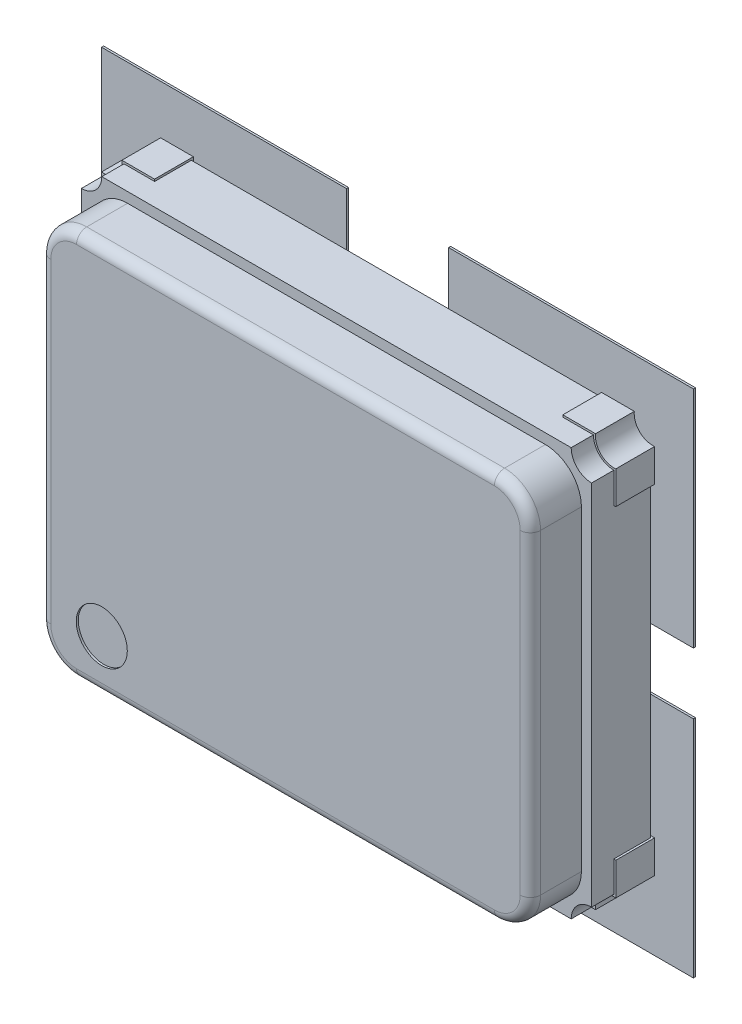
ISO-10303-21;
HEADER;
FILE_DESCRIPTION(('STEP AP214'),'2;1');
FILE_NAME('part.step','',(''),(''),'','','');
FILE_SCHEMA(('AUTOMOTIVE_DESIGN { 1 0 10303 214 1 1 1 1 }'));
ENDSEC;
DATA;
#1=APPLICATION_CONTEXT('core data for automotive mechanical design processes');
#2=APPLICATION_PROTOCOL_DEFINITION('international standard','automotive_design',2000,#1);
#3=PRODUCT_CONTEXT('',#1,'mechanical');
#4=PRODUCT('Part','Part','',(#3));
#5=PRODUCT_RELATED_PRODUCT_CATEGORY('part','',(#4));
#6=PRODUCT_DEFINITION_FORMATION('','',#4);
#7=PRODUCT_DEFINITION_CONTEXT('part definition',#1,'design');
#8=PRODUCT_DEFINITION('design','',#6,#7);
#9=PRODUCT_DEFINITION_SHAPE('','',#8);
#10=(LENGTH_UNIT() NAMED_UNIT(*) SI_UNIT(.MILLI.,.METRE.));
#11=(NAMED_UNIT(*) PLANE_ANGLE_UNIT() SI_UNIT($,.RADIAN.));
#12=(NAMED_UNIT(*) SI_UNIT($,.STERADIAN.) SOLID_ANGLE_UNIT());
#13=UNCERTAINTY_MEASURE_WITH_UNIT(LENGTH_MEASURE(1.E-05),#10,'distance_accuracy_value','');
#14=(GEOMETRIC_REPRESENTATION_CONTEXT(3) GLOBAL_UNCERTAINTY_ASSIGNED_CONTEXT((#13)) GLOBAL_UNIT_ASSIGNED_CONTEXT((#10,
#11,#12)) REPRESENTATION_CONTEXT('',''));
#15=CARTESIAN_POINT('',(0.,0.,0.));
#16=DIRECTION('',(0.,0.,1.));
#17=DIRECTION('',(1.,0.,0.));
#18=AXIS2_PLACEMENT_3D('',#15,#16,#17);
#19=CARTESIAN_POINT('',(0.,0.,0.0762));
#20=DIRECTION('',(0.,0.,1.));
#21=DIRECTION('',(1.,0.,0.));
#22=AXIS2_PLACEMENT_3D('',#19,#20,#21);
#23=PLANE('',#22);
#24=DIRECTION('',(1.,0.,0.));
#25=VECTOR('',#24,1.);
#26=CARTESIAN_POINT('',(-0.249999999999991,-0.15000000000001,0.0762));
#27=LINE('',#26,#25);
#28=CARTESIAN_POINT('',(-0.249999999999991,-0.15000000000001,0.0762));
#29=VERTEX_POINT('',#28);
#30=CARTESIAN_POINT('',(-1.45000000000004,-0.15000000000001,0.0762));
#31=VERTEX_POINT('',#30);
#32=EDGE_CURVE('E731',#29,#31,#27,.F.);
#33=ORIENTED_EDGE('',*,*,#32,.F.);
#34=DIRECTION('',(0.,1.,0.));
#35=VECTOR('',#34,1.);
#36=CARTESIAN_POINT('',(-0.249999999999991,-1.25000000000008,0.0762));
#37=LINE('',#36,#35);
#38=CARTESIAN_POINT('',(-0.249999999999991,-1.25000000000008,0.0762));
#39=VERTEX_POINT('',#38);
#40=EDGE_CURVE('E736',#39,#29,#37,.T.);
#41=ORIENTED_EDGE('',*,*,#40,.F.);
#42=DIRECTION('',(1.,0.,0.));
#43=VECTOR('',#42,1.);
#44=CARTESIAN_POINT('',(-1.45000000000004,-1.25000000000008,0.0762));
#45=LINE('',#44,#43);
#46=CARTESIAN_POINT('',(-1.45000000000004,-1.25000000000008,0.0762));
#47=VERTEX_POINT('',#46);
#48=EDGE_CURVE('E717',#47,#39,#45,.T.);
#49=ORIENTED_EDGE('',*,*,#48,.F.);
#50=DIRECTION('',(0.,1.,0.));
#51=VECTOR('',#50,1.);
#52=CARTESIAN_POINT('',(-1.45000000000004,-0.15000000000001,0.0762));
#53=LINE('',#52,#51);
#54=EDGE_CURVE('E726',#31,#47,#53,.F.);
#55=ORIENTED_EDGE('',*,*,#54,.F.);
#56=EDGE_LOOP('',(#33,#41,#49,#55));
#57=FACE_BOUND('',#56,.T.);
#58=ADVANCED_FACE('F16',(#57),#23,.F.);
#59=CARTESIAN_POINT('',(0.,0.,0.0762));
#60=DIRECTION('',(0.,0.,1.));
#61=DIRECTION('',(1.,0.,0.));
#62=AXIS2_PLACEMENT_3D('',#59,#60,#61);
#63=PLANE('',#62);
#64=DIRECTION('',(0.,1.,0.));
#65=VECTOR('',#64,1.);
#66=CARTESIAN_POINT('',(0.249999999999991,-0.399999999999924,0.0762));
#67=LINE('',#66,#65);
#68=CARTESIAN_POINT('',(0.250000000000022,-0.399999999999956,0.0762));
#69=VERTEX_POINT('',#68);
#70=CARTESIAN_POINT('',(0.249999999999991,-1.25000000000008,0.0762));
#71=VERTEX_POINT('',#70);
#72=EDGE_CURVE('E705',#69,#71,#67,.F.);
#73=ORIENTED_EDGE('',*,*,#72,.F.);
#74=DIRECTION('',(-0.707106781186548,-0.707106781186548,0.));
#75=VECTOR('',#74,1.);
#76=CARTESIAN_POINT('',(0.500000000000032,-0.15000000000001,0.0762));
#77=LINE('',#76,#75);
#78=CARTESIAN_POINT('',(0.500000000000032,-0.15000000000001,0.0762));
#79=VERTEX_POINT('',#78);
#80=EDGE_CURVE('E710',#79,#69,#77,.T.);
#81=ORIENTED_EDGE('',*,*,#80,.F.);
#82=DIRECTION('',(1.,0.,0.));
#83=VECTOR('',#82,1.);
#84=CARTESIAN_POINT('',(1.45000000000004,-0.15000000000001,0.0762));
#85=LINE('',#84,#83);
#86=CARTESIAN_POINT('',(1.45000000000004,-0.15000000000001,0.0762));
#87=VERTEX_POINT('',#86);
#88=EDGE_CURVE('E715',#87,#79,#85,.F.);
#89=ORIENTED_EDGE('',*,*,#88,.F.);
#90=DIRECTION('',(0.,1.,0.));
#91=VECTOR('',#90,1.);
#92=CARTESIAN_POINT('',(1.45000000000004,-1.25000000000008,0.0762));
#93=LINE('',#92,#91);
#94=CARTESIAN_POINT('',(1.45000000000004,-1.25000000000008,0.0762));
#95=VERTEX_POINT('',#94);
#96=EDGE_CURVE('E691',#95,#87,#93,.T.);
#97=ORIENTED_EDGE('',*,*,#96,.F.);
#98=DIRECTION('',(1.,0.,0.));
#99=VECTOR('',#98,1.);
#100=CARTESIAN_POINT('',(0.249999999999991,-1.25000000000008,0.0762));
#101=LINE('',#100,#99);
#102=EDGE_CURVE('E700',#71,#95,#101,.T.);
#103=ORIENTED_EDGE('',*,*,#102,.F.);
#104=EDGE_LOOP('',(#73,#81,#89,#97,#103));
#105=FACE_BOUND('',#104,.T.);
#106=ADVANCED_FACE('F1992',(#105),#63,.F.);
#107=CARTESIAN_POINT('',(0.,0.,0.0762));
#108=DIRECTION('',(0.,0.,1.));
#109=DIRECTION('',(1.,0.,0.));
#110=AXIS2_PLACEMENT_3D('',#107,#108,#109);
#111=PLANE('',#110);
#112=DIRECTION('',(1.,0.,0.));
#113=VECTOR('',#112,1.);
#114=CARTESIAN_POINT('',(-1.45000000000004,0.15000000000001,0.0762));
#115=LINE('',#114,#113);
#116=CARTESIAN_POINT('',(-1.45000000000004,0.15000000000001,0.0762));
#117=VERTEX_POINT('',#116);
#118=CARTESIAN_POINT('',(-0.249999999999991,0.15000000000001,0.0762));
#119=VERTEX_POINT('',#118);
#120=EDGE_CURVE('E684',#117,#119,#115,.T.);
#121=ORIENTED_EDGE('',*,*,#120,.F.);
#122=DIRECTION('',(0.,1.,0.));
#123=VECTOR('',#122,1.);
#124=CARTESIAN_POINT('',(-1.45000000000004,1.25000000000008,0.0762));
#125=LINE('',#124,#123);
#126=CARTESIAN_POINT('',(-1.45000000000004,1.25000000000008,0.0762));
#127=VERTEX_POINT('',#126);
#128=EDGE_CURVE('E689',#127,#117,#125,.F.);
#129=ORIENTED_EDGE('',*,*,#128,.F.);
#130=DIRECTION('',(1.,0.,0.));
#131=VECTOR('',#130,1.);
#132=CARTESIAN_POINT('',(-0.249999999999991,1.25000000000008,0.0762));
#133=LINE('',#132,#131);
#134=CARTESIAN_POINT('',(-0.249999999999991,1.25000000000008,0.0762));
#135=VERTEX_POINT('',#134);
#136=EDGE_CURVE('E670',#135,#127,#133,.F.);
#137=ORIENTED_EDGE('',*,*,#136,.F.);
#138=DIRECTION('',(0.,1.,0.));
#139=VECTOR('',#138,1.);
#140=CARTESIAN_POINT('',(-0.249999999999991,0.15000000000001,0.0762));
#141=LINE('',#140,#139);
#142=EDGE_CURVE('E679',#119,#135,#141,.T.);
#143=ORIENTED_EDGE('',*,*,#142,.F.);
#144=EDGE_LOOP('',(#121,#129,#137,#143));
#145=FACE_BOUND('',#144,.T.);
#146=ADVANCED_FACE('F1979',(#145),#111,.F.);
#147=CARTESIAN_POINT('',(0.,0.,0.0762));
#148=DIRECTION('',(0.,0.,1.));
#149=DIRECTION('',(1.,0.,0.));
#150=AXIS2_PLACEMENT_3D('',#147,#148,#149);
#151=PLANE('',#150);
#152=DIRECTION('',(1.,0.,0.));
#153=VECTOR('',#152,1.);
#154=CARTESIAN_POINT('',(0.249999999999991,0.15000000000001,0.0762));
#155=LINE('',#154,#153);
#156=CARTESIAN_POINT('',(0.249999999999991,0.15000000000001,0.0762));
#157=VERTEX_POINT('',#156);
#158=CARTESIAN_POINT('',(1.45000000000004,0.15000000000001,0.0762));
#159=VERTEX_POINT('',#158);
#160=EDGE_CURVE('E663',#157,#159,#155,.T.);
#161=ORIENTED_EDGE('',*,*,#160,.F.);
#162=DIRECTION('',(0.,1.,0.));
#163=VECTOR('',#162,1.);
#164=CARTESIAN_POINT('',(0.249999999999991,1.25000000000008,0.0762));
#165=LINE('',#164,#163);
#166=CARTESIAN_POINT('',(0.249999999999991,1.25000000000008,0.0762));
#167=VERTEX_POINT('',#166);
#168=EDGE_CURVE('E668',#167,#157,#165,.F.);
#169=ORIENTED_EDGE('',*,*,#168,.F.);
#170=DIRECTION('',(1.,0.,0.));
#171=VECTOR('',#170,1.);
#172=CARTESIAN_POINT('',(1.45000000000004,1.25000000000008,0.0762));
#173=LINE('',#172,#171);
#174=CARTESIAN_POINT('',(1.45000000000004,1.25000000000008,0.0762));
#175=VERTEX_POINT('',#174);
#176=EDGE_CURVE('E533',#175,#167,#173,.F.);
#177=ORIENTED_EDGE('',*,*,#176,.F.);
#178=DIRECTION('',(0.,1.,0.));
#179=VECTOR('',#178,1.);
#180=CARTESIAN_POINT('',(1.45000000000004,0.15000000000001,0.0762));
#181=LINE('',#180,#179);
#182=EDGE_CURVE('E658',#159,#175,#181,.T.);
#183=ORIENTED_EDGE('',*,*,#182,.F.);
#184=EDGE_LOOP('',(#161,#169,#177,#183));
#185=FACE_BOUND('',#184,.T.);
#186=ADVANCED_FACE('F1972',(#185),#151,.F.);
#187=CARTESIAN_POINT('',(-0.249999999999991,-1.25000000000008,0.0762));
#188=DIRECTION('',(1.,0.,0.));
#189=DIRECTION('',(0.,0.,-1.));
#190=AXIS2_PLACEMENT_3D('',#187,#188,#189);
#191=PLANE('',#190);
#192=DIRECTION('',(0.,0.,-1.));
#193=VECTOR('',#192,1.);
#194=CARTESIAN_POINT('',(-0.249999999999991,-1.25000000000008,0.0762));
#195=LINE('',#194,#193);
#196=CARTESIAN_POINT('',(-0.249999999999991,-1.25000000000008,0.0862000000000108));
#197=VERTEX_POINT('',#196);
#198=EDGE_CURVE('E723',#39,#197,#195,.F.);
#199=ORIENTED_EDGE('',*,*,#198,.F.);
#200=ORIENTED_EDGE('',*,*,#40,.T.);
#201=DIRECTION('',(0.,0.,1.));
#202=VECTOR('',#201,1.);
#203=CARTESIAN_POINT('',(-0.249999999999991,-0.15000000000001,0.0762));
#204=LINE('',#203,#202);
#205=CARTESIAN_POINT('',(-0.249999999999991,-0.15000000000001,0.0862000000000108));
#206=VERTEX_POINT('',#205);
#207=EDGE_CURVE('E733',#206,#29,#204,.F.);
#208=ORIENTED_EDGE('',*,*,#207,.F.);
#209=DIRECTION('',(0.,1.,0.));
#210=VECTOR('',#209,1.);
#211=CARTESIAN_POINT('',(-0.249999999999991,0.,0.0862000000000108));
#212=LINE('',#211,#210);
#213=EDGE_CURVE('E561',#197,#206,#212,.T.);
#214=ORIENTED_EDGE('',*,*,#213,.F.);
#215=EDGE_LOOP('',(#199,#200,#208,#214));
#216=FACE_BOUND('',#215,.T.);
#217=ADVANCED_FACE('F1978',(#216),#191,.T.);
#218=CARTESIAN_POINT('',(-0.249999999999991,-0.15000000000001,0.0762));
#219=DIRECTION('',(0.,1.,0.));
#220=DIRECTION('',(0.,0.,1.));
#221=AXIS2_PLACEMENT_3D('',#218,#219,#220);
#222=PLANE('',#221);
#223=ORIENTED_EDGE('',*,*,#207,.T.);
#224=ORIENTED_EDGE('',*,*,#32,.T.);
#225=DIRECTION('',(0.,0.,1.));
#226=VECTOR('',#225,1.);
#227=CARTESIAN_POINT('',(-1.45000000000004,-0.15000000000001,0.0762));
#228=LINE('',#227,#226);
#229=CARTESIAN_POINT('',(-1.45000000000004,-0.15000000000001,0.0862000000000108));
#230=VERTEX_POINT('',#229);
#231=EDGE_CURVE('E728',#230,#31,#228,.F.);
#232=ORIENTED_EDGE('',*,*,#231,.F.);
#233=DIRECTION('',(1.,0.,0.));
#234=VECTOR('',#233,1.);
#235=CARTESIAN_POINT('',(0.,-0.15000000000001,0.0862000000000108));
#236=LINE('',#235,#234);
#237=EDGE_CURVE('E555',#206,#230,#236,.F.);
#238=ORIENTED_EDGE('',*,*,#237,.F.);
#239=EDGE_LOOP('',(#223,#224,#232,#238));
#240=FACE_BOUND('',#239,.T.);
#241=ADVANCED_FACE('F2047',(#240),#222,.T.);
#242=CARTESIAN_POINT('',(-1.45000000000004,-0.15000000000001,0.0762));
#243=DIRECTION('',(-1.,0.,0.));
#244=DIRECTION('',(0.,0.,1.));
#245=AXIS2_PLACEMENT_3D('',#242,#243,#244);
#246=PLANE('',#245);
#247=ORIENTED_EDGE('',*,*,#231,.T.);
#248=ORIENTED_EDGE('',*,*,#54,.T.);
#249=DIRECTION('',(0.,0.,-1.));
#250=VECTOR('',#249,1.);
#251=CARTESIAN_POINT('',(-1.45000000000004,-1.25000000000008,0.0762));
#252=LINE('',#251,#250);
#253=CARTESIAN_POINT('',(-1.45000000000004,-1.25000000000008,0.0862000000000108));
#254=VERTEX_POINT('',#253);
#255=EDGE_CURVE('E720',#254,#47,#252,.T.);
#256=ORIENTED_EDGE('',*,*,#255,.F.);
#257=DIRECTION('',(0.,1.,0.));
#258=VECTOR('',#257,1.);
#259=CARTESIAN_POINT('',(-1.45000000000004,0.,0.0862000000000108));
#260=LINE('',#259,#258);
#261=EDGE_CURVE('E550',#230,#254,#260,.F.);
#262=ORIENTED_EDGE('',*,*,#261,.F.);
#263=EDGE_LOOP('',(#247,#248,#256,#262));
#264=FACE_BOUND('',#263,.T.);
#265=ADVANCED_FACE('F2054',(#264),#246,.T.);
#266=CARTESIAN_POINT('',(-1.45000000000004,-1.25000000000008,0.0762));
#267=DIRECTION('',(0.,-1.,0.));
#268=DIRECTION('',(0.,0.,-1.));
#269=AXIS2_PLACEMENT_3D('',#266,#267,#268);
#270=PLANE('',#269);
#271=ORIENTED_EDGE('',*,*,#255,.T.);
#272=ORIENTED_EDGE('',*,*,#48,.T.);
#273=ORIENTED_EDGE('',*,*,#198,.T.);
#274=DIRECTION('',(1.,0.,0.));
#275=VECTOR('',#274,1.);
#276=CARTESIAN_POINT('',(0.,-1.25000000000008,0.0862000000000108));
#277=LINE('',#276,#275);
#278=EDGE_CURVE('E548',#254,#197,#277,.T.);
#279=ORIENTED_EDGE('',*,*,#278,.F.);
#280=EDGE_LOOP('',(#271,#272,#273,#279));
#281=FACE_BOUND('',#280,.T.);
#282=ADVANCED_FACE('F2062',(#281),#270,.T.);
#283=CARTESIAN_POINT('',(1.45000000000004,-0.15000000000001,0.0762));
#284=DIRECTION('',(0.,1.,0.));
#285=DIRECTION('',(0.,0.,1.));
#286=AXIS2_PLACEMENT_3D('',#283,#284,#285);
#287=PLANE('',#286);
#288=DIRECTION('',(0.,0.,-1.));
#289=VECTOR('',#288,1.);
#290=CARTESIAN_POINT('',(1.45000000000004,-0.15000000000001,0.0762));
#291=LINE('',#290,#289);
#292=CARTESIAN_POINT('',(1.45000000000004,-0.15000000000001,0.0862000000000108));
#293=VERTEX_POINT('',#292);
#294=EDGE_CURVE('E697',#87,#293,#291,.F.);
#295=ORIENTED_EDGE('',*,*,#294,.F.);
#296=ORIENTED_EDGE('',*,*,#88,.T.);
#297=DIRECTION('',(0.,0.,1.));
#298=VECTOR('',#297,1.);
#299=CARTESIAN_POINT('',(0.500000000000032,-0.15000000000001,0.0762));
#300=LINE('',#299,#298);
#301=CARTESIAN_POINT('',(0.500000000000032,-0.15000000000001,0.0862000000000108));
#302=VERTEX_POINT('',#301);
#303=EDGE_CURVE('E712',#302,#79,#300,.F.);
#304=ORIENTED_EDGE('',*,*,#303,.F.);
#305=DIRECTION('',(1.,0.,0.));
#306=VECTOR('',#305,1.);
#307=CARTESIAN_POINT('',(0.,-0.15000000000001,0.0862000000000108));
#308=LINE('',#307,#306);
#309=EDGE_CURVE('E933',#293,#302,#308,.F.);
#310=ORIENTED_EDGE('',*,*,#309,.F.);
#311=EDGE_LOOP('',(#295,#296,#304,#310));
#312=FACE_BOUND('',#311,.T.);
#313=ADVANCED_FACE('F2070',(#312),#287,.T.);
#314=CARTESIAN_POINT('',(0.500000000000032,-0.15000000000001,0.0762));
#315=DIRECTION('',(-0.707106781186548,0.707106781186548,0.));
#316=DIRECTION('',(-0.707106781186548,-0.707106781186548,0.));
#317=AXIS2_PLACEMENT_3D('',#314,#315,#316);
#318=PLANE('',#317);
#319=ORIENTED_EDGE('',*,*,#303,.T.);
#320=ORIENTED_EDGE('',*,*,#80,.T.);
#321=DIRECTION('',(0.,0.,1.));
#322=VECTOR('',#321,1.);
#323=CARTESIAN_POINT('',(0.249999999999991,-0.399999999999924,0.0762));
#324=LINE('',#323,#322);
#325=CARTESIAN_POINT('',(0.250000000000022,-0.399999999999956,0.0862000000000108));
#326=VERTEX_POINT('',#325);
#327=EDGE_CURVE('E707',#326,#69,#324,.F.);
#328=ORIENTED_EDGE('',*,*,#327,.F.);
#329=DIRECTION('',(-0.707106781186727,-0.707106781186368,0.));
#330=VECTOR('',#329,1.);
#331=CARTESIAN_POINT('',(0.500000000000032,-0.15000000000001,0.0862000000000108));
#332=LINE('',#331,#330);
#333=EDGE_CURVE('E930',#302,#326,#332,.T.);
#334=ORIENTED_EDGE('',*,*,#333,.F.);
#335=EDGE_LOOP('',(#319,#320,#328,#334));
#336=FACE_BOUND('',#335,.T.);
#337=ADVANCED_FACE('F2078',(#336),#318,.T.);
#338=CARTESIAN_POINT('',(0.249999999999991,-0.399999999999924,0.0762));
#339=DIRECTION('',(-1.,0.,0.));
#340=DIRECTION('',(0.,0.,1.));
#341=AXIS2_PLACEMENT_3D('',#338,#339,#340);
#342=PLANE('',#341);
#343=ORIENTED_EDGE('',*,*,#327,.T.);
#344=ORIENTED_EDGE('',*,*,#72,.T.);
#345=DIRECTION('',(0.,0.,-1.));
#346=VECTOR('',#345,1.);
#347=CARTESIAN_POINT('',(0.249999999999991,-1.25000000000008,0.0762));
#348=LINE('',#347,#346);
#349=CARTESIAN_POINT('',(0.249999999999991,-1.25000000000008,0.0862000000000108));
#350=VERTEX_POINT('',#349);
#351=EDGE_CURVE('E702',#350,#71,#348,.T.);
#352=ORIENTED_EDGE('',*,*,#351,.F.);
#353=DIRECTION('',(0.,1.,0.));
#354=VECTOR('',#353,1.);
#355=CARTESIAN_POINT('',(0.249999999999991,0.,0.0862000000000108));
#356=LINE('',#355,#354);
#357=EDGE_CURVE('E927',#326,#350,#356,.F.);
#358=ORIENTED_EDGE('',*,*,#357,.F.);
#359=EDGE_LOOP('',(#343,#344,#352,#358));
#360=FACE_BOUND('',#359,.T.);
#361=ADVANCED_FACE('F2086',(#360),#342,.T.);
#362=CARTESIAN_POINT('',(0.249999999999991,-1.25000000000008,0.0762));
#363=DIRECTION('',(0.,-1.,0.));
#364=DIRECTION('',(0.,0.,-1.));
#365=AXIS2_PLACEMENT_3D('',#362,#363,#364);
#366=PLANE('',#365);
#367=ORIENTED_EDGE('',*,*,#351,.T.);
#368=ORIENTED_EDGE('',*,*,#102,.T.);
#369=DIRECTION('',(0.,0.,-1.));
#370=VECTOR('',#369,1.);
#371=CARTESIAN_POINT('',(1.45000000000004,-1.25000000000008,0.0762));
#372=LINE('',#371,#370);
#373=CARTESIAN_POINT('',(1.45000000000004,-1.25000000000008,0.0862000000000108));
#374=VERTEX_POINT('',#373);
#375=EDGE_CURVE('E694',#374,#95,#372,.T.);
#376=ORIENTED_EDGE('',*,*,#375,.F.);
#377=DIRECTION('',(1.,0.,0.));
#378=VECTOR('',#377,1.);
#379=CARTESIAN_POINT('',(0.,-1.25000000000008,0.0862000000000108));
#380=LINE('',#379,#378);
#381=EDGE_CURVE('E921',#350,#374,#380,.T.);
#382=ORIENTED_EDGE('',*,*,#381,.F.);
#383=EDGE_LOOP('',(#367,#368,#376,#382));
#384=FACE_BOUND('',#383,.T.);
#385=ADVANCED_FACE('F2094',(#384),#366,.T.);
#386=CARTESIAN_POINT('',(1.45000000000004,-1.25000000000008,0.0762));
#387=DIRECTION('',(1.,0.,0.));
#388=DIRECTION('',(0.,0.,-1.));
#389=AXIS2_PLACEMENT_3D('',#386,#387,#388);
#390=PLANE('',#389);
#391=ORIENTED_EDGE('',*,*,#375,.T.);
#392=ORIENTED_EDGE('',*,*,#96,.T.);
#393=ORIENTED_EDGE('',*,*,#294,.T.);
#394=DIRECTION('',(0.,1.,0.));
#395=VECTOR('',#394,1.);
#396=CARTESIAN_POINT('',(1.45000000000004,0.,0.0862000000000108));
#397=LINE('',#396,#395);
#398=EDGE_CURVE('E917',#374,#293,#397,.T.);
#399=ORIENTED_EDGE('',*,*,#398,.F.);
#400=EDGE_LOOP('',(#391,#392,#393,#399));
#401=FACE_BOUND('',#400,.T.);
#402=ADVANCED_FACE('F2102',(#401),#390,.T.);
#403=CARTESIAN_POINT('',(-1.45000000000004,1.25000000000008,0.0762));
#404=DIRECTION('',(-1.,0.,0.));
#405=DIRECTION('',(0.,0.,1.));
#406=AXIS2_PLACEMENT_3D('',#403,#404,#405);
#407=PLANE('',#406);
#408=DIRECTION('',(0.,0.,1.));
#409=VECTOR('',#408,1.);
#410=CARTESIAN_POINT('',(-1.45000000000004,1.25000000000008,0.0762));
#411=LINE('',#410,#409);
#412=CARTESIAN_POINT('',(-1.45000000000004,1.25000000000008,0.0862000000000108));
#413=VERTEX_POINT('',#412);
#414=EDGE_CURVE('E676',#127,#413,#411,.T.);
#415=ORIENTED_EDGE('',*,*,#414,.F.);
#416=ORIENTED_EDGE('',*,*,#128,.T.);
#417=DIRECTION('',(0.,0.,-1.));
#418=VECTOR('',#417,1.);
#419=CARTESIAN_POINT('',(-1.45000000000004,0.15000000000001,0.0762));
#420=LINE('',#419,#418);
#421=CARTESIAN_POINT('',(-1.45000000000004,0.15000000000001,0.0862000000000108));
#422=VERTEX_POINT('',#421);
#423=EDGE_CURVE('E686',#422,#117,#420,.T.);
#424=ORIENTED_EDGE('',*,*,#423,.F.);
#425=DIRECTION('',(0.,1.,0.));
#426=VECTOR('',#425,1.);
#427=CARTESIAN_POINT('',(-1.45000000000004,0.,0.0862000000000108));
#428=LINE('',#427,#426);
#429=EDGE_CURVE('E915',#413,#422,#428,.F.);
#430=ORIENTED_EDGE('',*,*,#429,.F.);
#431=EDGE_LOOP('',(#415,#416,#424,#430));
#432=FACE_BOUND('',#431,.T.);
#433=ADVANCED_FACE('F2110',(#432),#407,.T.);
#434=CARTESIAN_POINT('',(-1.45000000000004,0.15000000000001,0.0762));
#435=DIRECTION('',(0.,-1.,0.));
#436=DIRECTION('',(0.,0.,-1.));
#437=AXIS2_PLACEMENT_3D('',#434,#435,#436);
#438=PLANE('',#437);
#439=ORIENTED_EDGE('',*,*,#423,.T.);
#440=ORIENTED_EDGE('',*,*,#120,.T.);
#441=DIRECTION('',(0.,0.,-1.));
#442=VECTOR('',#441,1.);
#443=CARTESIAN_POINT('',(-0.249999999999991,0.15000000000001,0.0762));
#444=LINE('',#443,#442);
#445=CARTESIAN_POINT('',(-0.249999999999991,0.15000000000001,0.0862000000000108));
#446=VERTEX_POINT('',#445);
#447=EDGE_CURVE('E681',#446,#119,#444,.T.);
#448=ORIENTED_EDGE('',*,*,#447,.F.);
#449=DIRECTION('',(1.,0.,0.));
#450=VECTOR('',#449,1.);
#451=CARTESIAN_POINT('',(0.,0.15000000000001,0.0862000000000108));
#452=LINE('',#451,#450);
#453=EDGE_CURVE('E997',#422,#446,#452,.T.);
#454=ORIENTED_EDGE('',*,*,#453,.F.);
#455=EDGE_LOOP('',(#439,#440,#448,#454));
#456=FACE_BOUND('',#455,.T.);
#457=ADVANCED_FACE('F2118',(#456),#438,.T.);
#458=CARTESIAN_POINT('',(-0.249999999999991,0.15000000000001,0.0762));
#459=DIRECTION('',(1.,0.,0.));
#460=DIRECTION('',(0.,0.,-1.));
#461=AXIS2_PLACEMENT_3D('',#458,#459,#460);
#462=PLANE('',#461);
#463=ORIENTED_EDGE('',*,*,#447,.T.);
#464=ORIENTED_EDGE('',*,*,#142,.T.);
#465=DIRECTION('',(0.,0.,1.));
#466=VECTOR('',#465,1.);
#467=CARTESIAN_POINT('',(-0.249999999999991,1.25000000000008,0.0762));
#468=LINE('',#467,#466);
#469=CARTESIAN_POINT('',(-0.249999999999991,1.25000000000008,0.0862000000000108));
#470=VERTEX_POINT('',#469);
#471=EDGE_CURVE('E673',#470,#135,#468,.F.);
#472=ORIENTED_EDGE('',*,*,#471,.F.);
#473=DIRECTION('',(0.,1.,0.));
#474=VECTOR('',#473,1.);
#475=CARTESIAN_POINT('',(-0.249999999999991,0.,0.0862000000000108));
#476=LINE('',#475,#474);
#477=EDGE_CURVE('E994',#446,#470,#476,.T.);
#478=ORIENTED_EDGE('',*,*,#477,.F.);
#479=EDGE_LOOP('',(#463,#464,#472,#478));
#480=FACE_BOUND('',#479,.T.);
#481=ADVANCED_FACE('F2126',(#480),#462,.T.);
#482=CARTESIAN_POINT('',(-0.249999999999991,1.25000000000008,0.0762));
#483=DIRECTION('',(0.,1.,0.));
#484=DIRECTION('',(0.,0.,1.));
#485=AXIS2_PLACEMENT_3D('',#482,#483,#484);
#486=PLANE('',#485);
#487=ORIENTED_EDGE('',*,*,#471,.T.);
#488=ORIENTED_EDGE('',*,*,#136,.T.);
#489=ORIENTED_EDGE('',*,*,#414,.T.);
#490=DIRECTION('',(1.,0.,0.));
#491=VECTOR('',#490,1.);
#492=CARTESIAN_POINT('',(0.,1.25000000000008,0.0862000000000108));
#493=LINE('',#492,#491);
#494=EDGE_CURVE('E990',#470,#413,#493,.F.);
#495=ORIENTED_EDGE('',*,*,#494,.F.);
#496=EDGE_LOOP('',(#487,#488,#489,#495));
#497=FACE_BOUND('',#496,.T.);
#498=ADVANCED_FACE('F2134',(#497),#486,.T.);
#499=CARTESIAN_POINT('',(0.249999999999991,1.25000000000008,0.0762));
#500=DIRECTION('',(-1.,0.,0.));
#501=DIRECTION('',(0.,0.,1.));
#502=AXIS2_PLACEMENT_3D('',#499,#500,#501);
#503=PLANE('',#502);
#504=DIRECTION('',(0.,0.,1.));
#505=VECTOR('',#504,1.);
#506=CARTESIAN_POINT('',(0.249999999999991,1.25000000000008,0.0762));
#507=LINE('',#506,#505);
#508=CARTESIAN_POINT('',(0.249999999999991,1.25000000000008,0.0862000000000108));
#509=VERTEX_POINT('',#508);
#510=EDGE_CURVE('E655',#167,#509,#507,.T.);
#511=ORIENTED_EDGE('',*,*,#510,.F.);
#512=ORIENTED_EDGE('',*,*,#168,.T.);
#513=DIRECTION('',(0.,0.,-1.));
#514=VECTOR('',#513,1.);
#515=CARTESIAN_POINT('',(0.249999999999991,0.15000000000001,0.0762));
#516=LINE('',#515,#514);
#517=CARTESIAN_POINT('',(0.249999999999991,0.15000000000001,0.0862000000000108));
#518=VERTEX_POINT('',#517);
#519=EDGE_CURVE('E665',#518,#157,#516,.T.);
#520=ORIENTED_EDGE('',*,*,#519,.F.);
#521=DIRECTION('',(0.,1.,0.));
#522=VECTOR('',#521,1.);
#523=CARTESIAN_POINT('',(0.249999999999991,0.,0.0862000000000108));
#524=LINE('',#523,#522);
#525=EDGE_CURVE('E974',#509,#518,#524,.F.);
#526=ORIENTED_EDGE('',*,*,#525,.F.);
#527=EDGE_LOOP('',(#511,#512,#520,#526));
#528=FACE_BOUND('',#527,.T.);
#529=ADVANCED_FACE('F2142',(#528),#503,.T.);
#530=CARTESIAN_POINT('',(0.249999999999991,0.15000000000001,0.0762));
#531=DIRECTION('',(0.,-1.,0.));
#532=DIRECTION('',(0.,0.,-1.));
#533=AXIS2_PLACEMENT_3D('',#530,#531,#532);
#534=PLANE('',#533);
#535=ORIENTED_EDGE('',*,*,#519,.T.);
#536=ORIENTED_EDGE('',*,*,#160,.T.);
#537=DIRECTION('',(0.,0.,-1.));
#538=VECTOR('',#537,1.);
#539=CARTESIAN_POINT('',(1.45000000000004,0.15000000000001,0.0762));
#540=LINE('',#539,#538);
#541=CARTESIAN_POINT('',(1.45000000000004,0.15000000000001,0.0862000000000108));
#542=VERTEX_POINT('',#541);
#543=EDGE_CURVE('E660',#542,#159,#540,.T.);
#544=ORIENTED_EDGE('',*,*,#543,.F.);
#545=DIRECTION('',(1.,0.,0.));
#546=VECTOR('',#545,1.);
#547=CARTESIAN_POINT('',(0.,0.15000000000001,0.0862000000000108));
#548=LINE('',#547,#546);
#549=EDGE_CURVE('E971',#518,#542,#548,.T.);
#550=ORIENTED_EDGE('',*,*,#549,.F.);
#551=EDGE_LOOP('',(#535,#536,#544,#550));
#552=FACE_BOUND('',#551,.T.);
#553=ADVANCED_FACE('F2150',(#552),#534,.T.);
#554=CARTESIAN_POINT('',(1.45000000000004,0.15000000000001,0.0762));
#555=DIRECTION('',(1.,0.,0.));
#556=DIRECTION('',(0.,0.,-1.));
#557=AXIS2_PLACEMENT_3D('',#554,#555,#556);
#558=PLANE('',#557);
#559=ORIENTED_EDGE('',*,*,#543,.T.);
#560=ORIENTED_EDGE('',*,*,#182,.T.);
#561=DIRECTION('',(0.,0.,1.));
#562=VECTOR('',#561,1.);
#563=CARTESIAN_POINT('',(1.45000000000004,1.25000000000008,0.0762));
#564=LINE('',#563,#562);
#565=CARTESIAN_POINT('',(1.45000000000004,1.25000000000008,0.0862000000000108));
#566=VERTEX_POINT('',#565);
#567=EDGE_CURVE('E652',#566,#175,#564,.F.);
#568=ORIENTED_EDGE('',*,*,#567,.F.);
#569=DIRECTION('',(0.,1.,0.));
#570=VECTOR('',#569,1.);
#571=CARTESIAN_POINT('',(1.45000000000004,0.,0.0862000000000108));
#572=LINE('',#571,#570);
#573=EDGE_CURVE('E968',#542,#566,#572,.T.);
#574=ORIENTED_EDGE('',*,*,#573,.F.);
#575=EDGE_LOOP('',(#559,#560,#568,#574));
#576=FACE_BOUND('',#575,.T.);
#577=ADVANCED_FACE('F2158',(#576),#558,.T.);
#578=CARTESIAN_POINT('',(1.45000000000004,1.25000000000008,0.0762));
#579=DIRECTION('',(0.,1.,0.));
#580=DIRECTION('',(0.,0.,1.));
#581=AXIS2_PLACEMENT_3D('',#578,#579,#580);
#582=PLANE('',#581);
#583=ORIENTED_EDGE('',*,*,#567,.T.);
#584=ORIENTED_EDGE('',*,*,#176,.T.);
#585=ORIENTED_EDGE('',*,*,#510,.T.);
#586=DIRECTION('',(1.,0.,0.));
#587=VECTOR('',#586,1.);
#588=CARTESIAN_POINT('',(0.,1.25000000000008,0.0862000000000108));
#589=LINE('',#588,#587);
#590=EDGE_CURVE('E906',#566,#509,#589,.F.);
#591=ORIENTED_EDGE('',*,*,#590,.F.);
#592=EDGE_LOOP('',(#583,#584,#585,#591));
#593=FACE_BOUND('',#592,.T.);
#594=ADVANCED_FACE('F2166',(#593),#582,.T.);
#595=CARTESIAN_POINT('',(-1.26000000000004,-0.750200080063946,0.0762));
#596=DIRECTION('',(-1.,0.,0.));
#597=DIRECTION('',(0.,0.,1.));
#598=AXIS2_PLACEMENT_3D('',#595,#596,#597);
#599=PLANE('',#598);
#600=DIRECTION('',(0.,0.,1.));
#601=VECTOR('',#600,1.);
#602=CARTESIAN_POINT('',(-1.26000000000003,-0.750200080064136,0.0762));
#603=LINE('',#602,#601);
#604=CARTESIAN_POINT('',(-1.26000000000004,-0.750200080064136,0.0862000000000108));
#605=VERTEX_POINT('',#604);
#606=CARTESIAN_POINT('',(-1.26000000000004,-0.750200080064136,0.276199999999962));
#607=VERTEX_POINT('',#606);
#608=EDGE_CURVE('E538',#605,#607,#603,.T.);
#609=ORIENTED_EDGE('',*,*,#608,.F.);
#610=DIRECTION('',(0.,1.,0.));
#611=VECTOR('',#610,1.);
#612=CARTESIAN_POINT('',(-1.26000000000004,0.,0.0862000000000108));
#613=LINE('',#612,#611);
#614=CARTESIAN_POINT('',(-1.26000000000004,-0.910557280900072,0.0862000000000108));
#615=VERTEX_POINT('',#614);
#616=EDGE_CURVE('E536',#615,#605,#613,.T.);
#617=ORIENTED_EDGE('',*,*,#616,.F.);
#618=DIRECTION('',(0.,0.,1.));
#619=VECTOR('',#618,1.);
#620=CARTESIAN_POINT('',(-1.26000000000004,-0.910557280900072,0.0762));
#621=LINE('',#620,#619);
#622=CARTESIAN_POINT('',(-1.26000000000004,-0.910557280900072,0.276199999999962));
#623=VERTEX_POINT('',#622);
#624=EDGE_CURVE('E524',#615,#623,#621,.T.);
#625=ORIENTED_EDGE('',*,*,#624,.T.);
#626=DIRECTION('',(0.,1.,0.));
#627=VECTOR('',#626,1.);
#628=CARTESIAN_POINT('',(-1.26000000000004,0.,0.276199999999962));
#629=LINE('',#628,#627);
#630=EDGE_CURVE('E883',#607,#623,#629,.F.);
#631=ORIENTED_EDGE('',*,*,#630,.F.);
#632=EDGE_LOOP('',(#609,#617,#625,#631));
#633=FACE_BOUND('',#632,.T.);
#634=ADVANCED_FACE('F537',(#633),#599,.T.);
#635=CARTESIAN_POINT('',(-1.25000000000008,-1.00000000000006,0.0762));
#636=DIRECTION('',(0.,0.,1.));
#637=DIRECTION('',(1.,0.,0.));
#638=AXIS2_PLACEMENT_3D('',#635,#636,#637);
#639=CYLINDRICAL_SURFACE('',#638,0.0899999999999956);
#640=CARTESIAN_POINT('',(-1.25000000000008,-1.00000000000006,0.276199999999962));
#641=DIRECTION('',(0.,0.,1.));
#642=DIRECTION('',(1.,0.,0.));
#643=AXIS2_PLACEMENT_3D('',#640,#641,#642);
#644=CIRCLE('',#643,0.0899999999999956);
#645=CARTESIAN_POINT('',(-1.16055728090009,-1.01000000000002,0.276199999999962));
#646=VERTEX_POINT('',#645);
#647=EDGE_CURVE('E528',#623,#646,#644,.F.);
#648=ORIENTED_EDGE('',*,*,#647,.F.);
#649=ORIENTED_EDGE('',*,*,#624,.F.);
#650=CARTESIAN_POINT('',(-1.25000000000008,-1.00000000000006,0.0862000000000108));
#651=DIRECTION('',(0.,0.,1.));
#652=DIRECTION('',(1.,0.,0.));
#653=AXIS2_PLACEMENT_3D('',#650,#651,#652);
#654=CIRCLE('',#653,0.0899999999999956);
#655=CARTESIAN_POINT('',(-1.16055728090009,-1.01000000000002,0.0862000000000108));
#656=VERTEX_POINT('',#655);
#657=EDGE_CURVE('E19',#656,#615,#654,.T.);
#658=ORIENTED_EDGE('',*,*,#657,.F.);
#659=DIRECTION('',(0.,0.,-1.));
#660=VECTOR('',#659,1.);
#661=CARTESIAN_POINT('',(-1.1605572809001,-1.01000000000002,0.0762));
#662=LINE('',#661,#660);
#663=EDGE_CURVE('E532',#646,#656,#662,.T.);
#664=ORIENTED_EDGE('',*,*,#663,.F.);
#665=EDGE_LOOP('',(#648,#649,#658,#664));
#666=FACE_BOUND('',#665,.T.);
#667=ADVANCED_FACE('F526',(#666),#639,.F.);
#668=CARTESIAN_POINT('',(-1.1605572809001,-1.01000000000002,0.0762));
#669=DIRECTION('',(0.,-1.,0.));
#670=DIRECTION('',(0.,0.,-1.));
#671=AXIS2_PLACEMENT_3D('',#668,#669,#670);
#672=PLANE('',#671);
#673=ORIENTED_EDGE('',*,*,#663,.T.);
#674=DIRECTION('',(1.,0.,0.));
#675=VECTOR('',#674,1.);
#676=CARTESIAN_POINT('',(0.,-1.01000000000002,0.0862000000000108));
#677=LINE('',#676,#675);
#678=CARTESIAN_POINT('',(-1.00020008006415,-1.01000000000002,0.0862000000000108));
#679=VERTEX_POINT('',#678);
#680=EDGE_CURVE('E542',#679,#656,#677,.F.);
#681=ORIENTED_EDGE('',*,*,#680,.F.);
#682=DIRECTION('',(0.,0.,1.));
#683=VECTOR('',#682,1.);
#684=CARTESIAN_POINT('',(-1.00020008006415,-1.01000000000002,0.0762));
#685=LINE('',#684,#683);
#686=CARTESIAN_POINT('',(-1.00020008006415,-1.01000000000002,0.276199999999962));
#687=VERTEX_POINT('',#686);
#688=EDGE_CURVE('E563',#687,#679,#685,.F.);
#689=ORIENTED_EDGE('',*,*,#688,.F.);
#690=DIRECTION('',(1.,0.,0.));
#691=VECTOR('',#690,1.);
#692=CARTESIAN_POINT('',(0.,-1.01000000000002,0.276199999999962));
#693=LINE('',#692,#691);
#694=EDGE_CURVE('E882',#646,#687,#693,.T.);
#695=ORIENTED_EDGE('',*,*,#694,.F.);
#696=EDGE_LOOP('',(#673,#681,#689,#695));
#697=FACE_BOUND('',#696,.T.);
#698=ADVANCED_FACE('F1963',(#697),#672,.T.);
#699=CARTESIAN_POINT('',(0.,0.,0.0862000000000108));
#700=DIRECTION('',(0.,0.,1.));
#701=DIRECTION('',(1.,0.,0.));
#702=AXIS2_PLACEMENT_3D('',#699,#700,#701);
#703=PLANE('',#702);
#704=CARTESIAN_POINT('',(-1.25000000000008,-1.00000000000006,0.0862000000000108));
#705=DIRECTION('',(0.,0.,1.));
#706=DIRECTION('',(1.,0.,0.));
#707=AXIS2_PLACEMENT_3D('',#704,#705,#706);
#708=CIRCLE('',#707,0.249999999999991);
#709=CARTESIAN_POINT('',(-1.07560711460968,-0.820871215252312,0.0862000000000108));
#710=VERTEX_POINT('',#709);
#711=EDGE_CURVE('E566',#679,#710,#708,.T.);
#712=ORIENTED_EDGE('',*,*,#711,.F.);
#713=ORIENTED_EDGE('',*,*,#680,.T.);
#714=ORIENTED_EDGE('',*,*,#657,.T.);
#715=ORIENTED_EDGE('',*,*,#616,.T.);
#716=CARTESIAN_POINT('',(-1.25000000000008,-1.00000000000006,0.0862000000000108));
#717=DIRECTION('',(0.,0.,1.));
#718=DIRECTION('',(1.,0.,0.));
#719=AXIS2_PLACEMENT_3D('',#716,#717,#718);
#720=CIRCLE('',#719,0.249999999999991);
#721=CARTESIAN_POINT('',(-1.15,-0.770871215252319,0.0862000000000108));
#722=VERTEX_POINT('',#721);
#723=EDGE_CURVE('E896',#722,#605,#720,.T.);
#724=ORIENTED_EDGE('',*,*,#723,.F.);
#725=DIRECTION('',(0.,1.,0.));
#726=VECTOR('',#725,1.);
#727=CARTESIAN_POINT('',(-1.14999999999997,-0.170871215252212,0.0862000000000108));
#728=LINE('',#727,#726);
#729=CARTESIAN_POINT('',(-1.14999999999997,-0.170871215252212,0.0862000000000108));
#730=VERTEX_POINT('',#729);
#731=EDGE_CURVE('E588',#730,#722,#728,.F.);
#732=ORIENTED_EDGE('',*,*,#731,.F.);
#733=DIRECTION('',(1.,0.,0.));
#734=VECTOR('',#733,1.);
#735=CARTESIAN_POINT('',(-0.350000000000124,-0.170871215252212,0.0862000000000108));
#736=LINE('',#735,#734);
#737=CARTESIAN_POINT('',(-0.350000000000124,-0.170871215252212,0.0862000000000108));
#738=VERTEX_POINT('',#737);
#739=EDGE_CURVE('E620',#738,#730,#736,.F.);
#740=ORIENTED_EDGE('',*,*,#739,.F.);
#741=DIRECTION('',(0.,1.,0.));
#742=VECTOR('',#741,1.);
#743=CARTESIAN_POINT('',(-0.350000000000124,-0.820871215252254,0.0862000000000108));
#744=LINE('',#743,#742);
#745=CARTESIAN_POINT('',(-0.350000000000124,-0.820871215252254,0.0862000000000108));
#746=VERTEX_POINT('',#745);
#747=EDGE_CURVE('E614',#746,#738,#744,.T.);
#748=ORIENTED_EDGE('',*,*,#747,.F.);
#749=DIRECTION('',(1.,0.,0.));
#750=VECTOR('',#749,1.);
#751=CARTESIAN_POINT('',(-1.07560711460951,-0.820871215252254,0.0862000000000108));
#752=LINE('',#751,#750);
#753=EDGE_CURVE('E568',#710,#746,#752,.T.);
#754=ORIENTED_EDGE('',*,*,#753,.F.);
#755=EDGE_LOOP('',(#712,#713,#714,#715,#724,#732,#740,#748,#754));
#756=FACE_BOUND('',#755,.T.);
#757=ORIENTED_EDGE('',*,*,#261,.T.);
#758=ORIENTED_EDGE('',*,*,#278,.T.);
#759=ORIENTED_EDGE('',*,*,#213,.T.);
#760=ORIENTED_EDGE('',*,*,#237,.T.);
#761=EDGE_LOOP('',(#757,#758,#759,#760));
#762=FACE_BOUND('',#761,.T.);
#763=ADVANCED_FACE('F546',(#756,#762),#703,.T.);
#764=CARTESIAN_POINT('',(1.00020008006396,-1.01000000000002,0.0762));
#765=DIRECTION('',(0.,-1.,0.));
#766=DIRECTION('',(0.,0.,-1.));
#767=AXIS2_PLACEMENT_3D('',#764,#765,#766);
#768=PLANE('',#767);
#769=DIRECTION('',(0.,0.,1.));
#770=VECTOR('',#769,1.);
#771=CARTESIAN_POINT('',(1.00020008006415,-1.01000000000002,0.0762));
#772=LINE('',#771,#770);
#773=CARTESIAN_POINT('',(1.00020008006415,-1.01000000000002,0.0862000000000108));
#774=VERTEX_POINT('',#773);
#775=CARTESIAN_POINT('',(1.00020008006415,-1.01000000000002,0.276199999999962));
#776=VERTEX_POINT('',#775);
#777=EDGE_CURVE('E894',#774,#776,#772,.T.);
#778=ORIENTED_EDGE('',*,*,#777,.F.);
#779=DIRECTION('',(1.,0.,0.));
#780=VECTOR('',#779,1.);
#781=CARTESIAN_POINT('',(0.,-1.01000000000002,0.0862000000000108));
#782=LINE('',#781,#780);
#783=CARTESIAN_POINT('',(1.16055728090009,-1.01000000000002,0.0862000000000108));
#784=VERTEX_POINT('',#783);
#785=EDGE_CURVE('E909',#784,#774,#782,.F.);
#786=ORIENTED_EDGE('',*,*,#785,.F.);
#787=DIRECTION('',(0.,0.,1.));
#788=VECTOR('',#787,1.);
#789=CARTESIAN_POINT('',(1.16055728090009,-1.01000000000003,0.0762));
#790=LINE('',#789,#788);
#791=CARTESIAN_POINT('',(1.16055728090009,-1.01000000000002,0.276199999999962));
#792=VERTEX_POINT('',#791);
#793=EDGE_CURVE('E945',#784,#792,#790,.T.);
#794=ORIENTED_EDGE('',*,*,#793,.T.);
#795=DIRECTION('',(1.,0.,0.));
#796=VECTOR('',#795,1.);
#797=CARTESIAN_POINT('',(0.,-1.01000000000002,0.276199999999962));
#798=LINE('',#797,#796);
#799=EDGE_CURVE('E867',#776,#792,#798,.T.);
#800=ORIENTED_EDGE('',*,*,#799,.F.);
#801=EDGE_LOOP('',(#778,#786,#794,#800));
#802=FACE_BOUND('',#801,.T.);
#803=ADVANCED_FACE('F1962',(#802),#768,.T.);
#804=CARTESIAN_POINT('',(1.25000000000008,-1.00000000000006,0.0762));
#805=DIRECTION('',(0.,0.,1.));
#806=DIRECTION('',(1.,0.,0.));
#807=AXIS2_PLACEMENT_3D('',#804,#805,#806);
#808=CYLINDRICAL_SURFACE('',#807,0.0899999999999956);
#809=CARTESIAN_POINT('',(1.25000000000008,-1.00000000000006,0.276199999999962));
#810=DIRECTION('',(0.,0.,1.));
#811=DIRECTION('',(1.,0.,0.));
#812=AXIS2_PLACEMENT_3D('',#809,#810,#811);
#813=CIRCLE('',#812,0.0899999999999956);
#814=CARTESIAN_POINT('',(1.26000000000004,-0.910557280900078,0.276199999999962));
#815=VERTEX_POINT('',#814);
#816=EDGE_CURVE('E863',#792,#815,#813,.F.);
#817=ORIENTED_EDGE('',*,*,#816,.F.);
#818=ORIENTED_EDGE('',*,*,#793,.F.);
#819=CARTESIAN_POINT('',(1.25000000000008,-1.00000000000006,0.0862000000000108));
#820=DIRECTION('',(0.,0.,1.));
#821=DIRECTION('',(1.,0.,0.));
#822=AXIS2_PLACEMENT_3D('',#819,#820,#821);
#823=CIRCLE('',#822,0.0899999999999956);
#824=CARTESIAN_POINT('',(1.26000000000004,-0.910557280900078,0.0862000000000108));
#825=VERTEX_POINT('',#824);
#826=EDGE_CURVE('E907',#825,#784,#823,.T.);
#827=ORIENTED_EDGE('',*,*,#826,.F.);
#828=DIRECTION('',(0.,0.,-1.));
#829=VECTOR('',#828,1.);
#830=CARTESIAN_POINT('',(1.26000000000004,-0.910557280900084,0.0762));
#831=LINE('',#830,#829);
#832=EDGE_CURVE('E936',#815,#825,#831,.T.);
#833=ORIENTED_EDGE('',*,*,#832,.F.);
#834=EDGE_LOOP('',(#817,#818,#827,#833));
#835=FACE_BOUND('',#834,.T.);
#836=ADVANCED_FACE('F2198',(#835),#808,.F.);
#837=CARTESIAN_POINT('',(1.26000000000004,-0.910557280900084,0.0762));
#838=DIRECTION('',(1.,0.,0.));
#839=DIRECTION('',(0.,0.,-1.));
#840=AXIS2_PLACEMENT_3D('',#837,#838,#839);
#841=PLANE('',#840);
#842=ORIENTED_EDGE('',*,*,#832,.T.);
#843=DIRECTION('',(0.,1.,0.));
#844=VECTOR('',#843,1.);
#845=CARTESIAN_POINT('',(1.26000000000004,0.,0.0862000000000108));
#846=LINE('',#845,#844);
#847=CARTESIAN_POINT('',(1.26000000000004,-0.750200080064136,0.0862000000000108));
#848=VERTEX_POINT('',#847);
#849=EDGE_CURVE('E910',#848,#825,#846,.F.);
#850=ORIENTED_EDGE('',*,*,#849,.F.);
#851=DIRECTION('',(0.,0.,1.));
#852=VECTOR('',#851,1.);
#853=CARTESIAN_POINT('',(1.26000000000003,-0.750200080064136,0.0762));
#854=LINE('',#853,#852);
#855=CARTESIAN_POINT('',(1.26000000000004,-0.750200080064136,0.276199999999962));
#856=VERTEX_POINT('',#855);
#857=EDGE_CURVE('E858',#856,#848,#854,.F.);
#858=ORIENTED_EDGE('',*,*,#857,.F.);
#859=DIRECTION('',(0.,1.,0.));
#860=VECTOR('',#859,1.);
#861=CARTESIAN_POINT('',(1.26000000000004,0.,0.276199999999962));
#862=LINE('',#861,#860);
#863=EDGE_CURVE('E866',#815,#856,#862,.T.);
#864=ORIENTED_EDGE('',*,*,#863,.F.);
#865=EDGE_LOOP('',(#842,#850,#858,#864));
#866=FACE_BOUND('',#865,.T.);
#867=ADVANCED_FACE('F1950',(#866),#841,.T.);
#868=CARTESIAN_POINT('',(0.,0.,0.0862000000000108));
#869=DIRECTION('',(0.,0.,1.));
#870=DIRECTION('',(1.,0.,0.));
#871=AXIS2_PLACEMENT_3D('',#868,#869,#870);
#872=PLANE('',#871);
#873=DIRECTION('',(0.,1.,0.));
#874=VECTOR('',#873,1.);
#875=CARTESIAN_POINT('',(1.14999999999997,-0.7708712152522,0.0862000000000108));
#876=LINE('',#875,#874);
#877=CARTESIAN_POINT('',(1.15,-0.770871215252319,0.0862000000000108));
#878=VERTEX_POINT('',#877);
#879=CARTESIAN_POINT('',(1.14999999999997,-0.170871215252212,0.0862000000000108));
#880=VERTEX_POINT('',#879);
#881=EDGE_CURVE('E939',#878,#880,#876,.T.);
#882=ORIENTED_EDGE('',*,*,#881,.F.);
#883=CARTESIAN_POINT('',(1.25000000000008,-1.00000000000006,0.0862000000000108));
#884=DIRECTION('',(0.,0.,1.));
#885=DIRECTION('',(1.,0.,0.));
#886=AXIS2_PLACEMENT_3D('',#883,#884,#885);
#887=CIRCLE('',#886,0.249999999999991);
#888=EDGE_CURVE('E854',#848,#878,#887,.T.);
#889=ORIENTED_EDGE('',*,*,#888,.F.);
#890=ORIENTED_EDGE('',*,*,#849,.T.);
#891=ORIENTED_EDGE('',*,*,#826,.T.);
#892=ORIENTED_EDGE('',*,*,#785,.T.);
#893=CARTESIAN_POINT('',(1.25000000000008,-1.00000000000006,0.0862000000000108));
#894=DIRECTION('',(0.,0.,1.));
#895=DIRECTION('',(1.,0.,0.));
#896=AXIS2_PLACEMENT_3D('',#893,#894,#895);
#897=CIRCLE('',#896,0.249999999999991);
#898=CARTESIAN_POINT('',(1.07560711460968,-0.820871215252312,0.0862000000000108));
#899=VERTEX_POINT('',#898);
#900=EDGE_CURVE('E887',#899,#774,#897,.T.);
#901=ORIENTED_EDGE('',*,*,#900,.F.);
#902=DIRECTION('',(1.,0.,0.));
#903=VECTOR('',#902,1.);
#904=CARTESIAN_POINT('',(0.350000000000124,-0.820871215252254,0.0862000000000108));
#905=LINE('',#904,#903);
#906=CARTESIAN_POINT('',(0.350000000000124,-0.820871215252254,0.0862000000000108));
#907=VERTEX_POINT('',#906);
#908=EDGE_CURVE('E571',#907,#899,#905,.T.);
#909=ORIENTED_EDGE('',*,*,#908,.F.);
#910=DIRECTION('',(0.,1.,0.));
#911=VECTOR('',#910,1.);
#912=CARTESIAN_POINT('',(0.350000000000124,-0.320871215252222,0.0862000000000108));
#913=LINE('',#912,#911);
#914=CARTESIAN_POINT('',(0.35000000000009,-0.320871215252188,0.0862000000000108));
#915=VERTEX_POINT('',#914);
#916=EDGE_CURVE('E609',#915,#907,#913,.F.);
#917=ORIENTED_EDGE('',*,*,#916,.F.);
#918=DIRECTION('',(-0.707106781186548,-0.707106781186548,0.));
#919=VECTOR('',#918,1.);
#920=CARTESIAN_POINT('',(0.500000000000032,-0.170871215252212,0.0862000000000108));
#921=LINE('',#920,#919);
#922=CARTESIAN_POINT('',(0.500000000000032,-0.170871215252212,0.0862000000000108));
#923=VERTEX_POINT('',#922);
#924=EDGE_CURVE('E603',#923,#915,#921,.T.);
#925=ORIENTED_EDGE('',*,*,#924,.F.);
#926=DIRECTION('',(1.,0.,0.));
#927=VECTOR('',#926,1.);
#928=CARTESIAN_POINT('',(1.14999999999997,-0.170871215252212,0.0862000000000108));
#929=LINE('',#928,#927);
#930=EDGE_CURVE('E596',#880,#923,#929,.F.);
#931=ORIENTED_EDGE('',*,*,#930,.F.);
#932=EDGE_LOOP('',(#882,#889,#890,#891,#892,#901,#909,#917,#925,#931));
#933=FACE_BOUND('',#932,.T.);
#934=ORIENTED_EDGE('',*,*,#381,.T.);
#935=ORIENTED_EDGE('',*,*,#398,.T.);
#936=ORIENTED_EDGE('',*,*,#309,.T.);
#937=ORIENTED_EDGE('',*,*,#333,.T.);
#938=ORIENTED_EDGE('',*,*,#357,.T.);
#939=EDGE_LOOP('',(#934,#935,#936,#937,#938));
#940=FACE_BOUND('',#939,.T.);
#941=ADVANCED_FACE('F1938',(#933,#940),#872,.T.);
#942=CARTESIAN_POINT('',(0.,0.,0.0862000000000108));
#943=DIRECTION('',(0.,0.,1.));
#944=DIRECTION('',(1.,0.,0.));
#945=AXIS2_PLACEMENT_3D('',#942,#943,#944);
#946=PLANE('',#945);
#947=CARTESIAN_POINT('',(-1.25000000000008,1.00000000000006,0.0862000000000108));
#948=DIRECTION('',(0.,0.,1.));
#949=DIRECTION('',(1.,0.,0.));
#950=AXIS2_PLACEMENT_3D('',#947,#948,#949);
#951=CIRCLE('',#950,0.249999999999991);
#952=CARTESIAN_POINT('',(-1.26000000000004,0.750200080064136,0.0862000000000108));
#953=VERTEX_POINT('',#952);
#954=CARTESIAN_POINT('',(-1.15,0.770871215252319,0.0862000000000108));
#955=VERTEX_POINT('',#954);
#956=EDGE_CURVE('E891',#953,#955,#951,.T.);
#957=ORIENTED_EDGE('',*,*,#956,.F.);
#958=DIRECTION('',(0.,1.,0.));
#959=VECTOR('',#958,1.);
#960=CARTESIAN_POINT('',(-1.26000000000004,0.910557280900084,0.0862000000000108));
#961=LINE('',#960,#959);
#962=CARTESIAN_POINT('',(-1.26000000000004,0.910557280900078,0.0862000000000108));
#963=VERTEX_POINT('',#962);
#964=EDGE_CURVE('E578',#963,#953,#961,.F.);
#965=ORIENTED_EDGE('',*,*,#964,.F.);
#966=CARTESIAN_POINT('',(-1.25000000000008,1.00000000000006,0.0862000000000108));
#967=DIRECTION('',(0.,0.,1.));
#968=DIRECTION('',(1.,0.,0.));
#969=AXIS2_PLACEMENT_3D('',#966,#967,#968);
#970=CIRCLE('',#969,0.0899999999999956);
#971=CARTESIAN_POINT('',(-1.16055728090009,1.01000000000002,0.0862000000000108));
#972=VERTEX_POINT('',#971);
#973=EDGE_CURVE('E899',#963,#972,#970,.T.);
#974=ORIENTED_EDGE('',*,*,#973,.T.);
#975=DIRECTION('',(1.,0.,0.));
#976=VECTOR('',#975,1.);
#977=CARTESIAN_POINT('',(-1.00020008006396,1.01000000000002,0.0862000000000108));
#978=LINE('',#977,#976);
#979=CARTESIAN_POINT('',(-1.00020008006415,1.01000000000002,0.0862000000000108));
#980=VERTEX_POINT('',#979);
#981=EDGE_CURVE('E902',#980,#972,#978,.F.);
#982=ORIENTED_EDGE('',*,*,#981,.F.);
#983=CARTESIAN_POINT('',(-1.25000000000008,1.00000000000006,0.0862000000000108));
#984=DIRECTION('',(0.,0.,1.));
#985=DIRECTION('',(1.,0.,0.));
#986=AXIS2_PLACEMENT_3D('',#983,#984,#985);
#987=CIRCLE('',#986,0.249999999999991);
#988=CARTESIAN_POINT('',(-1.07560711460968,0.820871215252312,0.0862000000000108));
#989=VERTEX_POINT('',#988);
#990=EDGE_CURVE('E850',#989,#980,#987,.T.);
#991=ORIENTED_EDGE('',*,*,#990,.F.);
#992=DIRECTION('',(1.,0.,0.));
#993=VECTOR('',#992,1.);
#994=CARTESIAN_POINT('',(-0.350000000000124,0.820871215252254,0.0862000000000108));
#995=LINE('',#994,#993);
#996=CARTESIAN_POINT('',(-0.350000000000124,0.820871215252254,0.0862000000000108));
#997=VERTEX_POINT('',#996);
#998=EDGE_CURVE('E983',#997,#989,#995,.F.);
#999=ORIENTED_EDGE('',*,*,#998,.F.);
#1000=DIRECTION('',(0.,1.,0.));
#1001=VECTOR('',#1000,1.);
#1002=CARTESIAN_POINT('',(-0.350000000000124,0.170871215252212,0.0862000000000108));
#1003=LINE('',#1002,#1001);
#1004=CARTESIAN_POINT('',(-0.350000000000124,0.170871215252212,0.0862000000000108));
#1005=VERTEX_POINT('',#1004);
#1006=EDGE_CURVE('E631',#1005,#997,#1003,.T.);
#1007=ORIENTED_EDGE('',*,*,#1006,.F.);
#1008=DIRECTION('',(1.,0.,0.));
#1009=VECTOR('',#1008,1.);
#1010=CARTESIAN_POINT('',(-1.14999999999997,0.170871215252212,0.0862000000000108));
#1011=LINE('',#1010,#1009);
#1012=CARTESIAN_POINT('',(-1.14999999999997,0.170871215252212,0.0862000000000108));
#1013=VERTEX_POINT('',#1012);
#1014=EDGE_CURVE('E625',#1013,#1005,#1011,.T.);
#1015=ORIENTED_EDGE('',*,*,#1014,.F.);
#1016=DIRECTION('',(0.,1.,0.));
#1017=VECTOR('',#1016,1.);
#1018=CARTESIAN_POINT('',(-1.14999999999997,0.7708712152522,0.0862000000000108));
#1019=LINE('',#1018,#1017);
#1020=EDGE_CURVE('E585',#955,#1013,#1019,.F.);
#1021=ORIENTED_EDGE('',*,*,#1020,.F.);
#1022=EDGE_LOOP('',(#957,#965,#974,#982,#991,#999,#1007,#1015,#1021));
#1023=FACE_BOUND('',#1022,.T.);
#1024=ORIENTED_EDGE('',*,*,#477,.T.);
#1025=ORIENTED_EDGE('',*,*,#494,.T.);
#1026=ORIENTED_EDGE('',*,*,#429,.T.);
#1027=ORIENTED_EDGE('',*,*,#453,.T.);
#1028=EDGE_LOOP('',(#1024,#1025,#1026,#1027));
#1029=FACE_BOUND('',#1028,.T.);
#1030=ADVANCED_FACE('F1216',(#1023,#1029),#946,.T.);
#1031=CARTESIAN_POINT('',(1.26000000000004,0.750200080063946,0.0762));
#1032=DIRECTION('',(1.,0.,0.));
#1033=DIRECTION('',(0.,0.,-1.));
#1034=AXIS2_PLACEMENT_3D('',#1031,#1032,#1033);
#1035=PLANE('',#1034);
#1036=DIRECTION('',(0.,0.,1.));
#1037=VECTOR('',#1036,1.);
#1038=CARTESIAN_POINT('',(1.26000000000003,0.750200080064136,0.0762));
#1039=LINE('',#1038,#1037);
#1040=CARTESIAN_POINT('',(1.26000000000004,0.750200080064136,0.0862000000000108));
#1041=VERTEX_POINT('',#1040);
#1042=CARTESIAN_POINT('',(1.26000000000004,0.750200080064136,0.276199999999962));
#1043=VERTEX_POINT('',#1042);
#1044=EDGE_CURVE('E877',#1041,#1043,#1039,.T.);
#1045=ORIENTED_EDGE('',*,*,#1044,.F.);
#1046=DIRECTION('',(0.,1.,0.));
#1047=VECTOR('',#1046,1.);
#1048=CARTESIAN_POINT('',(1.26000000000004,0.,0.0862000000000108));
#1049=LINE('',#1048,#1047);
#1050=CARTESIAN_POINT('',(1.26000000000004,0.910557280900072,0.0862000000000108));
#1051=VERTEX_POINT('',#1050);
#1052=EDGE_CURVE('E905',#1051,#1041,#1049,.F.);
#1053=ORIENTED_EDGE('',*,*,#1052,.F.);
#1054=DIRECTION('',(0.,0.,1.));
#1055=VECTOR('',#1054,1.);
#1056=CARTESIAN_POINT('',(1.26000000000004,0.910557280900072,0.0762));
#1057=LINE('',#1056,#1055);
#1058=CARTESIAN_POINT('',(1.26000000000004,0.910557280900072,0.276199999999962));
#1059=VERTEX_POINT('',#1058);
#1060=EDGE_CURVE('E988',#1051,#1059,#1057,.T.);
#1061=ORIENTED_EDGE('',*,*,#1060,.T.);
#1062=DIRECTION('',(0.,1.,0.));
#1063=VECTOR('',#1062,1.);
#1064=CARTESIAN_POINT('',(1.26000000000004,0.,0.276199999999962));
#1065=LINE('',#1064,#1063);
#1066=EDGE_CURVE('E846',#1043,#1059,#1065,.T.);
#1067=ORIENTED_EDGE('',*,*,#1066,.F.);
#1068=EDGE_LOOP('',(#1045,#1053,#1061,#1067));
#1069=FACE_BOUND('',#1068,.T.);
#1070=ADVANCED_FACE('F1147',(#1069),#1035,.T.);
#1071=CARTESIAN_POINT('',(1.25000000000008,1.00000000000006,0.0762));
#1072=DIRECTION('',(0.,0.,1.));
#1073=DIRECTION('',(1.,0.,0.));
#1074=AXIS2_PLACEMENT_3D('',#1071,#1072,#1073);
#1075=CYLINDRICAL_SURFACE('',#1074,0.0899999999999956);
#1076=CARTESIAN_POINT('',(1.25000000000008,1.00000000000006,0.276199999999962));
#1077=DIRECTION('',(0.,0.,1.));
#1078=DIRECTION('',(1.,0.,0.));
#1079=AXIS2_PLACEMENT_3D('',#1076,#1077,#1078);
#1080=CIRCLE('',#1079,0.0899999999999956);
#1081=CARTESIAN_POINT('',(1.16055728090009,1.01000000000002,0.276199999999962));
#1082=VERTEX_POINT('',#1081);
#1083=EDGE_CURVE('E842',#1059,#1082,#1080,.F.);
#1084=ORIENTED_EDGE('',*,*,#1083,.F.);
#1085=ORIENTED_EDGE('',*,*,#1060,.F.);
#1086=CARTESIAN_POINT('',(1.25000000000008,1.00000000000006,0.0862000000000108));
#1087=DIRECTION('',(0.,0.,1.));
#1088=DIRECTION('',(1.,0.,0.));
#1089=AXIS2_PLACEMENT_3D('',#1086,#1087,#1088);
#1090=CIRCLE('',#1089,0.0899999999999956);
#1091=CARTESIAN_POINT('',(1.16055728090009,1.01000000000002,0.0862000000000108));
#1092=VERTEX_POINT('',#1091);
#1093=EDGE_CURVE('E903',#1092,#1051,#1090,.T.);
#1094=ORIENTED_EDGE('',*,*,#1093,.F.);
#1095=DIRECTION('',(0.,0.,1.));
#1096=VECTOR('',#1095,1.);
#1097=CARTESIAN_POINT('',(1.1605572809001,1.01000000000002,0.0762));
#1098=LINE('',#1097,#1096);
#1099=EDGE_CURVE('E977',#1082,#1092,#1098,.F.);
#1100=ORIENTED_EDGE('',*,*,#1099,.F.);
#1101=EDGE_LOOP('',(#1084,#1085,#1094,#1100));
#1102=FACE_BOUND('',#1101,.T.);
#1103=ADVANCED_FACE('F2218',(#1102),#1075,.F.);
#1104=CARTESIAN_POINT('',(1.1605572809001,1.01000000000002,0.0762));
#1105=DIRECTION('',(0.,1.,0.));
#1106=DIRECTION('',(0.,0.,1.));
#1107=AXIS2_PLACEMENT_3D('',#1104,#1105,#1106);
#1108=PLANE('',#1107);
#1109=ORIENTED_EDGE('',*,*,#1099,.T.);
#1110=DIRECTION('',(1.,0.,0.));
#1111=VECTOR('',#1110,1.);
#1112=CARTESIAN_POINT('',(0.,1.01000000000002,0.0862000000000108));
#1113=LINE('',#1112,#1111);
#1114=CARTESIAN_POINT('',(1.00020008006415,1.01000000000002,0.0862000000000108));
#1115=VERTEX_POINT('',#1114);
#1116=EDGE_CURVE('E950',#1115,#1092,#1113,.T.);
#1117=ORIENTED_EDGE('',*,*,#1116,.F.);
#1118=DIRECTION('',(0.,0.,1.));
#1119=VECTOR('',#1118,1.);
#1120=CARTESIAN_POINT('',(1.00020008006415,1.01000000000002,0.0762));
#1121=LINE('',#1120,#1119);
#1122=CARTESIAN_POINT('',(1.00020008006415,1.01000000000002,0.276199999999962));
#1123=VERTEX_POINT('',#1122);
#1124=EDGE_CURVE('E837',#1123,#1115,#1121,.F.);
#1125=ORIENTED_EDGE('',*,*,#1124,.F.);
#1126=DIRECTION('',(1.,0.,0.));
#1127=VECTOR('',#1126,1.);
#1128=CARTESIAN_POINT('',(0.,1.01000000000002,0.276199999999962));
#1129=LINE('',#1128,#1127);
#1130=EDGE_CURVE('E845',#1082,#1123,#1129,.F.);
#1131=ORIENTED_EDGE('',*,*,#1130,.F.);
#1132=EDGE_LOOP('',(#1109,#1117,#1125,#1131));
#1133=FACE_BOUND('',#1132,.T.);
#1134=ADVANCED_FACE('F1924',(#1133),#1108,.T.);
#1135=CARTESIAN_POINT('',(0.,0.,0.0862000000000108));
#1136=DIRECTION('',(0.,0.,1.));
#1137=DIRECTION('',(1.,0.,0.));
#1138=AXIS2_PLACEMENT_3D('',#1135,#1136,#1137);
#1139=PLANE('',#1138);
#1140=CARTESIAN_POINT('',(1.25000000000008,1.00000000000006,0.0862000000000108));
#1141=DIRECTION('',(0.,0.,1.));
#1142=DIRECTION('',(1.,0.,0.));
#1143=AXIS2_PLACEMENT_3D('',#1140,#1141,#1142);
#1144=CIRCLE('',#1143,0.249999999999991);
#1145=CARTESIAN_POINT('',(1.07560711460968,0.820871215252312,0.0862000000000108));
#1146=VERTEX_POINT('',#1145);
#1147=EDGE_CURVE('E834',#1115,#1146,#1144,.T.);
#1148=ORIENTED_EDGE('',*,*,#1147,.F.);
#1149=ORIENTED_EDGE('',*,*,#1116,.T.);
#1150=ORIENTED_EDGE('',*,*,#1093,.T.);
#1151=ORIENTED_EDGE('',*,*,#1052,.T.);
#1152=CARTESIAN_POINT('',(1.25000000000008,1.00000000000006,0.0862000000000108));
#1153=DIRECTION('',(0.,0.,1.));
#1154=DIRECTION('',(1.,0.,0.));
#1155=AXIS2_PLACEMENT_3D('',#1152,#1153,#1154);
#1156=CIRCLE('',#1155,0.249999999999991);
#1157=CARTESIAN_POINT('',(1.15,0.770871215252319,0.0862000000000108));
#1158=VERTEX_POINT('',#1157);
#1159=EDGE_CURVE('E871',#1158,#1041,#1156,.T.);
#1160=ORIENTED_EDGE('',*,*,#1159,.F.);
#1161=DIRECTION('',(0.,1.,0.));
#1162=VECTOR('',#1161,1.);
#1163=CARTESIAN_POINT('',(1.14999999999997,0.170871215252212,0.0862000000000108));
#1164=LINE('',#1163,#1162);
#1165=CARTESIAN_POINT('',(1.14999999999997,0.170871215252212,0.0862000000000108));
#1166=VERTEX_POINT('',#1165);
#1167=EDGE_CURVE('E948',#1166,#1158,#1164,.T.);
#1168=ORIENTED_EDGE('',*,*,#1167,.F.);
#1169=DIRECTION('',(1.,0.,0.));
#1170=VECTOR('',#1169,1.);
#1171=CARTESIAN_POINT('',(0.350000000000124,0.170871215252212,0.0862000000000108));
#1172=LINE('',#1171,#1170);
#1173=CARTESIAN_POINT('',(0.350000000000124,0.170871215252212,0.0862000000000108));
#1174=VERTEX_POINT('',#1173);
#1175=EDGE_CURVE('E644',#1174,#1166,#1172,.T.);
#1176=ORIENTED_EDGE('',*,*,#1175,.F.);
#1177=DIRECTION('',(0.,1.,0.));
#1178=VECTOR('',#1177,1.);
#1179=CARTESIAN_POINT('',(0.350000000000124,0.820871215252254,0.0862000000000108));
#1180=LINE('',#1179,#1178);
#1181=CARTESIAN_POINT('',(0.350000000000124,0.820871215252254,0.0862000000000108));
#1182=VERTEX_POINT('',#1181);
#1183=EDGE_CURVE('E637',#1182,#1174,#1180,.F.);
#1184=ORIENTED_EDGE('',*,*,#1183,.F.);
#1185=DIRECTION('',(1.,0.,0.));
#1186=VECTOR('',#1185,1.);
#1187=CARTESIAN_POINT('',(1.07560711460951,0.820871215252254,0.0862000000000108));
#1188=LINE('',#1187,#1186);
#1189=EDGE_CURVE('E980',#1146,#1182,#1188,.F.);
#1190=ORIENTED_EDGE('',*,*,#1189,.F.);
#1191=EDGE_LOOP('',(#1148,#1149,#1150,#1151,#1160,#1168,#1176,#1184,#1190));
#1192=FACE_BOUND('',#1191,.T.);
#1193=ORIENTED_EDGE('',*,*,#573,.T.);
#1194=ORIENTED_EDGE('',*,*,#590,.T.);
#1195=ORIENTED_EDGE('',*,*,#525,.T.);
#1196=ORIENTED_EDGE('',*,*,#549,.T.);
#1197=EDGE_LOOP('',(#1193,#1194,#1195,#1196));
#1198=FACE_BOUND('',#1197,.T.);
#1199=ADVANCED_FACE('F1143',(#1192,#1198),#1139,.T.);
#1200=CARTESIAN_POINT('',(1.14999999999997,0.170871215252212,0.0762));
#1201=DIRECTION('',(1.,0.,0.));
#1202=DIRECTION('',(0.,0.,-1.));
#1203=AXIS2_PLACEMENT_3D('',#1200,#1201,#1202);
#1204=PLANE('',#1203);
#1205=DIRECTION('',(0.,0.,-1.));
#1206=VECTOR('',#1205,1.);
#1207=CARTESIAN_POINT('',(1.14999999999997,0.170871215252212,0.0762));
#1208=LINE('',#1207,#1206);
#1209=CARTESIAN_POINT('',(1.14999999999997,0.170871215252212,0.0961999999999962));
#1210=VERTEX_POINT('',#1209);
#1211=EDGE_CURVE('E647',#1166,#1210,#1208,.F.);
#1212=ORIENTED_EDGE('',*,*,#1211,.F.);
#1213=ORIENTED_EDGE('',*,*,#1167,.T.);
#1214=DIRECTION('',(0.,0.,1.));
#1215=VECTOR('',#1214,1.);
#1216=CARTESIAN_POINT('',(1.15000000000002,0.770871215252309,0.0762));
#1217=LINE('',#1216,#1215);
#1218=CARTESIAN_POINT('',(1.15,0.770871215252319,0.0961999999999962));
#1219=VERTEX_POINT('',#1218);
#1220=EDGE_CURVE('E874',#1219,#1158,#1217,.F.);
#1221=ORIENTED_EDGE('',*,*,#1220,.F.);
#1222=DIRECTION('',(0.,1.,0.));
#1223=VECTOR('',#1222,1.);
#1224=CARTESIAN_POINT('',(1.14999999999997,0.,0.0961999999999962));
#1225=LINE('',#1224,#1223);
#1226=EDGE_CURVE('E831',#1219,#1210,#1225,.F.);
#1227=ORIENTED_EDGE('',*,*,#1226,.T.);
#1228=EDGE_LOOP('',(#1212,#1213,#1221,#1227));
#1229=FACE_BOUND('',#1228,.T.);
#1230=ADVANCED_FACE('F1125',(#1229),#1204,.T.);
#1231=CARTESIAN_POINT('',(0.350000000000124,0.170871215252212,0.0762));
#1232=DIRECTION('',(0.,-1.,0.));
#1233=DIRECTION('',(0.,0.,-1.));
#1234=AXIS2_PLACEMENT_3D('',#1231,#1232,#1233);
#1235=PLANE('',#1234);
#1236=DIRECTION('',(0.,0.,1.));
#1237=VECTOR('',#1236,1.);
#1238=CARTESIAN_POINT('',(0.350000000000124,0.170871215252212,0.0762));
#1239=LINE('',#1238,#1237);
#1240=CARTESIAN_POINT('',(0.350000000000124,0.170871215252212,0.0961999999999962));
#1241=VERTEX_POINT('',#1240);
#1242=EDGE_CURVE('E641',#1174,#1241,#1239,.T.);
#1243=ORIENTED_EDGE('',*,*,#1242,.F.);
#1244=ORIENTED_EDGE('',*,*,#1175,.T.);
#1245=ORIENTED_EDGE('',*,*,#1211,.T.);
#1246=DIRECTION('',(1.,0.,0.));
#1247=VECTOR('',#1246,1.);
#1248=CARTESIAN_POINT('',(0.,0.170871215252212,0.0961999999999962));
#1249=LINE('',#1248,#1247);
#1250=EDGE_CURVE('E1109',#1210,#1241,#1249,.F.);
#1251=ORIENTED_EDGE('',*,*,#1250,.T.);
#1252=EDGE_LOOP('',(#1243,#1244,#1245,#1251));
#1253=FACE_BOUND('',#1252,.T.);
#1254=ADVANCED_FACE('F1131',(#1253),#1235,.T.);
#1255=CARTESIAN_POINT('',(0.350000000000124,0.820871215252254,0.0762));
#1256=DIRECTION('',(-1.,0.,0.));
#1257=DIRECTION('',(0.,0.,1.));
#1258=AXIS2_PLACEMENT_3D('',#1255,#1256,#1257);
#1259=PLANE('',#1258);
#1260=DIRECTION('',(0.,0.,1.));
#1261=VECTOR('',#1260,1.);
#1262=CARTESIAN_POINT('',(0.350000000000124,0.820871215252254,0.0762));
#1263=LINE('',#1262,#1261);
#1264=CARTESIAN_POINT('',(0.350000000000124,0.820871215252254,0.0961999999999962));
#1265=VERTEX_POINT('',#1264);
#1266=EDGE_CURVE('E640',#1182,#1265,#1263,.T.);
#1267=ORIENTED_EDGE('',*,*,#1266,.F.);
#1268=ORIENTED_EDGE('',*,*,#1183,.T.);
#1269=ORIENTED_EDGE('',*,*,#1242,.T.);
#1270=DIRECTION('',(0.,1.,0.));
#1271=VECTOR('',#1270,1.);
#1272=CARTESIAN_POINT('',(0.350000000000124,0.,0.0961999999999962));
#1273=LINE('',#1272,#1271);
#1274=EDGE_CURVE('E1107',#1241,#1265,#1273,.T.);
#1275=ORIENTED_EDGE('',*,*,#1274,.T.);
#1276=EDGE_LOOP('',(#1267,#1268,#1269,#1275));
#1277=FACE_BOUND('',#1276,.T.);
#1278=ADVANCED_FACE('F1139',(#1277),#1259,.T.);
#1279=CARTESIAN_POINT('',(1.07560711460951,0.820871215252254,0.0762));
#1280=DIRECTION('',(0.,1.,0.));
#1281=DIRECTION('',(0.,0.,1.));
#1282=AXIS2_PLACEMENT_3D('',#1279,#1280,#1281);
#1283=PLANE('',#1282);
#1284=DIRECTION('',(0.,0.,1.));
#1285=VECTOR('',#1284,1.);
#1286=CARTESIAN_POINT('',(1.07560711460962,0.820871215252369,0.0762));
#1287=LINE('',#1286,#1285);
#1288=CARTESIAN_POINT('',(1.07560711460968,0.820871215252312,0.0961999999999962));
#1289=VERTEX_POINT('',#1288);
#1290=EDGE_CURVE('E841',#1146,#1289,#1287,.T.);
#1291=ORIENTED_EDGE('',*,*,#1290,.F.);
#1292=ORIENTED_EDGE('',*,*,#1189,.T.);
#1293=ORIENTED_EDGE('',*,*,#1266,.T.);
#1294=DIRECTION('',(1.,0.,0.));
#1295=VECTOR('',#1294,1.);
#1296=CARTESIAN_POINT('',(0.,0.820871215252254,0.0961999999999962));
#1297=LINE('',#1296,#1295);
#1298=EDGE_CURVE('E827',#1265,#1289,#1297,.T.);
#1299=ORIENTED_EDGE('',*,*,#1298,.T.);
#1300=EDGE_LOOP('',(#1291,#1292,#1293,#1299));
#1301=FACE_BOUND('',#1300,.T.);
#1302=ADVANCED_FACE('F1142',(#1301),#1283,.T.);
#1303=CARTESIAN_POINT('',(-0.350000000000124,0.820871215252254,0.0762));
#1304=DIRECTION('',(0.,1.,0.));
#1305=DIRECTION('',(0.,0.,1.));
#1306=AXIS2_PLACEMENT_3D('',#1303,#1304,#1305);
#1307=PLANE('',#1306);
#1308=DIRECTION('',(0.,0.,-1.));
#1309=VECTOR('',#1308,1.);
#1310=CARTESIAN_POINT('',(-0.350000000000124,0.820871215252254,0.0762));
#1311=LINE('',#1310,#1309);
#1312=CARTESIAN_POINT('',(-0.350000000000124,0.820871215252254,0.0961999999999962));
#1313=VERTEX_POINT('',#1312);
#1314=EDGE_CURVE('E634',#997,#1313,#1311,.F.);
#1315=ORIENTED_EDGE('',*,*,#1314,.F.);
#1316=ORIENTED_EDGE('',*,*,#998,.T.);
#1317=DIRECTION('',(0.,0.,1.));
#1318=VECTOR('',#1317,1.);
#1319=CARTESIAN_POINT('',(-1.07560711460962,0.820871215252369,0.0762));
#1320=LINE('',#1319,#1318);
#1321=CARTESIAN_POINT('',(-1.07560711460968,0.820871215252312,0.0961999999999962));
#1322=VERTEX_POINT('',#1321);
#1323=EDGE_CURVE('E853',#1322,#989,#1320,.F.);
#1324=ORIENTED_EDGE('',*,*,#1323,.F.);
#1325=DIRECTION('',(1.,0.,0.));
#1326=VECTOR('',#1325,1.);
#1327=CARTESIAN_POINT('',(0.,0.820871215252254,0.0961999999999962));
#1328=LINE('',#1327,#1326);
#1329=EDGE_CURVE('E824',#1322,#1313,#1328,.T.);
#1330=ORIENTED_EDGE('',*,*,#1329,.T.);
#1331=EDGE_LOOP('',(#1315,#1316,#1324,#1330));
#1332=FACE_BOUND('',#1331,.T.);
#1333=ADVANCED_FACE('F2253',(#1332),#1307,.T.);
#1334=CARTESIAN_POINT('',(-0.350000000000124,0.170871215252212,0.0762));
#1335=DIRECTION('',(1.,0.,0.));
#1336=DIRECTION('',(0.,0.,-1.));
#1337=AXIS2_PLACEMENT_3D('',#1334,#1335,#1336);
#1338=PLANE('',#1337);
#1339=DIRECTION('',(0.,0.,-1.));
#1340=VECTOR('',#1339,1.);
#1341=CARTESIAN_POINT('',(-0.350000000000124,0.170871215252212,0.0762));
#1342=LINE('',#1341,#1340);
#1343=CARTESIAN_POINT('',(-0.350000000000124,0.170871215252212,0.0961999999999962));
#1344=VERTEX_POINT('',#1343);
#1345=EDGE_CURVE('E628',#1005,#1344,#1342,.F.);
#1346=ORIENTED_EDGE('',*,*,#1345,.F.);
#1347=ORIENTED_EDGE('',*,*,#1006,.T.);
#1348=ORIENTED_EDGE('',*,*,#1314,.T.);
#1349=DIRECTION('',(0.,1.,0.));
#1350=VECTOR('',#1349,1.);
#1351=CARTESIAN_POINT('',(-0.350000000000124,0.,0.0961999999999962));
#1352=LINE('',#1351,#1350);
#1353=EDGE_CURVE('E1085',#1313,#1344,#1352,.F.);
#1354=ORIENTED_EDGE('',*,*,#1353,.T.);
#1355=EDGE_LOOP('',(#1346,#1347,#1348,#1354));
#1356=FACE_BOUND('',#1355,.T.);
#1357=ADVANCED_FACE('F2260',(#1356),#1338,.T.);
#1358=CARTESIAN_POINT('',(-1.14999999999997,0.170871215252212,0.0762));
#1359=DIRECTION('',(0.,-1.,0.));
#1360=DIRECTION('',(0.,0.,-1.));
#1361=AXIS2_PLACEMENT_3D('',#1358,#1359,#1360);
#1362=PLANE('',#1361);
#1363=DIRECTION('',(0.,0.,1.));
#1364=VECTOR('',#1363,1.);
#1365=CARTESIAN_POINT('',(-1.14999999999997,0.170871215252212,0.0762));
#1366=LINE('',#1365,#1364);
#1367=CARTESIAN_POINT('',(-1.14999999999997,0.170871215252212,0.0961999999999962));
#1368=VERTEX_POINT('',#1367);
#1369=EDGE_CURVE('E589',#1013,#1368,#1366,.T.);
#1370=ORIENTED_EDGE('',*,*,#1369,.F.);
#1371=ORIENTED_EDGE('',*,*,#1014,.T.);
#1372=ORIENTED_EDGE('',*,*,#1345,.T.);
#1373=DIRECTION('',(1.,0.,0.));
#1374=VECTOR('',#1373,1.);
#1375=CARTESIAN_POINT('',(0.,0.170871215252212,0.0961999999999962));
#1376=LINE('',#1375,#1374);
#1377=EDGE_CURVE('E1083',#1344,#1368,#1376,.F.);
#1378=ORIENTED_EDGE('',*,*,#1377,.T.);
#1379=EDGE_LOOP('',(#1370,#1371,#1372,#1378));
#1380=FACE_BOUND('',#1379,.T.);
#1381=ADVANCED_FACE('F2268',(#1380),#1362,.T.);
#1382=CARTESIAN_POINT('',(-1.14999999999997,0.7708712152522,0.0762));
#1383=DIRECTION('',(-1.,0.,0.));
#1384=DIRECTION('',(0.,0.,1.));
#1385=AXIS2_PLACEMENT_3D('',#1382,#1383,#1384);
#1386=PLANE('',#1385);
#1387=DIRECTION('',(0.,0.,1.));
#1388=VECTOR('',#1387,1.);
#1389=CARTESIAN_POINT('',(-1.15000000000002,0.770871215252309,0.0762));
#1390=LINE('',#1389,#1388);
#1391=CARTESIAN_POINT('',(-1.15,0.770871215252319,0.0961999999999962));
#1392=VERTEX_POINT('',#1391);
#1393=EDGE_CURVE('E898',#955,#1392,#1390,.T.);
#1394=ORIENTED_EDGE('',*,*,#1393,.F.);
#1395=ORIENTED_EDGE('',*,*,#1020,.T.);
#1396=ORIENTED_EDGE('',*,*,#1369,.T.);
#1397=DIRECTION('',(0.,1.,0.));
#1398=VECTOR('',#1397,1.);
#1399=CARTESIAN_POINT('',(-1.14999999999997,0.,0.0961999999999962));
#1400=LINE('',#1399,#1398);
#1401=EDGE_CURVE('E820',#1368,#1392,#1400,.T.);
#1402=ORIENTED_EDGE('',*,*,#1401,.T.);
#1403=EDGE_LOOP('',(#1394,#1395,#1396,#1402));
#1404=FACE_BOUND('',#1403,.T.);
#1405=ADVANCED_FACE('F1221',(#1404),#1386,.T.);
#1406=CARTESIAN_POINT('',(-1.14999999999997,-0.170871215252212,0.0762));
#1407=DIRECTION('',(-1.,0.,0.));
#1408=DIRECTION('',(0.,0.,1.));
#1409=AXIS2_PLACEMENT_3D('',#1406,#1407,#1408);
#1410=PLANE('',#1409);
#1411=DIRECTION('',(0.,0.,1.));
#1412=VECTOR('',#1411,1.);
#1413=CARTESIAN_POINT('',(-1.14999999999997,-0.170871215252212,0.0762));
#1414=LINE('',#1413,#1412);
#1415=CARTESIAN_POINT('',(-1.14999999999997,-0.170871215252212,0.0961999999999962));
#1416=VERTEX_POINT('',#1415);
#1417=EDGE_CURVE('E593',#730,#1416,#1414,.T.);
#1418=ORIENTED_EDGE('',*,*,#1417,.F.);
#1419=ORIENTED_EDGE('',*,*,#731,.T.);
#1420=DIRECTION('',(0.,0.,1.));
#1421=VECTOR('',#1420,1.);
#1422=CARTESIAN_POINT('',(-1.15000000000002,-0.770871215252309,0.0762));
#1423=LINE('',#1422,#1421);
#1424=CARTESIAN_POINT('',(-1.15,-0.770871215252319,0.0961999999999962));
#1425=VERTEX_POINT('',#1424);
#1426=EDGE_CURVE('E577',#1425,#722,#1423,.F.);
#1427=ORIENTED_EDGE('',*,*,#1426,.F.);
#1428=DIRECTION('',(0.,1.,0.));
#1429=VECTOR('',#1428,1.);
#1430=CARTESIAN_POINT('',(-1.14999999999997,0.,0.0961999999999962));
#1431=LINE('',#1430,#1429);
#1432=EDGE_CURVE('E817',#1425,#1416,#1431,.T.);
#1433=ORIENTED_EDGE('',*,*,#1432,.T.);
#1434=EDGE_LOOP('',(#1418,#1419,#1427,#1433));
#1435=FACE_BOUND('',#1434,.T.);
#1436=ADVANCED_FACE('F1334',(#1435),#1410,.T.);
#1437=CARTESIAN_POINT('',(-0.350000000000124,-0.170871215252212,0.0762));
#1438=DIRECTION('',(0.,1.,0.));
#1439=DIRECTION('',(0.,0.,1.));
#1440=AXIS2_PLACEMENT_3D('',#1437,#1438,#1439);
#1441=PLANE('',#1440);
#1442=DIRECTION('',(0.,0.,-1.));
#1443=VECTOR('',#1442,1.);
#1444=CARTESIAN_POINT('',(-0.350000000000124,-0.170871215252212,0.0762));
#1445=LINE('',#1444,#1443);
#1446=CARTESIAN_POINT('',(-0.350000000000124,-0.170871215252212,0.0961999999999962));
#1447=VERTEX_POINT('',#1446);
#1448=EDGE_CURVE('E617',#738,#1447,#1445,.F.);
#1449=ORIENTED_EDGE('',*,*,#1448,.F.);
#1450=ORIENTED_EDGE('',*,*,#739,.T.);
#1451=ORIENTED_EDGE('',*,*,#1417,.T.);
#1452=DIRECTION('',(1.,0.,0.));
#1453=VECTOR('',#1452,1.);
#1454=CARTESIAN_POINT('',(0.,-0.170871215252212,0.0961999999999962));
#1455=LINE('',#1454,#1453);
#1456=EDGE_CURVE('E1061',#1416,#1447,#1455,.T.);
#1457=ORIENTED_EDGE('',*,*,#1456,.T.);
#1458=EDGE_LOOP('',(#1449,#1450,#1451,#1457));
#1459=FACE_BOUND('',#1458,.T.);
#1460=ADVANCED_FACE('F1331',(#1459),#1441,.T.);
#1461=CARTESIAN_POINT('',(-0.350000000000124,-0.820871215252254,0.0762));
#1462=DIRECTION('',(1.,0.,0.));
#1463=DIRECTION('',(0.,0.,-1.));
#1464=AXIS2_PLACEMENT_3D('',#1461,#1462,#1463);
#1465=PLANE('',#1464);
#1466=DIRECTION('',(0.,0.,-1.));
#1467=VECTOR('',#1466,1.);
#1468=CARTESIAN_POINT('',(-0.350000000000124,-0.820871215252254,0.0762));
#1469=LINE('',#1468,#1467);
#1470=CARTESIAN_POINT('',(-0.350000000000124,-0.820871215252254,0.0961999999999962));
#1471=VERTEX_POINT('',#1470);
#1472=EDGE_CURVE('E572',#746,#1471,#1469,.F.);
#1473=ORIENTED_EDGE('',*,*,#1472,.F.);
#1474=ORIENTED_EDGE('',*,*,#747,.T.);
#1475=ORIENTED_EDGE('',*,*,#1448,.T.);
#1476=DIRECTION('',(0.,1.,0.));
#1477=VECTOR('',#1476,1.);
#1478=CARTESIAN_POINT('',(-0.350000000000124,0.,0.0961999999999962));
#1479=LINE('',#1478,#1477);
#1480=EDGE_CURVE('E1059',#1447,#1471,#1479,.F.);
#1481=ORIENTED_EDGE('',*,*,#1480,.T.);
#1482=EDGE_LOOP('',(#1473,#1474,#1475,#1481));
#1483=FACE_BOUND('',#1482,.T.);
#1484=ADVANCED_FACE('F1328',(#1483),#1465,.T.);
#1485=CARTESIAN_POINT('',(-1.07560711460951,-0.820871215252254,0.0762));
#1486=DIRECTION('',(0.,-1.,0.));
#1487=DIRECTION('',(0.,0.,-1.));
#1488=AXIS2_PLACEMENT_3D('',#1485,#1486,#1487);
#1489=PLANE('',#1488);
#1490=DIRECTION('',(0.,0.,1.));
#1491=VECTOR('',#1490,1.);
#1492=CARTESIAN_POINT('',(-1.07560711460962,-0.820871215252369,0.0762));
#1493=LINE('',#1492,#1491);
#1494=CARTESIAN_POINT('',(-1.07560711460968,-0.820871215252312,0.0961999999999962));
#1495=VERTEX_POINT('',#1494);
#1496=EDGE_CURVE('E880',#710,#1495,#1493,.T.);
#1497=ORIENTED_EDGE('',*,*,#1496,.F.);
#1498=ORIENTED_EDGE('',*,*,#753,.T.);
#1499=ORIENTED_EDGE('',*,*,#1472,.T.);
#1500=DIRECTION('',(1.,0.,0.));
#1501=VECTOR('',#1500,1.);
#1502=CARTESIAN_POINT('',(0.,-0.820871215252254,0.0961999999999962));
#1503=LINE('',#1502,#1501);
#1504=EDGE_CURVE('E813',#1471,#1495,#1503,.F.);
#1505=ORIENTED_EDGE('',*,*,#1504,.T.);
#1506=EDGE_LOOP('',(#1497,#1498,#1499,#1505));
#1507=FACE_BOUND('',#1506,.T.);
#1508=ADVANCED_FACE('F1325',(#1507),#1489,.T.);
#1509=CARTESIAN_POINT('',(0.350000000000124,-0.820871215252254,0.0762));
#1510=DIRECTION('',(0.,-1.,0.));
#1511=DIRECTION('',(0.,0.,-1.));
#1512=AXIS2_PLACEMENT_3D('',#1509,#1510,#1511);
#1513=PLANE('',#1512);
#1514=DIRECTION('',(0.,0.,1.));
#1515=VECTOR('',#1514,1.);
#1516=CARTESIAN_POINT('',(0.350000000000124,-0.820871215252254,0.0762));
#1517=LINE('',#1516,#1515);
#1518=CARTESIAN_POINT('',(0.350000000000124,-0.820871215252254,0.0961999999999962));
#1519=VERTEX_POINT('',#1518);
#1520=EDGE_CURVE('E580',#907,#1519,#1517,.T.);
#1521=ORIENTED_EDGE('',*,*,#1520,.F.);
#1522=ORIENTED_EDGE('',*,*,#908,.T.);
#1523=DIRECTION('',(0.,0.,1.));
#1524=VECTOR('',#1523,1.);
#1525=CARTESIAN_POINT('',(1.07560711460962,-0.820871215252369,0.0762));
#1526=LINE('',#1525,#1524);
#1527=CARTESIAN_POINT('',(1.07560711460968,-0.820871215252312,0.0961999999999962));
#1528=VERTEX_POINT('',#1527);
#1529=EDGE_CURVE('E890',#1528,#899,#1526,.F.);
#1530=ORIENTED_EDGE('',*,*,#1529,.F.);
#1531=DIRECTION('',(1.,0.,0.));
#1532=VECTOR('',#1531,1.);
#1533=CARTESIAN_POINT('',(0.,-0.820871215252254,0.0961999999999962));
#1534=LINE('',#1533,#1532);
#1535=EDGE_CURVE('E810',#1528,#1519,#1534,.F.);
#1536=ORIENTED_EDGE('',*,*,#1535,.T.);
#1537=EDGE_LOOP('',(#1521,#1522,#1530,#1536));
#1538=FACE_BOUND('',#1537,.T.);
#1539=ADVANCED_FACE('F1307',(#1538),#1513,.T.);
#1540=CARTESIAN_POINT('',(0.350000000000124,-0.320871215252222,0.0762));
#1541=DIRECTION('',(-1.,0.,0.));
#1542=DIRECTION('',(0.,0.,1.));
#1543=AXIS2_PLACEMENT_3D('',#1540,#1541,#1542);
#1544=PLANE('',#1543);
#1545=DIRECTION('',(0.,0.,1.));
#1546=VECTOR('',#1545,1.);
#1547=CARTESIAN_POINT('',(0.350000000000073,-0.320871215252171,0.0762));
#1548=LINE('',#1547,#1546);
#1549=CARTESIAN_POINT('',(0.350000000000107,-0.320871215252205,0.0961999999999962));
#1550=VERTEX_POINT('',#1549);
#1551=EDGE_CURVE('E606',#915,#1550,#1548,.T.);
#1552=ORIENTED_EDGE('',*,*,#1551,.F.);
#1553=ORIENTED_EDGE('',*,*,#916,.T.);
#1554=ORIENTED_EDGE('',*,*,#1520,.T.);
#1555=DIRECTION('',(0.,1.,0.));
#1556=VECTOR('',#1555,1.);
#1557=CARTESIAN_POINT('',(0.350000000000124,0.,0.0961999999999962));
#1558=LINE('',#1557,#1556);
#1559=EDGE_CURVE('E1037',#1519,#1550,#1558,.T.);
#1560=ORIENTED_EDGE('',*,*,#1559,.T.);
#1561=EDGE_LOOP('',(#1552,#1553,#1554,#1560));
#1562=FACE_BOUND('',#1561,.T.);
#1563=ADVANCED_FACE('F1304',(#1562),#1544,.T.);
#1564=CARTESIAN_POINT('',(0.500000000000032,-0.170871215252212,0.0762));
#1565=DIRECTION('',(-0.707106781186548,0.707106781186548,0.));
#1566=DIRECTION('',(-0.707106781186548,-0.707106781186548,0.));
#1567=AXIS2_PLACEMENT_3D('',#1564,#1565,#1566);
#1568=PLANE('',#1567);
#1569=DIRECTION('',(0.,0.,1.));
#1570=VECTOR('',#1569,1.);
#1571=CARTESIAN_POINT('',(0.500000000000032,-0.170871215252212,0.0762));
#1572=LINE('',#1571,#1570);
#1573=CARTESIAN_POINT('',(0.500000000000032,-0.170871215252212,0.0961999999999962));
#1574=VERTEX_POINT('',#1573);
#1575=EDGE_CURVE('E600',#923,#1574,#1572,.T.);
#1576=ORIENTED_EDGE('',*,*,#1575,.F.);
#1577=ORIENTED_EDGE('',*,*,#924,.T.);
#1578=ORIENTED_EDGE('',*,*,#1551,.T.);
#1579=DIRECTION('',(0.707106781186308,0.707106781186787,0.));
#1580=VECTOR('',#1579,1.);
#1581=CARTESIAN_POINT('',(0.350000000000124,-0.320871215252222,0.0961999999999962));
#1582=LINE('',#1581,#1580);
#1583=EDGE_CURVE('E1029',#1550,#1574,#1582,.T.);
#1584=ORIENTED_EDGE('',*,*,#1583,.T.);
#1585=EDGE_LOOP('',(#1576,#1577,#1578,#1584));
#1586=FACE_BOUND('',#1585,.T.);
#1587=ADVANCED_FACE('F1298',(#1586),#1568,.T.);
#1588=CARTESIAN_POINT('',(1.14999999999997,-0.170871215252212,0.0762));
#1589=DIRECTION('',(0.,1.,0.));
#1590=DIRECTION('',(0.,0.,1.));
#1591=AXIS2_PLACEMENT_3D('',#1588,#1589,#1590);
#1592=PLANE('',#1591);
#1593=DIRECTION('',(0.,0.,-1.));
#1594=VECTOR('',#1593,1.);
#1595=CARTESIAN_POINT('',(1.14999999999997,-0.170871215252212,0.0762));
#1596=LINE('',#1595,#1594);
#1597=CARTESIAN_POINT('',(1.14999999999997,-0.170871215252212,0.0961999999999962));
#1598=VERTEX_POINT('',#1597);
#1599=EDGE_CURVE('E599',#880,#1598,#1596,.F.);
#1600=ORIENTED_EDGE('',*,*,#1599,.F.);
#1601=ORIENTED_EDGE('',*,*,#930,.T.);
#1602=ORIENTED_EDGE('',*,*,#1575,.T.);
#1603=DIRECTION('',(1.,0.,0.));
#1604=VECTOR('',#1603,1.);
#1605=CARTESIAN_POINT('',(0.,-0.170871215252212,0.0961999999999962));
#1606=LINE('',#1605,#1604);
#1607=EDGE_CURVE('E1027',#1574,#1598,#1606,.T.);
#1608=ORIENTED_EDGE('',*,*,#1607,.T.);
#1609=EDGE_LOOP('',(#1600,#1601,#1602,#1608));
#1610=FACE_BOUND('',#1609,.T.);
#1611=ADVANCED_FACE('F1295',(#1610),#1592,.T.);
#1612=CARTESIAN_POINT('',(1.14999999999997,-0.7708712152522,0.0762));
#1613=DIRECTION('',(1.,0.,0.));
#1614=DIRECTION('',(0.,0.,-1.));
#1615=AXIS2_PLACEMENT_3D('',#1612,#1613,#1614);
#1616=PLANE('',#1615);
#1617=DIRECTION('',(0.,0.,1.));
#1618=VECTOR('',#1617,1.);
#1619=CARTESIAN_POINT('',(1.15000000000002,-0.770871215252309,0.0762));
#1620=LINE('',#1619,#1618);
#1621=CARTESIAN_POINT('',(1.15,-0.770871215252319,0.0961999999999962));
#1622=VERTEX_POINT('',#1621);
#1623=EDGE_CURVE('E862',#878,#1622,#1620,.T.);
#1624=ORIENTED_EDGE('',*,*,#1623,.F.);
#1625=ORIENTED_EDGE('',*,*,#881,.T.);
#1626=ORIENTED_EDGE('',*,*,#1599,.T.);
#1627=DIRECTION('',(0.,1.,0.));
#1628=VECTOR('',#1627,1.);
#1629=CARTESIAN_POINT('',(1.14999999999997,0.,0.0961999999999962));
#1630=LINE('',#1629,#1628);
#1631=EDGE_CURVE('E806',#1598,#1622,#1630,.F.);
#1632=ORIENTED_EDGE('',*,*,#1631,.T.);
#1633=EDGE_LOOP('',(#1624,#1625,#1626,#1632));
#1634=FACE_BOUND('',#1633,.T.);
#1635=ADVANCED_FACE('F1292',(#1634),#1616,.T.);
#1636=CARTESIAN_POINT('',(-1.00020008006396,1.01000000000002,0.0762));
#1637=DIRECTION('',(0.,1.,0.));
#1638=DIRECTION('',(0.,0.,1.));
#1639=AXIS2_PLACEMENT_3D('',#1636,#1637,#1638);
#1640=PLANE('',#1639);
#1641=DIRECTION('',(0.,0.,1.));
#1642=VECTOR('',#1641,1.);
#1643=CARTESIAN_POINT('',(-1.00020008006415,1.01000000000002,0.0762));
#1644=LINE('',#1643,#1642);
#1645=CARTESIAN_POINT('',(-1.00020008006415,1.01000000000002,0.276199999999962));
#1646=VERTEX_POINT('',#1645);
#1647=EDGE_CURVE('E857',#980,#1646,#1644,.T.);
#1648=ORIENTED_EDGE('',*,*,#1647,.F.);
#1649=ORIENTED_EDGE('',*,*,#981,.T.);
#1650=DIRECTION('',(0.,0.,1.));
#1651=VECTOR('',#1650,1.);
#1652=CARTESIAN_POINT('',(-1.16055728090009,1.01000000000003,0.0762));
#1653=LINE('',#1652,#1651);
#1654=CARTESIAN_POINT('',(-1.16055728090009,1.01000000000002,0.276199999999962));
#1655=VERTEX_POINT('',#1654);
#1656=EDGE_CURVE('E901',#972,#1655,#1653,.T.);
#1657=ORIENTED_EDGE('',*,*,#1656,.T.);
#1658=DIRECTION('',(1.,0.,0.));
#1659=VECTOR('',#1658,1.);
#1660=CARTESIAN_POINT('',(0.,1.01000000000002,0.276199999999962));
#1661=LINE('',#1660,#1659);
#1662=EDGE_CURVE('E802',#1646,#1655,#1661,.F.);
#1663=ORIENTED_EDGE('',*,*,#1662,.F.);
#1664=EDGE_LOOP('',(#1648,#1649,#1657,#1663));
#1665=FACE_BOUND('',#1664,.T.);
#1666=ADVANCED_FACE('F1008',(#1665),#1640,.T.);
#1667=CARTESIAN_POINT('',(-1.25000000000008,1.00000000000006,0.0762));
#1668=DIRECTION('',(0.,0.,1.));
#1669=DIRECTION('',(1.,0.,0.));
#1670=AXIS2_PLACEMENT_3D('',#1667,#1668,#1669);
#1671=CYLINDRICAL_SURFACE('',#1670,0.0899999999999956);
#1672=CARTESIAN_POINT('',(-1.25000000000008,1.00000000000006,0.276199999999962));
#1673=DIRECTION('',(0.,0.,1.));
#1674=DIRECTION('',(1.,0.,0.));
#1675=AXIS2_PLACEMENT_3D('',#1672,#1673,#1674);
#1676=CIRCLE('',#1675,0.0899999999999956);
#1677=CARTESIAN_POINT('',(-1.26000000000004,0.910557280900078,0.276199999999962));
#1678=VERTEX_POINT('',#1677);
#1679=EDGE_CURVE('E799',#1655,#1678,#1676,.F.);
#1680=ORIENTED_EDGE('',*,*,#1679,.F.);
#1681=ORIENTED_EDGE('',*,*,#1656,.F.);
#1682=ORIENTED_EDGE('',*,*,#973,.F.);
#1683=DIRECTION('',(0.,0.,1.));
#1684=VECTOR('',#1683,1.);
#1685=CARTESIAN_POINT('',(-1.26000000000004,0.910557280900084,0.0762));
#1686=LINE('',#1685,#1684);
#1687=EDGE_CURVE('E584',#1678,#963,#1686,.F.);
#1688=ORIENTED_EDGE('',*,*,#1687,.F.);
#1689=EDGE_LOOP('',(#1680,#1681,#1682,#1688));
#1690=FACE_BOUND('',#1689,.T.);
#1691=ADVANCED_FACE('F1014',(#1690),#1671,.F.);
#1692=CARTESIAN_POINT('',(-1.26000000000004,0.910557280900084,0.0762));
#1693=DIRECTION('',(-1.,0.,0.));
#1694=DIRECTION('',(0.,0.,1.));
#1695=AXIS2_PLACEMENT_3D('',#1692,#1693,#1694);
#1696=PLANE('',#1695);
#1697=ORIENTED_EDGE('',*,*,#1687,.T.);
#1698=ORIENTED_EDGE('',*,*,#964,.T.);
#1699=DIRECTION('',(0.,0.,1.));
#1700=VECTOR('',#1699,1.);
#1701=CARTESIAN_POINT('',(-1.26000000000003,0.750200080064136,0.0762));
#1702=LINE('',#1701,#1700);
#1703=CARTESIAN_POINT('',(-1.26000000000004,0.750200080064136,0.276199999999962));
#1704=VERTEX_POINT('',#1703);
#1705=EDGE_CURVE('E895',#1704,#953,#1702,.F.);
#1706=ORIENTED_EDGE('',*,*,#1705,.F.);
#1707=DIRECTION('',(0.,1.,0.));
#1708=VECTOR('',#1707,1.);
#1709=CARTESIAN_POINT('',(-1.26000000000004,0.,0.276199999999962));
#1710=LINE('',#1709,#1708);
#1711=EDGE_CURVE('E798',#1678,#1704,#1710,.F.);
#1712=ORIENTED_EDGE('',*,*,#1711,.F.);
#1713=EDGE_LOOP('',(#1697,#1698,#1706,#1712));
#1714=FACE_BOUND('',#1713,.T.);
#1715=ADVANCED_FACE('F1215',(#1714),#1696,.T.);
#1716=CARTESIAN_POINT('',(-1.25000000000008,-1.00000000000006,0.0762));
#1717=DIRECTION('',(0.,0.,1.));
#1718=DIRECTION('',(1.,0.,0.));
#1719=AXIS2_PLACEMENT_3D('',#1716,#1717,#1718);
#1720=CYLINDRICAL_SURFACE('',#1719,0.249999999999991);
#1721=ORIENTED_EDGE('',*,*,#1426,.T.);
#1722=ORIENTED_EDGE('',*,*,#723,.T.);
#1723=ORIENTED_EDGE('',*,*,#608,.T.);
#1724=CARTESIAN_POINT('',(-1.25000000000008,-1.00000000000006,0.276199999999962));
#1725=DIRECTION('',(0.,0.,1.));
#1726=DIRECTION('',(1.,0.,0.));
#1727=AXIS2_PLACEMENT_3D('',#1724,#1725,#1726);
#1728=CIRCLE('',#1727,0.249999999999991);
#1729=CARTESIAN_POINT('',(-1.25000000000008,-0.750000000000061,0.276199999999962));
#1730=VERTEX_POINT('',#1729);
#1731=EDGE_CURVE('E884',#1730,#607,#1728,.T.);
#1732=ORIENTED_EDGE('',*,*,#1731,.F.);
#1733=DIRECTION('',(0.,0.,1.));
#1734=VECTOR('',#1733,1.);
#1735=CARTESIAN_POINT('',(-1.25000000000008,-0.750000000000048,0.0762));
#1736=LINE('',#1735,#1734);
#1737=CARTESIAN_POINT('',(-1.25000000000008,-0.750000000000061,0.0961999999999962));
#1738=VERTEX_POINT('',#1737);
#1739=EDGE_CURVE('E797',#1738,#1730,#1736,.T.);
#1740=ORIENTED_EDGE('',*,*,#1739,.F.);
#1741=CARTESIAN_POINT('',(-1.25000000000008,-1.00000000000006,0.0961999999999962));
#1742=DIRECTION('',(0.,0.,1.));
#1743=DIRECTION('',(1.,0.,0.));
#1744=AXIS2_PLACEMENT_3D('',#1741,#1742,#1743);
#1745=CIRCLE('',#1744,0.249999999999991);
#1746=EDGE_CURVE('E814',#1738,#1425,#1745,.F.);
#1747=ORIENTED_EDGE('',*,*,#1746,.T.);
#1748=EDGE_LOOP('',(#1721,#1722,#1723,#1732,#1740,#1747));
#1749=FACE_BOUND('',#1748,.T.);
#1750=ADVANCED_FACE('F1336',(#1749),#1720,.T.);
#1751=CARTESIAN_POINT('',(-1.25000000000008,1.00000000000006,0.0762));
#1752=DIRECTION('',(0.,0.,1.));
#1753=DIRECTION('',(1.,0.,0.));
#1754=AXIS2_PLACEMENT_3D('',#1751,#1752,#1753);
#1755=CYLINDRICAL_SURFACE('',#1754,0.249999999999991);
#1756=ORIENTED_EDGE('',*,*,#1705,.T.);
#1757=ORIENTED_EDGE('',*,*,#956,.T.);
#1758=ORIENTED_EDGE('',*,*,#1393,.T.);
#1759=CARTESIAN_POINT('',(-1.25000000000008,1.00000000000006,0.0961999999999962));
#1760=DIRECTION('',(0.,0.,1.));
#1761=DIRECTION('',(1.,0.,0.));
#1762=AXIS2_PLACEMENT_3D('',#1759,#1760,#1761);
#1763=CIRCLE('',#1762,0.249999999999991);
#1764=CARTESIAN_POINT('',(-1.25000000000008,0.750000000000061,0.0961999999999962));
#1765=VERTEX_POINT('',#1764);
#1766=EDGE_CURVE('E818',#1392,#1765,#1763,.F.);
#1767=ORIENTED_EDGE('',*,*,#1766,.T.);
#1768=DIRECTION('',(0.,0.,1.));
#1769=VECTOR('',#1768,1.);
#1770=CARTESIAN_POINT('',(-1.25000000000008,0.750000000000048,0.0762));
#1771=LINE('',#1770,#1769);
#1772=CARTESIAN_POINT('',(-1.25000000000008,0.750000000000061,0.276199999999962));
#1773=VERTEX_POINT('',#1772);
#1774=EDGE_CURVE('E1200',#1773,#1765,#1771,.F.);
#1775=ORIENTED_EDGE('',*,*,#1774,.F.);
#1776=CARTESIAN_POINT('',(-1.25000000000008,1.00000000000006,0.276199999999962));
#1777=DIRECTION('',(0.,0.,1.));
#1778=DIRECTION('',(1.,0.,0.));
#1779=AXIS2_PLACEMENT_3D('',#1776,#1777,#1778);
#1780=CIRCLE('',#1779,0.249999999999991);
#1781=EDGE_CURVE('E795',#1704,#1773,#1780,.T.);
#1782=ORIENTED_EDGE('',*,*,#1781,.F.);
#1783=EDGE_LOOP('',(#1756,#1757,#1758,#1767,#1775,#1782));
#1784=FACE_BOUND('',#1783,.T.);
#1785=ADVANCED_FACE('F1209',(#1784),#1755,.T.);
#1786=CARTESIAN_POINT('',(1.25000000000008,-1.00000000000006,0.0762));
#1787=DIRECTION('',(0.,0.,1.));
#1788=DIRECTION('',(1.,0.,0.));
#1789=AXIS2_PLACEMENT_3D('',#1786,#1787,#1788);
#1790=CYLINDRICAL_SURFACE('',#1789,0.249999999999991);
#1791=ORIENTED_EDGE('',*,*,#1529,.T.);
#1792=ORIENTED_EDGE('',*,*,#900,.T.);
#1793=ORIENTED_EDGE('',*,*,#777,.T.);
#1794=CARTESIAN_POINT('',(1.25000000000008,-1.00000000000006,0.276199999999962));
#1795=DIRECTION('',(0.,0.,1.));
#1796=DIRECTION('',(1.,0.,0.));
#1797=AXIS2_PLACEMENT_3D('',#1794,#1795,#1796);
#1798=CIRCLE('',#1797,0.249999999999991);
#1799=CARTESIAN_POINT('',(1.00000000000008,-1.00000000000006,0.276199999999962));
#1800=VERTEX_POINT('',#1799);
#1801=EDGE_CURVE('E868',#1800,#776,#1798,.T.);
#1802=ORIENTED_EDGE('',*,*,#1801,.F.);
#1803=DIRECTION('',(0.,0.,-1.));
#1804=VECTOR('',#1803,1.);
#1805=CARTESIAN_POINT('',(1.00000000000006,-1.00000000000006,0.0762));
#1806=LINE('',#1805,#1804);
#1807=CARTESIAN_POINT('',(1.00000000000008,-1.00000000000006,0.0961999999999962));
#1808=VERTEX_POINT('',#1807);
#1809=EDGE_CURVE('E1183',#1808,#1800,#1806,.F.);
#1810=ORIENTED_EDGE('',*,*,#1809,.F.);
#1811=CARTESIAN_POINT('',(1.25000000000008,-1.00000000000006,0.0961999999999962));
#1812=DIRECTION('',(0.,0.,1.));
#1813=DIRECTION('',(1.,0.,0.));
#1814=AXIS2_PLACEMENT_3D('',#1811,#1812,#1813);
#1815=CIRCLE('',#1814,0.249999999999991);
#1816=EDGE_CURVE('E807',#1808,#1528,#1815,.F.);
#1817=ORIENTED_EDGE('',*,*,#1816,.T.);
#1818=EDGE_LOOP('',(#1791,#1792,#1793,#1802,#1810,#1817));
#1819=FACE_BOUND('',#1818,.T.);
#1820=ADVANCED_FACE('F1310',(#1819),#1790,.T.);
#1821=CARTESIAN_POINT('',(0.,0.,0.276199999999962));
#1822=DIRECTION('',(0.,0.,1.));
#1823=DIRECTION('',(1.,0.,0.));
#1824=AXIS2_PLACEMENT_3D('',#1821,#1822,#1823);
#1825=PLANE('',#1824);
#1826=DIRECTION('',(1.,0.,0.));
#1827=VECTOR('',#1826,1.);
#1828=CARTESIAN_POINT('',(-1.14999999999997,-1.00000000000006,0.276199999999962));
#1829=LINE('',#1828,#1827);
#1830=CARTESIAN_POINT('',(-1.15000000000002,-1.00000000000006,0.276199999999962));
#1831=VERTEX_POINT('',#1830);
#1832=CARTESIAN_POINT('',(-1.00000000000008,-1.00000000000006,0.276199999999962));
#1833=VERTEX_POINT('',#1832);
#1834=EDGE_CURVE('E1187',#1831,#1833,#1829,.T.);
#1835=ORIENTED_EDGE('',*,*,#1834,.F.);
#1836=CARTESIAN_POINT('',(-1.25000000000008,-1.00000000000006,0.276199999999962));
#1837=DIRECTION('',(0.,0.,1.));
#1838=DIRECTION('',(1.,0.,0.));
#1839=AXIS2_PLACEMENT_3D('',#1836,#1837,#1838);
#1840=CIRCLE('',#1839,0.100000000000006);
#1841=CARTESIAN_POINT('',(-1.25000000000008,-0.900000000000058,0.276199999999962));
#1842=VERTEX_POINT('',#1841);
#1843=EDGE_CURVE('E791',#1831,#1842,#1840,.T.);
#1844=ORIENTED_EDGE('',*,*,#1843,.T.);
#1845=DIRECTION('',(0.,1.,0.));
#1846=VECTOR('',#1845,1.);
#1847=CARTESIAN_POINT('',(-1.25000000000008,0.899999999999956,0.276199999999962));
#1848=LINE('',#1847,#1846);
#1849=EDGE_CURVE('E1196',#1730,#1842,#1848,.F.);
#1850=ORIENTED_EDGE('',*,*,#1849,.F.);
#1851=ORIENTED_EDGE('',*,*,#1731,.T.);
#1852=ORIENTED_EDGE('',*,*,#630,.T.);
#1853=ORIENTED_EDGE('',*,*,#647,.T.);
#1854=ORIENTED_EDGE('',*,*,#694,.T.);
#1855=CARTESIAN_POINT('',(-1.25000000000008,-1.00000000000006,0.276199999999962));
#1856=DIRECTION('',(0.,0.,1.));
#1857=DIRECTION('',(1.,0.,0.));
#1858=AXIS2_PLACEMENT_3D('',#1855,#1856,#1857);
#1859=CIRCLE('',#1858,0.249999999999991);
#1860=EDGE_CURVE('E567',#1833,#687,#1859,.F.);
#1861=ORIENTED_EDGE('',*,*,#1860,.F.);
#1862=EDGE_LOOP('',(#1835,#1844,#1850,#1851,#1852,#1853,#1854,#1861));
#1863=FACE_BOUND('',#1862,.T.);
#1864=ADVANCED_FACE('F2373',(#1863),#1825,.T.);
#1865=CARTESIAN_POINT('',(-1.25000000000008,-1.00000000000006,0.0762));
#1866=DIRECTION('',(0.,0.,1.));
#1867=DIRECTION('',(1.,0.,0.));
#1868=AXIS2_PLACEMENT_3D('',#1865,#1866,#1867);
#1869=CYLINDRICAL_SURFACE('',#1868,0.249999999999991);
#1870=ORIENTED_EDGE('',*,*,#688,.T.);
#1871=ORIENTED_EDGE('',*,*,#711,.T.);
#1872=ORIENTED_EDGE('',*,*,#1496,.T.);
#1873=CARTESIAN_POINT('',(-1.25000000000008,-1.00000000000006,0.0961999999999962));
#1874=DIRECTION('',(0.,0.,1.));
#1875=DIRECTION('',(1.,0.,0.));
#1876=AXIS2_PLACEMENT_3D('',#1873,#1874,#1875);
#1877=CIRCLE('',#1876,0.249999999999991);
#1878=CARTESIAN_POINT('',(-1.00000000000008,-1.00000000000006,0.0961999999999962));
#1879=VERTEX_POINT('',#1878);
#1880=EDGE_CURVE('E811',#1495,#1879,#1877,.F.);
#1881=ORIENTED_EDGE('',*,*,#1880,.T.);
#1882=DIRECTION('',(0.,0.,-1.));
#1883=VECTOR('',#1882,1.);
#1884=CARTESIAN_POINT('',(-1.00000000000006,-1.00000000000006,0.0762));
#1885=LINE('',#1884,#1883);
#1886=EDGE_CURVE('E1184',#1833,#1879,#1885,.T.);
#1887=ORIENTED_EDGE('',*,*,#1886,.F.);
#1888=ORIENTED_EDGE('',*,*,#1860,.T.);
#1889=EDGE_LOOP('',(#1870,#1871,#1872,#1881,#1887,#1888));
#1890=FACE_BOUND('',#1889,.T.);
#1891=ADVANCED_FACE('F1319',(#1890),#1869,.T.);
#1892=CARTESIAN_POINT('',(1.25000000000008,1.00000000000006,0.0762));
#1893=DIRECTION('',(0.,0.,1.));
#1894=DIRECTION('',(1.,0.,0.));
#1895=AXIS2_PLACEMENT_3D('',#1892,#1893,#1894);
#1896=CYLINDRICAL_SURFACE('',#1895,0.249999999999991);
#1897=ORIENTED_EDGE('',*,*,#1220,.T.);
#1898=ORIENTED_EDGE('',*,*,#1159,.T.);
#1899=ORIENTED_EDGE('',*,*,#1044,.T.);
#1900=CARTESIAN_POINT('',(1.25000000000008,1.00000000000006,0.276199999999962));
#1901=DIRECTION('',(0.,0.,1.));
#1902=DIRECTION('',(1.,0.,0.));
#1903=AXIS2_PLACEMENT_3D('',#1900,#1901,#1902);
#1904=CIRCLE('',#1903,0.249999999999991);
#1905=CARTESIAN_POINT('',(1.25000000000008,0.750000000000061,0.276199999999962));
#1906=VERTEX_POINT('',#1905);
#1907=EDGE_CURVE('E847',#1906,#1043,#1904,.T.);
#1908=ORIENTED_EDGE('',*,*,#1907,.F.);
#1909=DIRECTION('',(0.,0.,-1.));
#1910=VECTOR('',#1909,1.);
#1911=CARTESIAN_POINT('',(1.25000000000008,0.750000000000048,0.0762));
#1912=LINE('',#1911,#1910);
#1913=CARTESIAN_POINT('',(1.25000000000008,0.750000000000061,0.0961999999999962));
#1914=VERTEX_POINT('',#1913);
#1915=EDGE_CURVE('E1153',#1914,#1906,#1912,.F.);
#1916=ORIENTED_EDGE('',*,*,#1915,.F.);
#1917=CARTESIAN_POINT('',(1.25000000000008,1.00000000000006,0.0961999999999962));
#1918=DIRECTION('',(0.,0.,1.));
#1919=DIRECTION('',(1.,0.,0.));
#1920=AXIS2_PLACEMENT_3D('',#1917,#1918,#1919);
#1921=CIRCLE('',#1920,0.249999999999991);
#1922=EDGE_CURVE('E828',#1914,#1219,#1921,.F.);
#1923=ORIENTED_EDGE('',*,*,#1922,.T.);
#1924=EDGE_LOOP('',(#1897,#1898,#1899,#1908,#1916,#1923));
#1925=FACE_BOUND('',#1924,.T.);
#1926=ADVANCED_FACE('F1122',(#1925),#1896,.T.);
#1927=CARTESIAN_POINT('',(0.,0.,0.276199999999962));
#1928=DIRECTION('',(0.,0.,1.));
#1929=DIRECTION('',(1.,0.,0.));
#1930=AXIS2_PLACEMENT_3D('',#1927,#1928,#1929);
#1931=PLANE('',#1930);
#1932=DIRECTION('',(0.,1.,0.));
#1933=VECTOR('',#1932,1.);
#1934=CARTESIAN_POINT('',(1.25000000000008,-0.899999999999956,0.276199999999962));
#1935=LINE('',#1934,#1933);
#1936=CARTESIAN_POINT('',(1.25000000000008,-0.900000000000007,0.276199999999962));
#1937=VERTEX_POINT('',#1936);
#1938=CARTESIAN_POINT('',(1.25000000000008,-0.750000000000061,0.276199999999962));
#1939=VERTEX_POINT('',#1938);
#1940=EDGE_CURVE('E1172',#1937,#1939,#1935,.T.);
#1941=ORIENTED_EDGE('',*,*,#1940,.F.);
#1942=CARTESIAN_POINT('',(1.25000000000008,-1.00000000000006,0.276199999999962));
#1943=DIRECTION('',(0.,0.,1.));
#1944=DIRECTION('',(1.,0.,0.));
#1945=AXIS2_PLACEMENT_3D('',#1942,#1943,#1944);
#1946=CIRCLE('',#1945,0.100000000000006);
#1947=CARTESIAN_POINT('',(1.15000000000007,-1.00000000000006,0.276199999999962));
#1948=VERTEX_POINT('',#1947);
#1949=EDGE_CURVE('E787',#1937,#1948,#1946,.T.);
#1950=ORIENTED_EDGE('',*,*,#1949,.T.);
#1951=DIRECTION('',(1.,0.,0.));
#1952=VECTOR('',#1951,1.);
#1953=CARTESIAN_POINT('',(-1.14999999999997,-1.00000000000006,0.276199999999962));
#1954=LINE('',#1953,#1952);
#1955=EDGE_CURVE('E1179',#1800,#1948,#1954,.T.);
#1956=ORIENTED_EDGE('',*,*,#1955,.F.);
#1957=ORIENTED_EDGE('',*,*,#1801,.T.);
#1958=ORIENTED_EDGE('',*,*,#799,.T.);
#1959=ORIENTED_EDGE('',*,*,#816,.T.);
#1960=ORIENTED_EDGE('',*,*,#863,.T.);
#1961=CARTESIAN_POINT('',(1.25000000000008,-1.00000000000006,0.276199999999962));
#1962=DIRECTION('',(0.,0.,1.));
#1963=DIRECTION('',(1.,0.,0.));
#1964=AXIS2_PLACEMENT_3D('',#1961,#1962,#1963);
#1965=CIRCLE('',#1964,0.249999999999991);
#1966=EDGE_CURVE('E859',#1939,#856,#1965,.F.);
#1967=ORIENTED_EDGE('',*,*,#1966,.F.);
#1968=EDGE_LOOP('',(#1941,#1950,#1956,#1957,#1958,#1959,#1960,#1967));
#1969=FACE_BOUND('',#1968,.T.);
#1970=ADVANCED_FACE('F2392',(#1969),#1931,.T.);
#1971=CARTESIAN_POINT('',(1.25000000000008,-1.00000000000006,0.0762));
#1972=DIRECTION('',(0.,0.,1.));
#1973=DIRECTION('',(1.,0.,0.));
#1974=AXIS2_PLACEMENT_3D('',#1971,#1972,#1973);
#1975=CYLINDRICAL_SURFACE('',#1974,0.249999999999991);
#1976=ORIENTED_EDGE('',*,*,#857,.T.);
#1977=ORIENTED_EDGE('',*,*,#888,.T.);
#1978=ORIENTED_EDGE('',*,*,#1623,.T.);
#1979=CARTESIAN_POINT('',(1.25000000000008,-1.00000000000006,0.0961999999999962));
#1980=DIRECTION('',(0.,0.,1.));
#1981=DIRECTION('',(1.,0.,0.));
#1982=AXIS2_PLACEMENT_3D('',#1979,#1980,#1981);
#1983=CIRCLE('',#1982,0.249999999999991);
#1984=CARTESIAN_POINT('',(1.25000000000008,-0.750000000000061,0.0961999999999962));
#1985=VERTEX_POINT('',#1984);
#1986=EDGE_CURVE('E832',#1622,#1985,#1983,.F.);
#1987=ORIENTED_EDGE('',*,*,#1986,.T.);
#1988=DIRECTION('',(0.,0.,-1.));
#1989=VECTOR('',#1988,1.);
#1990=CARTESIAN_POINT('',(1.25000000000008,-0.750000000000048,0.0762));
#1991=LINE('',#1990,#1989);
#1992=EDGE_CURVE('E1175',#1939,#1985,#1991,.T.);
#1993=ORIENTED_EDGE('',*,*,#1992,.F.);
#1994=ORIENTED_EDGE('',*,*,#1966,.T.);
#1995=EDGE_LOOP('',(#1976,#1977,#1978,#1987,#1993,#1994));
#1996=FACE_BOUND('',#1995,.T.);
#1997=ADVANCED_FACE('F1286',(#1996),#1975,.T.);
#1998=CARTESIAN_POINT('',(-1.25000000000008,1.00000000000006,0.0762));
#1999=DIRECTION('',(0.,0.,1.));
#2000=DIRECTION('',(1.,0.,0.));
#2001=AXIS2_PLACEMENT_3D('',#1998,#1999,#2000);
#2002=CYLINDRICAL_SURFACE('',#2001,0.249999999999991);
#2003=ORIENTED_EDGE('',*,*,#1323,.T.);
#2004=ORIENTED_EDGE('',*,*,#990,.T.);
#2005=ORIENTED_EDGE('',*,*,#1647,.T.);
#2006=CARTESIAN_POINT('',(-1.25000000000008,1.00000000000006,0.276199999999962));
#2007=DIRECTION('',(0.,0.,1.));
#2008=DIRECTION('',(1.,0.,0.));
#2009=AXIS2_PLACEMENT_3D('',#2006,#2007,#2008);
#2010=CIRCLE('',#2009,0.249999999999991);
#2011=CARTESIAN_POINT('',(-1.00000000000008,1.00000000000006,0.276199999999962));
#2012=VERTEX_POINT('',#2011);
#2013=EDGE_CURVE('E803',#2012,#1646,#2010,.T.);
#2014=ORIENTED_EDGE('',*,*,#2013,.F.);
#2015=DIRECTION('',(0.,0.,1.));
#2016=VECTOR('',#2015,1.);
#2017=CARTESIAN_POINT('',(-1.00000000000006,1.00000000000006,0.0762));
#2018=LINE('',#2017,#2016);
#2019=CARTESIAN_POINT('',(-1.00000000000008,1.00000000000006,0.0961999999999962));
#2020=VERTEX_POINT('',#2019);
#2021=EDGE_CURVE('E1244',#2020,#2012,#2018,.T.);
#2022=ORIENTED_EDGE('',*,*,#2021,.F.);
#2023=CARTESIAN_POINT('',(-1.25000000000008,1.00000000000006,0.0961999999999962));
#2024=DIRECTION('',(0.,0.,1.));
#2025=DIRECTION('',(1.,0.,0.));
#2026=AXIS2_PLACEMENT_3D('',#2023,#2024,#2025);
#2027=CIRCLE('',#2026,0.249999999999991);
#2028=EDGE_CURVE('E821',#2020,#1322,#2027,.F.);
#2029=ORIENTED_EDGE('',*,*,#2028,.T.);
#2030=EDGE_LOOP('',(#2003,#2004,#2005,#2014,#2022,#2029));
#2031=FACE_BOUND('',#2030,.T.);
#2032=ADVANCED_FACE('F2406',(#2031),#2002,.T.);
#2033=CARTESIAN_POINT('',(0.,0.,0.276199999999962));
#2034=DIRECTION('',(0.,0.,1.));
#2035=DIRECTION('',(1.,0.,0.));
#2036=AXIS2_PLACEMENT_3D('',#2033,#2034,#2035);
#2037=PLANE('',#2036);
#2038=DIRECTION('',(1.,0.,0.));
#2039=VECTOR('',#2038,1.);
#2040=CARTESIAN_POINT('',(1.14999999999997,1.00000000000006,0.276199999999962));
#2041=LINE('',#2040,#2039);
#2042=CARTESIAN_POINT('',(1.15000000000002,1.00000000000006,0.276199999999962));
#2043=VERTEX_POINT('',#2042);
#2044=CARTESIAN_POINT('',(1.00000000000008,1.00000000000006,0.276199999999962));
#2045=VERTEX_POINT('',#2044);
#2046=EDGE_CURVE('E1274',#2043,#2045,#2041,.F.);
#2047=ORIENTED_EDGE('',*,*,#2046,.F.);
#2048=CARTESIAN_POINT('',(1.25000000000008,1.00000000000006,0.276199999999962));
#2049=DIRECTION('',(0.,0.,1.));
#2050=DIRECTION('',(1.,0.,0.));
#2051=AXIS2_PLACEMENT_3D('',#2048,#2049,#2050);
#2052=CIRCLE('',#2051,0.100000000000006);
#2053=CARTESIAN_POINT('',(1.25000000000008,0.900000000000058,0.276199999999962));
#2054=VERTEX_POINT('',#2053);
#2055=EDGE_CURVE('E783',#2043,#2054,#2052,.T.);
#2056=ORIENTED_EDGE('',*,*,#2055,.T.);
#2057=DIRECTION('',(0.,1.,0.));
#2058=VECTOR('',#2057,1.);
#2059=CARTESIAN_POINT('',(1.25000000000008,-0.899999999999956,0.276199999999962));
#2060=LINE('',#2059,#2058);
#2061=EDGE_CURVE('E1156',#1906,#2054,#2060,.T.);
#2062=ORIENTED_EDGE('',*,*,#2061,.F.);
#2063=ORIENTED_EDGE('',*,*,#1907,.T.);
#2064=ORIENTED_EDGE('',*,*,#1066,.T.);
#2065=ORIENTED_EDGE('',*,*,#1083,.T.);
#2066=ORIENTED_EDGE('',*,*,#1130,.T.);
#2067=CARTESIAN_POINT('',(1.25000000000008,1.00000000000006,0.276199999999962));
#2068=DIRECTION('',(0.,0.,1.));
#2069=DIRECTION('',(1.,0.,0.));
#2070=AXIS2_PLACEMENT_3D('',#2067,#2068,#2069);
#2071=CIRCLE('',#2070,0.249999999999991);
#2072=EDGE_CURVE('E838',#2045,#1123,#2071,.F.);
#2073=ORIENTED_EDGE('',*,*,#2072,.F.);
#2074=EDGE_LOOP('',(#2047,#2056,#2062,#2063,#2064,#2065,#2066,#2073));
#2075=FACE_BOUND('',#2074,.T.);
#2076=ADVANCED_FACE('F1158',(#2075),#2037,.T.);
#2077=CARTESIAN_POINT('',(1.25000000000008,1.00000000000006,0.0762));
#2078=DIRECTION('',(0.,0.,1.));
#2079=DIRECTION('',(1.,0.,0.));
#2080=AXIS2_PLACEMENT_3D('',#2077,#2078,#2079);
#2081=CYLINDRICAL_SURFACE('',#2080,0.249999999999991);
#2082=ORIENTED_EDGE('',*,*,#1124,.T.);
#2083=ORIENTED_EDGE('',*,*,#1147,.T.);
#2084=ORIENTED_EDGE('',*,*,#1290,.T.);
#2085=CARTESIAN_POINT('',(1.25000000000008,1.00000000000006,0.0961999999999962));
#2086=DIRECTION('',(0.,0.,1.));
#2087=DIRECTION('',(1.,0.,0.));
#2088=AXIS2_PLACEMENT_3D('',#2085,#2086,#2087);
#2089=CIRCLE('',#2088,0.249999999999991);
#2090=CARTESIAN_POINT('',(1.00000000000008,1.00000000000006,0.0961999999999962));
#2091=VERTEX_POINT('',#2090);
#2092=EDGE_CURVE('E825',#1289,#2091,#2089,.F.);
#2093=ORIENTED_EDGE('',*,*,#2092,.T.);
#2094=DIRECTION('',(0.,0.,1.));
#2095=VECTOR('',#2094,1.);
#2096=CARTESIAN_POINT('',(1.00000000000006,1.00000000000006,0.0762));
#2097=LINE('',#2096,#2095);
#2098=EDGE_CURVE('E1271',#2045,#2091,#2097,.F.);
#2099=ORIENTED_EDGE('',*,*,#2098,.F.);
#2100=ORIENTED_EDGE('',*,*,#2072,.T.);
#2101=EDGE_LOOP('',(#2082,#2083,#2084,#2093,#2099,#2100));
#2102=FACE_BOUND('',#2101,.T.);
#2103=ADVANCED_FACE('F1912',(#2102),#2081,.T.);
#2104=CARTESIAN_POINT('',(0.,0.,0.0961999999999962));
#2105=DIRECTION('',(0.,0.,1.));
#2106=DIRECTION('',(1.,0.,0.));
#2107=AXIS2_PLACEMENT_3D('',#2104,#2105,#2106);
#2108=PLANE('',#2107);
#2109=ORIENTED_EDGE('',*,*,#1607,.F.);
#2110=ORIENTED_EDGE('',*,*,#1583,.F.);
#2111=ORIENTED_EDGE('',*,*,#1559,.F.);
#2112=ORIENTED_EDGE('',*,*,#1535,.F.);
#2113=ORIENTED_EDGE('',*,*,#1816,.F.);
#2114=DIRECTION('',(1.,0.,0.));
#2115=VECTOR('',#2114,1.);
#2116=CARTESIAN_POINT('',(-1.14999999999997,-1.00000000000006,0.0961999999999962));
#2117=LINE('',#2116,#2115);
#2118=EDGE_CURVE('E790',#1879,#1808,#2117,.T.);
#2119=ORIENTED_EDGE('',*,*,#2118,.F.);
#2120=ORIENTED_EDGE('',*,*,#1880,.F.);
#2121=ORIENTED_EDGE('',*,*,#1504,.F.);
#2122=ORIENTED_EDGE('',*,*,#1480,.F.);
#2123=ORIENTED_EDGE('',*,*,#1456,.F.);
#2124=ORIENTED_EDGE('',*,*,#1432,.F.);
#2125=ORIENTED_EDGE('',*,*,#1746,.F.);
#2126=DIRECTION('',(0.,1.,0.));
#2127=VECTOR('',#2126,1.);
#2128=CARTESIAN_POINT('',(-1.25000000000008,0.899999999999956,0.0961999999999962));
#2129=LINE('',#2128,#2127);
#2130=EDGE_CURVE('E794',#1765,#1738,#2129,.F.);
#2131=ORIENTED_EDGE('',*,*,#2130,.F.);
#2132=ORIENTED_EDGE('',*,*,#1766,.F.);
#2133=ORIENTED_EDGE('',*,*,#1401,.F.);
#2134=ORIENTED_EDGE('',*,*,#1377,.F.);
#2135=ORIENTED_EDGE('',*,*,#1353,.F.);
#2136=ORIENTED_EDGE('',*,*,#1329,.F.);
#2137=ORIENTED_EDGE('',*,*,#2028,.F.);
#2138=DIRECTION('',(1.,0.,0.));
#2139=VECTOR('',#2138,1.);
#2140=CARTESIAN_POINT('',(1.14999999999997,1.00000000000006,0.0961999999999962));
#2141=LINE('',#2140,#2139);
#2142=EDGE_CURVE('E782',#2091,#2020,#2141,.F.);
#2143=ORIENTED_EDGE('',*,*,#2142,.F.);
#2144=ORIENTED_EDGE('',*,*,#2092,.F.);
#2145=ORIENTED_EDGE('',*,*,#1298,.F.);
#2146=ORIENTED_EDGE('',*,*,#1274,.F.);
#2147=ORIENTED_EDGE('',*,*,#1250,.F.);
#2148=ORIENTED_EDGE('',*,*,#1226,.F.);
#2149=ORIENTED_EDGE('',*,*,#1922,.F.);
#2150=DIRECTION('',(0.,1.,0.));
#2151=VECTOR('',#2150,1.);
#2152=CARTESIAN_POINT('',(1.25000000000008,-0.899999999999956,0.0961999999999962));
#2153=LINE('',#2152,#2151);
#2154=EDGE_CURVE('E786',#1985,#1914,#2153,.T.);
#2155=ORIENTED_EDGE('',*,*,#2154,.F.);
#2156=ORIENTED_EDGE('',*,*,#1986,.F.);
#2157=ORIENTED_EDGE('',*,*,#1631,.F.);
#2158=EDGE_LOOP('',(#2109,#2110,#2111,#2112,#2113,#2119,#2120,#2121,#2122,#2123,#2124,#2125,
#2131,#2132,#2133,#2134,#2135,#2136,#2137,#2143,#2144,#2145,#2146,#2147,#2148,#2149,#2155,#2156,#2157));
#2159=FACE_BOUND('',#2158,.T.);
#2160=ADVANCED_FACE('F1134',(#2159),#2108,.F.);
#2161=CARTESIAN_POINT('',(0.,0.,0.276199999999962));
#2162=DIRECTION('',(0.,0.,1.));
#2163=DIRECTION('',(1.,0.,0.));
#2164=AXIS2_PLACEMENT_3D('',#2161,#2162,#2163);
#2165=PLANE('',#2164);
#2166=DIRECTION('',(0.,1.,0.));
#2167=VECTOR('',#2166,1.);
#2168=CARTESIAN_POINT('',(-1.25000000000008,0.899999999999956,0.276199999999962));
#2169=LINE('',#2168,#2167);
#2170=CARTESIAN_POINT('',(-1.25000000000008,0.900000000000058,0.276199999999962));
#2171=VERTEX_POINT('',#2170);
#2172=EDGE_CURVE('E1199',#2171,#1773,#2169,.F.);
#2173=ORIENTED_EDGE('',*,*,#2172,.F.);
#2174=CARTESIAN_POINT('',(-1.25000000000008,1.00000000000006,0.276199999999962));
#2175=DIRECTION('',(0.,0.,1.));
#2176=DIRECTION('',(1.,0.,0.));
#2177=AXIS2_PLACEMENT_3D('',#2174,#2175,#2176);
#2178=CIRCLE('',#2177,0.100000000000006);
#2179=CARTESIAN_POINT('',(-1.15000000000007,1.00000000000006,0.276199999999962));
#2180=VERTEX_POINT('',#2179);
#2181=EDGE_CURVE('E779',#2171,#2180,#2178,.T.);
#2182=ORIENTED_EDGE('',*,*,#2181,.T.);
#2183=DIRECTION('',(1.,0.,0.));
#2184=VECTOR('',#2183,1.);
#2185=CARTESIAN_POINT('',(1.14999999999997,1.00000000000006,0.276199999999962));
#2186=LINE('',#2185,#2184);
#2187=EDGE_CURVE('E1240',#2012,#2180,#2186,.F.);
#2188=ORIENTED_EDGE('',*,*,#2187,.F.);
#2189=ORIENTED_EDGE('',*,*,#2013,.T.);
#2190=ORIENTED_EDGE('',*,*,#1662,.T.);
#2191=ORIENTED_EDGE('',*,*,#1679,.T.);
#2192=ORIENTED_EDGE('',*,*,#1711,.T.);
#2193=ORIENTED_EDGE('',*,*,#1781,.T.);
#2194=EDGE_LOOP('',(#2173,#2182,#2188,#2189,#2190,#2191,#2192,#2193));
#2195=FACE_BOUND('',#2194,.T.);
#2196=ADVANCED_FACE('F1900',(#2195),#2165,.T.);
#2197=CARTESIAN_POINT('',(-1.25000000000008,0.899999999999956,0.0762));
#2198=DIRECTION('',(-1.,0.,0.));
#2199=DIRECTION('',(0.,0.,1.));
#2200=AXIS2_PLACEMENT_3D('',#2197,#2198,#2199);
#2201=PLANE('',#2200);
#2202=ORIENTED_EDGE('',*,*,#1774,.T.);
#2203=ORIENTED_EDGE('',*,*,#2130,.T.);
#2204=ORIENTED_EDGE('',*,*,#1739,.T.);
#2205=ORIENTED_EDGE('',*,*,#1849,.T.);
#2206=DIRECTION('',(0.,0.,1.));
#2207=VECTOR('',#2206,1.);
#2208=CARTESIAN_POINT('',(-1.25000000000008,-0.900000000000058,0.0762));
#2209=LINE('',#2208,#2207);
#2210=CARTESIAN_POINT('',(-1.25000000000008,-0.900000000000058,0.384999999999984));
#2211=VERTEX_POINT('',#2210);
#2212=EDGE_CURVE('E793',#1842,#2211,#2209,.T.);
#2213=ORIENTED_EDGE('',*,*,#2212,.T.);
#2214=DIRECTION('',(0.,1.,0.));
#2215=VECTOR('',#2214,1.);
#2216=CARTESIAN_POINT('',(-1.25000000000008,0.,0.384999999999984));
#2217=LINE('',#2216,#2215);
#2218=CARTESIAN_POINT('',(-1.25000000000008,0.900000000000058,0.384999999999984));
#2219=VERTEX_POINT('',#2218);
#2220=EDGE_CURVE('E778',#2219,#2211,#2217,.F.);
#2221=ORIENTED_EDGE('',*,*,#2220,.F.);
#2222=DIRECTION('',(0.,0.,1.));
#2223=VECTOR('',#2222,1.);
#2224=CARTESIAN_POINT('',(-1.25000000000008,0.900000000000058,0.0762));
#2225=LINE('',#2224,#2223);
#2226=EDGE_CURVE('E1233',#2219,#2171,#2225,.F.);
#2227=ORIENTED_EDGE('',*,*,#2226,.T.);
#2228=ORIENTED_EDGE('',*,*,#2172,.T.);
#2229=EDGE_LOOP('',(#2202,#2203,#2204,#2205,#2213,#2221,#2227,#2228));
#2230=FACE_BOUND('',#2229,.T.);
#2231=ADVANCED_FACE('F1230',(#2230),#2201,.T.);
#2232=CARTESIAN_POINT('',(-1.25000000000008,-1.00000000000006,0.0762));
#2233=DIRECTION('',(0.,0.,1.));
#2234=DIRECTION('',(1.,0.,0.));
#2235=AXIS2_PLACEMENT_3D('',#2232,#2233,#2234);
#2236=CYLINDRICAL_SURFACE('',#2235,0.100000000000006);
#2237=CARTESIAN_POINT('',(-1.25000000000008,-1.00000000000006,0.384999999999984));
#2238=DIRECTION('',(0.,0.,1.));
#2239=DIRECTION('',(1.,0.,0.));
#2240=AXIS2_PLACEMENT_3D('',#2237,#2238,#2239);
#2241=CIRCLE('',#2240,0.100000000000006);
#2242=CARTESIAN_POINT('',(-1.15000000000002,-1.00000000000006,0.384999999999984));
#2243=VERTEX_POINT('',#2242);
#2244=EDGE_CURVE('E775',#2211,#2243,#2241,.F.);
#2245=ORIENTED_EDGE('',*,*,#2244,.F.);
#2246=ORIENTED_EDGE('',*,*,#2212,.F.);
#2247=ORIENTED_EDGE('',*,*,#1843,.F.);
#2248=DIRECTION('',(0.,0.,-1.));
#2249=VECTOR('',#2248,1.);
#2250=CARTESIAN_POINT('',(-1.14999999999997,-1.00000000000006,0.0762));
#2251=LINE('',#2250,#2249);
#2252=EDGE_CURVE('E1182',#2243,#1831,#2251,.T.);
#2253=ORIENTED_EDGE('',*,*,#2252,.F.);
#2254=EDGE_LOOP('',(#2245,#2246,#2247,#2253));
#2255=FACE_BOUND('',#2254,.T.);
#2256=ADVANCED_FACE('F1342',(#2255),#2236,.F.);
#2257=CARTESIAN_POINT('',(-1.14999999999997,-1.00000000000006,0.0762));
#2258=DIRECTION('',(0.,-1.,0.));
#2259=DIRECTION('',(0.,0.,-1.));
#2260=AXIS2_PLACEMENT_3D('',#2257,#2258,#2259);
#2261=PLANE('',#2260);
#2262=ORIENTED_EDGE('',*,*,#1886,.T.);
#2263=ORIENTED_EDGE('',*,*,#2118,.T.);
#2264=ORIENTED_EDGE('',*,*,#1809,.T.);
#2265=ORIENTED_EDGE('',*,*,#1955,.T.);
#2266=DIRECTION('',(0.,0.,1.));
#2267=VECTOR('',#2266,1.);
#2268=CARTESIAN_POINT('',(1.15000000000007,-1.00000000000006,0.0762));
#2269=LINE('',#2268,#2267);
#2270=CARTESIAN_POINT('',(1.15000000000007,-1.00000000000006,0.384999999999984));
#2271=VERTEX_POINT('',#2270);
#2272=EDGE_CURVE('E789',#1948,#2271,#2269,.T.);
#2273=ORIENTED_EDGE('',*,*,#2272,.T.);
#2274=DIRECTION('',(1.,0.,0.));
#2275=VECTOR('',#2274,1.);
#2276=CARTESIAN_POINT('',(0.,-1.00000000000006,0.384999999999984));
#2277=LINE('',#2276,#2275);
#2278=EDGE_CURVE('E774',#2243,#2271,#2277,.T.);
#2279=ORIENTED_EDGE('',*,*,#2278,.F.);
#2280=ORIENTED_EDGE('',*,*,#2252,.T.);
#2281=ORIENTED_EDGE('',*,*,#1834,.T.);
#2282=EDGE_LOOP('',(#2262,#2263,#2264,#2265,#2273,#2279,#2280,#2281));
#2283=FACE_BOUND('',#2282,.T.);
#2284=ADVANCED_FACE('F1314',(#2283),#2261,.T.);
#2285=CARTESIAN_POINT('',(1.25000000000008,-1.00000000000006,0.0762));
#2286=DIRECTION('',(0.,0.,1.));
#2287=DIRECTION('',(1.,0.,0.));
#2288=AXIS2_PLACEMENT_3D('',#2285,#2286,#2287);
#2289=CYLINDRICAL_SURFACE('',#2288,0.100000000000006);
#2290=CARTESIAN_POINT('',(1.25000000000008,-1.00000000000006,0.384999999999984));
#2291=DIRECTION('',(0.,0.,1.));
#2292=DIRECTION('',(1.,0.,0.));
#2293=AXIS2_PLACEMENT_3D('',#2290,#2291,#2292);
#2294=CIRCLE('',#2293,0.100000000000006);
#2295=CARTESIAN_POINT('',(1.25000000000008,-0.900000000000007,0.384999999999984));
#2296=VERTEX_POINT('',#2295);
#2297=EDGE_CURVE('E771',#2271,#2296,#2294,.F.);
#2298=ORIENTED_EDGE('',*,*,#2297,.F.);
#2299=ORIENTED_EDGE('',*,*,#2272,.F.);
#2300=ORIENTED_EDGE('',*,*,#1949,.F.);
#2301=DIRECTION('',(0.,0.,-1.));
#2302=VECTOR('',#2301,1.);
#2303=CARTESIAN_POINT('',(1.25000000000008,-0.899999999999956,0.0762));
#2304=LINE('',#2303,#2302);
#2305=EDGE_CURVE('E1161',#2296,#1937,#2304,.T.);
#2306=ORIENTED_EDGE('',*,*,#2305,.F.);
#2307=EDGE_LOOP('',(#2298,#2299,#2300,#2306));
#2308=FACE_BOUND('',#2307,.T.);
#2309=ADVANCED_FACE('F1368',(#2308),#2289,.F.);
#2310=CARTESIAN_POINT('',(1.25000000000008,-0.899999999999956,0.0762));
#2311=DIRECTION('',(1.,0.,0.));
#2312=DIRECTION('',(0.,0.,-1.));
#2313=AXIS2_PLACEMENT_3D('',#2310,#2311,#2312);
#2314=PLANE('',#2313);
#2315=ORIENTED_EDGE('',*,*,#1992,.T.);
#2316=ORIENTED_EDGE('',*,*,#2154,.T.);
#2317=ORIENTED_EDGE('',*,*,#1915,.T.);
#2318=ORIENTED_EDGE('',*,*,#2061,.T.);
#2319=DIRECTION('',(0.,0.,1.));
#2320=VECTOR('',#2319,1.);
#2321=CARTESIAN_POINT('',(1.25000000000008,0.900000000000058,0.0762));
#2322=LINE('',#2321,#2320);
#2323=CARTESIAN_POINT('',(1.25000000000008,0.900000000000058,0.384999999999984));
#2324=VERTEX_POINT('',#2323);
#2325=EDGE_CURVE('E785',#2054,#2324,#2322,.T.);
#2326=ORIENTED_EDGE('',*,*,#2325,.T.);
#2327=DIRECTION('',(0.,1.,0.));
#2328=VECTOR('',#2327,1.);
#2329=CARTESIAN_POINT('',(1.25000000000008,0.,0.384999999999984));
#2330=LINE('',#2329,#2328);
#2331=EDGE_CURVE('E770',#2296,#2324,#2330,.T.);
#2332=ORIENTED_EDGE('',*,*,#2331,.F.);
#2333=ORIENTED_EDGE('',*,*,#2305,.T.);
#2334=ORIENTED_EDGE('',*,*,#1940,.T.);
#2335=EDGE_LOOP('',(#2315,#2316,#2317,#2318,#2326,#2332,#2333,#2334));
#2336=FACE_BOUND('',#2335,.T.);
#2337=ADVANCED_FACE('F1165',(#2336),#2314,.T.);
#2338=CARTESIAN_POINT('',(1.25000000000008,1.00000000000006,0.0762));
#2339=DIRECTION('',(0.,0.,1.));
#2340=DIRECTION('',(1.,0.,0.));
#2341=AXIS2_PLACEMENT_3D('',#2338,#2339,#2340);
#2342=CYLINDRICAL_SURFACE('',#2341,0.100000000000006);
#2343=CARTESIAN_POINT('',(1.25000000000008,1.00000000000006,0.384999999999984));
#2344=DIRECTION('',(0.,0.,1.));
#2345=DIRECTION('',(1.,0.,0.));
#2346=AXIS2_PLACEMENT_3D('',#2343,#2344,#2345);
#2347=CIRCLE('',#2346,0.100000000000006);
#2348=CARTESIAN_POINT('',(1.15000000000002,1.00000000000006,0.384999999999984));
#2349=VERTEX_POINT('',#2348);
#2350=EDGE_CURVE('E767',#2324,#2349,#2347,.F.);
#2351=ORIENTED_EDGE('',*,*,#2350,.F.);
#2352=ORIENTED_EDGE('',*,*,#2325,.F.);
#2353=ORIENTED_EDGE('',*,*,#2055,.F.);
#2354=DIRECTION('',(0.,0.,1.));
#2355=VECTOR('',#2354,1.);
#2356=CARTESIAN_POINT('',(1.14999999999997,1.00000000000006,0.0762));
#2357=LINE('',#2356,#2355);
#2358=EDGE_CURVE('E1243',#2349,#2043,#2357,.F.);
#2359=ORIENTED_EDGE('',*,*,#2358,.F.);
#2360=EDGE_LOOP('',(#2351,#2352,#2353,#2359));
#2361=FACE_BOUND('',#2360,.T.);
#2362=ADVANCED_FACE('F1843',(#2361),#2342,.F.);
#2363=CARTESIAN_POINT('',(1.14999999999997,1.00000000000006,0.0762));
#2364=DIRECTION('',(0.,1.,0.));
#2365=DIRECTION('',(0.,0.,1.));
#2366=AXIS2_PLACEMENT_3D('',#2363,#2364,#2365);
#2367=PLANE('',#2366);
#2368=ORIENTED_EDGE('',*,*,#2098,.T.);
#2369=ORIENTED_EDGE('',*,*,#2142,.T.);
#2370=ORIENTED_EDGE('',*,*,#2021,.T.);
#2371=ORIENTED_EDGE('',*,*,#2187,.T.);
#2372=DIRECTION('',(0.,0.,1.));
#2373=VECTOR('',#2372,1.);
#2374=CARTESIAN_POINT('',(-1.15000000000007,1.00000000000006,0.0762));
#2375=LINE('',#2374,#2373);
#2376=CARTESIAN_POINT('',(-1.15000000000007,1.00000000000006,0.384999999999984));
#2377=VERTEX_POINT('',#2376);
#2378=EDGE_CURVE('E781',#2180,#2377,#2375,.T.);
#2379=ORIENTED_EDGE('',*,*,#2378,.T.);
#2380=DIRECTION('',(1.,0.,0.));
#2381=VECTOR('',#2380,1.);
#2382=CARTESIAN_POINT('',(0.,1.00000000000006,0.384999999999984));
#2383=LINE('',#2382,#2381);
#2384=EDGE_CURVE('E766',#2349,#2377,#2383,.F.);
#2385=ORIENTED_EDGE('',*,*,#2384,.F.);
#2386=ORIENTED_EDGE('',*,*,#2358,.T.);
#2387=ORIENTED_EDGE('',*,*,#2046,.T.);
#2388=EDGE_LOOP('',(#2368,#2369,#2370,#2371,#2379,#2385,#2386,#2387));
#2389=FACE_BOUND('',#2388,.T.);
#2390=ADVANCED_FACE('F1832',(#2389),#2367,.T.);
#2391=CARTESIAN_POINT('',(-1.25000000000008,1.00000000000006,0.0762));
#2392=DIRECTION('',(0.,0.,1.));
#2393=DIRECTION('',(1.,0.,0.));
#2394=AXIS2_PLACEMENT_3D('',#2391,#2392,#2393);
#2395=CYLINDRICAL_SURFACE('',#2394,0.100000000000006);
#2396=CARTESIAN_POINT('',(-1.25000000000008,1.00000000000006,0.384999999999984));
#2397=DIRECTION('',(0.,0.,1.));
#2398=DIRECTION('',(1.,0.,0.));
#2399=AXIS2_PLACEMENT_3D('',#2396,#2397,#2398);
#2400=CIRCLE('',#2399,0.100000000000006);
#2401=EDGE_CURVE('E763',#2377,#2219,#2400,.F.);
#2402=ORIENTED_EDGE('',*,*,#2401,.F.);
#2403=ORIENTED_EDGE('',*,*,#2378,.F.);
#2404=ORIENTED_EDGE('',*,*,#2181,.F.);
#2405=ORIENTED_EDGE('',*,*,#2226,.F.);
#2406=EDGE_LOOP('',(#2402,#2403,#2404,#2405));
#2407=FACE_BOUND('',#2406,.T.);
#2408=ADVANCED_FACE('F1821',(#2407),#2395,.F.);
#2409=CARTESIAN_POINT('',(0.,0.,0.384999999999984));
#2410=DIRECTION('',(0.,0.,1.));
#2411=DIRECTION('',(1.,0.,0.));
#2412=AXIS2_PLACEMENT_3D('',#2409,#2410,#2411);
#2413=PLANE('',#2412);
#2414=CARTESIAN_POINT('',(-1.02376999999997,0.773769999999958,0.384999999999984));
#2415=DIRECTION('',(0.,0.,1.));
#2416=DIRECTION('',(1.,0.,0.));
#2417=AXIS2_PLACEMENT_3D('',#2414,#2415,#2416);
#2418=CIRCLE('',#2417,0.176230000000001);
#2419=CARTESIAN_POINT('',(-1.02376999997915,0.949999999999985,0.384999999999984));
#2420=VERTEX_POINT('',#2419);
#2421=CARTESIAN_POINT('',(-1.20000000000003,0.773769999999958,0.384999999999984));
#2422=VERTEX_POINT('',#2421);
#2423=EDGE_CURVE('E748',#2420,#2422,#2418,.T.);
#2424=ORIENTED_EDGE('',*,*,#2423,.F.);
#2425=DIRECTION('',(1.,0.,0.));
#2426=VECTOR('',#2425,1.);
#2427=CARTESIAN_POINT('',(-1.02376999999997,0.95000000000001,0.384999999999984));
#2428=LINE('',#2427,#2426);
#2429=CARTESIAN_POINT('',(1.02376999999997,0.95000000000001,0.384999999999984));
#2430=VERTEX_POINT('',#2429);
#2431=EDGE_CURVE('E756',#2420,#2430,#2428,.T.);
#2432=ORIENTED_EDGE('',*,*,#2431,.T.);
#2433=CARTESIAN_POINT('',(1.02376999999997,0.773769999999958,0.384999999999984));
#2434=DIRECTION('',(0.,0.,1.));
#2435=DIRECTION('',(1.,0.,0.));
#2436=AXIS2_PLACEMENT_3D('',#2433,#2434,#2435);
#2437=CIRCLE('',#2436,0.176230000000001);
#2438=CARTESIAN_POINT('',(1.20000000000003,0.77376999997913,0.384999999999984));
#2439=VERTEX_POINT('',#2438);
#2440=EDGE_CURVE('E753',#2439,#2430,#2437,.T.);
#2441=ORIENTED_EDGE('',*,*,#2440,.F.);
#2442=DIRECTION('',(0.,1.,0.));
#2443=VECTOR('',#2442,1.);
#2444=CARTESIAN_POINT('',(1.20000000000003,0.773769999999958,0.384999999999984));
#2445=LINE('',#2444,#2443);
#2446=CARTESIAN_POINT('',(1.2,-0.773769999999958,0.384999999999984));
#2447=VERTEX_POINT('',#2446);
#2448=EDGE_CURVE('E760',#2439,#2447,#2445,.F.);
#2449=ORIENTED_EDGE('',*,*,#2448,.T.);
#2450=CARTESIAN_POINT('',(1.02376999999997,-0.773769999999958,0.384999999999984));
#2451=DIRECTION('',(0.,0.,1.));
#2452=DIRECTION('',(1.,0.,0.));
#2453=AXIS2_PLACEMENT_3D('',#2450,#2451,#2452);
#2454=CIRCLE('',#2453,0.176230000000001);
#2455=CARTESIAN_POINT('',(1.02376999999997,-0.949999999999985,0.384999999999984));
#2456=VERTEX_POINT('',#2455);
#2457=EDGE_CURVE('E761',#2447,#2456,#2454,.F.);
#2458=ORIENTED_EDGE('',*,*,#2457,.T.);
#2459=DIRECTION('',(1.,0.,0.));
#2460=VECTOR('',#2459,1.);
#2461=CARTESIAN_POINT('',(1.02376999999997,-0.95000000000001,0.384999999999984));
#2462=LINE('',#2461,#2460);
#2463=CARTESIAN_POINT('',(-1.02376999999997,-0.95000000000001,0.384999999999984));
#2464=VERTEX_POINT('',#2463);
#2465=EDGE_CURVE('E746',#2456,#2464,#2462,.F.);
#2466=ORIENTED_EDGE('',*,*,#2465,.T.);
#2467=CARTESIAN_POINT('',(-1.02376999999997,-0.773769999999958,0.384999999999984));
#2468=DIRECTION('',(0.,0.,1.));
#2469=DIRECTION('',(1.,0.,0.));
#2470=AXIS2_PLACEMENT_3D('',#2467,#2468,#2469);
#2471=CIRCLE('',#2470,0.176230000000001);
#2472=CARTESIAN_POINT('',(-1.2,-0.77376999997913,0.384999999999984));
#2473=VERTEX_POINT('',#2472);
#2474=EDGE_CURVE('E743',#2473,#2464,#2471,.T.);
#2475=ORIENTED_EDGE('',*,*,#2474,.F.);
#2476=DIRECTION('',(0.,1.,0.));
#2477=VECTOR('',#2476,1.);
#2478=CARTESIAN_POINT('',(-1.20000000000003,-0.773769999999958,0.384999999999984));
#2479=LINE('',#2478,#2477);
#2480=EDGE_CURVE('E751',#2473,#2422,#2479,.T.);
#2481=ORIENTED_EDGE('',*,*,#2480,.T.);
#2482=EDGE_LOOP('',(#2424,#2432,#2441,#2449,#2458,#2466,#2475,#2481));
#2483=FACE_BOUND('',#2482,.T.);
#2484=ORIENTED_EDGE('',*,*,#2384,.T.);
#2485=ORIENTED_EDGE('',*,*,#2401,.T.);
#2486=ORIENTED_EDGE('',*,*,#2220,.T.);
#2487=ORIENTED_EDGE('',*,*,#2244,.T.);
#2488=ORIENTED_EDGE('',*,*,#2278,.T.);
#2489=ORIENTED_EDGE('',*,*,#2297,.T.);
#2490=ORIENTED_EDGE('',*,*,#2331,.T.);
#2491=ORIENTED_EDGE('',*,*,#2350,.T.);
#2492=EDGE_LOOP('',(#2484,#2485,#2486,#2487,#2488,#2489,#2490,#2491));
#2493=FACE_BOUND('',#2492,.T.);
#2494=ADVANCED_FACE('F1348',(#2483,#2493),#2413,.T.);
#2495=CARTESIAN_POINT('',(1.20000000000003,0.773769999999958,0.635));
#2496=DIRECTION('',(-1.,0.,0.));
#2497=DIRECTION('',(0.,0.,1.));
#2498=AXIS2_PLACEMENT_3D('',#2495,#2496,#2497);
#2499=PLANE('',#2498);
#2500=ORIENTED_EDGE('',*,*,#2448,.F.);
#2501=DIRECTION('',(0.,0.,1.));
#2502=VECTOR('',#2501,1.);
#2503=CARTESIAN_POINT('',(1.20000000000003,0.773769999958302,0.635));
#2504=LINE('',#2503,#2502);
#2505=CARTESIAN_POINT('',(1.2,0.77376999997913,0.584999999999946));
#2506=VERTEX_POINT('',#2505);
#2507=EDGE_CURVE('E757',#2506,#2439,#2504,.F.);
#2508=ORIENTED_EDGE('',*,*,#2507,.F.);
#2509=DIRECTION('',(0.,1.,0.));
#2510=VECTOR('',#2509,1.);
#2511=CARTESIAN_POINT('',(1.19999999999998,-0.782221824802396,0.584999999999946));
#2512=LINE('',#2511,#2510);
#2513=CARTESIAN_POINT('',(1.19999999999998,-0.773769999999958,0.584999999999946));
#2514=VERTEX_POINT('',#2513);
#2515=EDGE_CURVE('E1438',#2514,#2506,#2512,.T.);
#2516=ORIENTED_EDGE('',*,*,#2515,.F.);
#2517=DIRECTION('',(0.,0.,1.));
#2518=VECTOR('',#2517,1.);
#2519=CARTESIAN_POINT('',(1.19999999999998,-0.773769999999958,0.635));
#2520=LINE('',#2519,#2518);
#2521=EDGE_CURVE('E1433',#2447,#2514,#2520,.T.);
#2522=ORIENTED_EDGE('',*,*,#2521,.F.);
#2523=EDGE_LOOP('',(#2500,#2508,#2516,#2522));
#2524=FACE_BOUND('',#2523,.T.);
#2525=ADVANCED_FACE('F1800',(#2524),#2499,.F.);
#2526=CARTESIAN_POINT('',(1.02376999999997,0.773769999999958,0.635));
#2527=DIRECTION('',(0.,0.,1.));
#2528=DIRECTION('',(1.,0.,0.));
#2529=AXIS2_PLACEMENT_3D('',#2526,#2527,#2528);
#2530=CYLINDRICAL_SURFACE('',#2529,0.176230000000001);
#2531=DIRECTION('',(0.,0.,-1.));
#2532=VECTOR('',#2531,1.);
#2533=CARTESIAN_POINT('',(1.02376999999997,0.95000000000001,0.635));
#2534=LINE('',#2533,#2532);
#2535=CARTESIAN_POINT('',(1.02376999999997,0.949999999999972,0.584999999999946));
#2536=VERTEX_POINT('',#2535);
#2537=EDGE_CURVE('E1358',#2430,#2536,#2534,.F.);
#2538=ORIENTED_EDGE('',*,*,#2537,.T.);
#2539=CARTESIAN_POINT('',(1.02376999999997,0.773769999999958,0.584999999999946));
#2540=DIRECTION('',(0.,0.,1.));
#2541=DIRECTION('',(0.999430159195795,-0.0337543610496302,0.));
#2542=AXIS2_PLACEMENT_3D('',#2539,#2540,#2541);
#2543=CIRCLE('',#2542,0.176230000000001);
#2544=EDGE_CURVE('E1378',#2506,#2536,#2543,.T.);
#2545=ORIENTED_EDGE('',*,*,#2544,.F.);
#2546=ORIENTED_EDGE('',*,*,#2507,.T.);
#2547=ORIENTED_EDGE('',*,*,#2440,.T.);
#2548=EDGE_LOOP('',(#2538,#2545,#2546,#2547));
#2549=FACE_BOUND('',#2548,.T.);
#2550=ADVANCED_FACE('F1789',(#2549),#2530,.T.);
#2551=CARTESIAN_POINT('',(-1.02376999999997,0.95000000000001,0.635));
#2552=DIRECTION('',(0.,-1.,0.));
#2553=DIRECTION('',(0.,0.,-1.));
#2554=AXIS2_PLACEMENT_3D('',#2551,#2552,#2553);
#2555=PLANE('',#2554);
#2556=ORIENTED_EDGE('',*,*,#2431,.F.);
#2557=DIRECTION('',(0.,0.,1.));
#2558=VECTOR('',#2557,1.);
#2559=CARTESIAN_POINT('',(-1.02376999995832,0.949999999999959,0.635));
#2560=LINE('',#2559,#2558);
#2561=CARTESIAN_POINT('',(-1.02376999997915,0.949999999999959,0.584999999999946));
#2562=VERTEX_POINT('',#2561);
#2563=EDGE_CURVE('E752',#2562,#2420,#2560,.F.);
#2564=ORIENTED_EDGE('',*,*,#2563,.F.);
#2565=DIRECTION('',(-1.,0.,0.));
#2566=VECTOR('',#2565,1.);
#2567=CARTESIAN_POINT('',(1.03222182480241,0.949999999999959,0.584999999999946));
#2568=LINE('',#2567,#2566);
#2569=EDGE_CURVE('E1388',#2536,#2562,#2568,.T.);
#2570=ORIENTED_EDGE('',*,*,#2569,.F.);
#2571=ORIENTED_EDGE('',*,*,#2537,.F.);
#2572=EDGE_LOOP('',(#2556,#2564,#2570,#2571));
#2573=FACE_BOUND('',#2572,.T.);
#2574=ADVANCED_FACE('F1778',(#2573),#2555,.F.);
#2575=CARTESIAN_POINT('',(-1.02376999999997,0.773769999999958,0.635));
#2576=DIRECTION('',(0.,0.,1.));
#2577=DIRECTION('',(1.,0.,0.));
#2578=AXIS2_PLACEMENT_3D('',#2575,#2576,#2577);
#2579=CYLINDRICAL_SURFACE('',#2578,0.176230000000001);
#2580=DIRECTION('',(0.,0.,-1.));
#2581=VECTOR('',#2580,1.);
#2582=CARTESIAN_POINT('',(-1.20000000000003,0.773769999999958,0.635));
#2583=LINE('',#2582,#2581);
#2584=CARTESIAN_POINT('',(-1.19999999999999,0.773769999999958,0.584999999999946));
#2585=VERTEX_POINT('',#2584);
#2586=EDGE_CURVE('E1356',#2422,#2585,#2583,.F.);
#2587=ORIENTED_EDGE('',*,*,#2586,.T.);
#2588=CARTESIAN_POINT('',(-1.02376999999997,0.773769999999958,0.584999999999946));
#2589=DIRECTION('',(0.,0.,1.));
#2590=DIRECTION('',(0.0337543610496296,0.999430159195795,0.));
#2591=AXIS2_PLACEMENT_3D('',#2588,#2589,#2590);
#2592=CIRCLE('',#2591,0.176230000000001);
#2593=EDGE_CURVE('E1398',#2562,#2585,#2592,.T.);
#2594=ORIENTED_EDGE('',*,*,#2593,.F.);
#2595=ORIENTED_EDGE('',*,*,#2563,.T.);
#2596=ORIENTED_EDGE('',*,*,#2423,.T.);
#2597=EDGE_LOOP('',(#2587,#2594,#2595,#2596));
#2598=FACE_BOUND('',#2597,.T.);
#2599=ADVANCED_FACE('F1767',(#2598),#2579,.T.);
#2600=CARTESIAN_POINT('',(-1.20000000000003,-0.773769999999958,0.635));
#2601=DIRECTION('',(1.,0.,0.));
#2602=DIRECTION('',(0.,0.,-1.));
#2603=AXIS2_PLACEMENT_3D('',#2600,#2601,#2602);
#2604=PLANE('',#2603);
#2605=ORIENTED_EDGE('',*,*,#2480,.F.);
#2606=DIRECTION('',(0.,0.,1.));
#2607=VECTOR('',#2606,1.);
#2608=CARTESIAN_POINT('',(-1.19999999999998,-0.773769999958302,0.635));
#2609=LINE('',#2608,#2607);
#2610=CARTESIAN_POINT('',(-1.19999999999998,-0.77376999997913,0.584999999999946));
#2611=VERTEX_POINT('',#2610);
#2612=EDGE_CURVE('E747',#2611,#2473,#2609,.F.);
#2613=ORIENTED_EDGE('',*,*,#2612,.F.);
#2614=DIRECTION('',(0.,-1.,0.));
#2615=VECTOR('',#2614,1.);
#2616=CARTESIAN_POINT('',(-1.19999999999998,0.782221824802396,0.584999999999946));
#2617=LINE('',#2616,#2615);
#2618=EDGE_CURVE('E1407',#2585,#2611,#2617,.T.);
#2619=ORIENTED_EDGE('',*,*,#2618,.F.);
#2620=ORIENTED_EDGE('',*,*,#2586,.F.);
#2621=EDGE_LOOP('',(#2605,#2613,#2619,#2620));
#2622=FACE_BOUND('',#2621,.T.);
#2623=ADVANCED_FACE('F1756',(#2622),#2604,.F.);
#2624=CARTESIAN_POINT('',(-1.02376999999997,-0.773769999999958,0.635));
#2625=DIRECTION('',(0.,0.,1.));
#2626=DIRECTION('',(1.,0.,0.));
#2627=AXIS2_PLACEMENT_3D('',#2624,#2625,#2626);
#2628=CYLINDRICAL_SURFACE('',#2627,0.176230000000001);
#2629=DIRECTION('',(0.,0.,1.));
#2630=VECTOR('',#2629,1.);
#2631=CARTESIAN_POINT('',(-1.02376999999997,-0.95000000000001,0.635));
#2632=LINE('',#2631,#2630);
#2633=CARTESIAN_POINT('',(-1.02376999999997,-0.949999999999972,0.584999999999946));
#2634=VERTEX_POINT('',#2633);
#2635=EDGE_CURVE('E1373',#2464,#2634,#2632,.T.);
#2636=ORIENTED_EDGE('',*,*,#2635,.T.);
#2637=CARTESIAN_POINT('',(-1.02376999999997,-0.773769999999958,0.584999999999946));
#2638=DIRECTION('',(0.,0.,1.));
#2639=DIRECTION('',(-0.999430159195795,0.0337543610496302,0.));
#2640=AXIS2_PLACEMENT_3D('',#2637,#2638,#2639);
#2641=CIRCLE('',#2640,0.176230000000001);
#2642=EDGE_CURVE('E1417',#2611,#2634,#2641,.T.);
#2643=ORIENTED_EDGE('',*,*,#2642,.F.);
#2644=ORIENTED_EDGE('',*,*,#2612,.T.);
#2645=ORIENTED_EDGE('',*,*,#2474,.T.);
#2646=EDGE_LOOP('',(#2636,#2643,#2644,#2645));
#2647=FACE_BOUND('',#2646,.T.);
#2648=ADVANCED_FACE('F1745',(#2647),#2628,.T.);
#2649=CARTESIAN_POINT('',(1.02376999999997,-0.95000000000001,0.635));
#2650=DIRECTION('',(0.,1.,0.));
#2651=DIRECTION('',(0.,0.,1.));
#2652=AXIS2_PLACEMENT_3D('',#2649,#2650,#2651);
#2653=PLANE('',#2652);
#2654=ORIENTED_EDGE('',*,*,#2465,.F.);
#2655=DIRECTION('',(0.,0.,1.));
#2656=VECTOR('',#2655,1.);
#2657=CARTESIAN_POINT('',(1.02376999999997,-0.949999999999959,0.635));
#2658=LINE('',#2657,#2656);
#2659=CARTESIAN_POINT('',(1.02376999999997,-0.949999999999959,0.584999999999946));
#2660=VERTEX_POINT('',#2659);
#2661=EDGE_CURVE('E1424',#2660,#2456,#2658,.F.);
#2662=ORIENTED_EDGE('',*,*,#2661,.F.);
#2663=DIRECTION('',(1.,0.,0.));
#2664=VECTOR('',#2663,1.);
#2665=CARTESIAN_POINT('',(-1.03222182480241,-0.949999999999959,0.584999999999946));
#2666=LINE('',#2665,#2664);
#2667=EDGE_CURVE('E1427',#2634,#2660,#2666,.T.);
#2668=ORIENTED_EDGE('',*,*,#2667,.F.);
#2669=ORIENTED_EDGE('',*,*,#2635,.F.);
#2670=EDGE_LOOP('',(#2654,#2662,#2668,#2669));
#2671=FACE_BOUND('',#2670,.T.);
#2672=ADVANCED_FACE('F1734',(#2671),#2653,.F.);
#2673=CARTESIAN_POINT('',(1.02376999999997,-0.773769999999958,0.635));
#2674=DIRECTION('',(0.,0.,1.));
#2675=DIRECTION('',(1.,0.,0.));
#2676=AXIS2_PLACEMENT_3D('',#2673,#2674,#2675);
#2677=CYLINDRICAL_SURFACE('',#2676,0.176230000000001);
#2678=ORIENTED_EDGE('',*,*,#2521,.T.);
#2679=CARTESIAN_POINT('',(1.02376999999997,-0.773769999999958,0.584999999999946));
#2680=DIRECTION('',(0.,0.,1.));
#2681=DIRECTION('',(-0.0337543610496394,-0.999430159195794,0.));
#2682=AXIS2_PLACEMENT_3D('',#2679,#2680,#2681);
#2683=CIRCLE('',#2682,0.176230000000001);
#2684=EDGE_CURVE('E1441',#2660,#2514,#2683,.T.);
#2685=ORIENTED_EDGE('',*,*,#2684,.F.);
#2686=ORIENTED_EDGE('',*,*,#2661,.T.);
#2687=ORIENTED_EDGE('',*,*,#2457,.F.);
#2688=EDGE_LOOP('',(#2678,#2685,#2686,#2687));
#2689=FACE_BOUND('',#2688,.T.);
#2690=ADVANCED_FACE('F1724',(#2689),#2677,.T.);
#2691=CARTESIAN_POINT('',(0.,0.,0.62500000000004));
#2692=DIRECTION('',(0.,0.,1.));
#2693=DIRECTION('',(1.,0.,0.));
#2694=AXIS2_PLACEMENT_3D('',#2691,#2692,#2693);
#2695=PLANE('',#2694);
#2696=CARTESIAN_POINT('',(-0.899999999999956,-0.699999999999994,0.62500000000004));
#2697=DIRECTION('',(0.,0.,1.));
#2698=DIRECTION('',(1.,0.,0.));
#2699=AXIS2_PLACEMENT_3D('',#2696,#2697,#2698);
#2700=CIRCLE('',#2699,0.125000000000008);
#2701=CARTESIAN_POINT('',(-0.774999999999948,-0.699999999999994,0.62500000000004));
#2702=VERTEX_POINT('',#2701);
#2703=EDGE_CURVE('E738',#2702,#2702,#2700,.T.);
#2704=ORIENTED_EDGE('',*,*,#2703,.T.);
#2705=EDGE_LOOP('',(#2704));
#2706=FACE_BOUND('',#2705,.T.);
#2707=ADVANCED_FACE('F1714',(#2706),#2695,.T.);
#2708=CARTESIAN_POINT('',(1.14999999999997,-0.782221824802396,0.584999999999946));
#2709=DIRECTION('',(0.,1.,0.));
#2710=DIRECTION('',(0.,0.,1.));
#2711=AXIS2_PLACEMENT_3D('',#2708,#2709,#2710);
#2712=CYLINDRICAL_SURFACE('',#2711,0.0500000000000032);
#2713=CARTESIAN_POINT('',(1.14999999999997,0.773769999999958,0.584999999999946));
#2714=DIRECTION('',(0.,1.,0.));
#2715=DIRECTION('',(1.,0.,0.));
#2716=AXIS2_PLACEMENT_3D('',#2713,#2714,#2715);
#2717=CIRCLE('',#2716,0.0500000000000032);
#2718=CARTESIAN_POINT('',(1.14999999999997,0.773769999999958,0.634999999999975));
#2719=VERTEX_POINT('',#2718);
#2720=EDGE_CURVE('E1382',#2719,#2506,#2717,.T.);
#2721=ORIENTED_EDGE('',*,*,#2720,.F.);
#2722=DIRECTION('',(0.,1.,0.));
#2723=VECTOR('',#2722,1.);
#2724=CARTESIAN_POINT('',(1.14999999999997,0.,0.635));
#2725=LINE('',#2724,#2723);
#2726=CARTESIAN_POINT('',(1.14999999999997,-0.773769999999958,0.634999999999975));
#2727=VERTEX_POINT('',#2726);
#2728=EDGE_CURVE('E741',#2727,#2719,#2725,.T.);
#2729=ORIENTED_EDGE('',*,*,#2728,.F.);
#2730=CARTESIAN_POINT('',(1.14999999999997,-0.773769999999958,0.584999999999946));
#2731=DIRECTION('',(0.,1.,0.));
#2732=DIRECTION('',(1.,0.,0.));
#2733=AXIS2_PLACEMENT_3D('',#2730,#2731,#2732);
#2734=CIRCLE('',#2733,0.0500000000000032);
#2735=EDGE_CURVE('E742',#2514,#2727,#2734,.F.);
#2736=ORIENTED_EDGE('',*,*,#2735,.F.);
#2737=ORIENTED_EDGE('',*,*,#2515,.T.);
#2738=EDGE_LOOP('',(#2721,#2729,#2736,#2737));
#2739=FACE_BOUND('',#2738,.T.);
#2740=ADVANCED_FACE('F1469',(#2739),#2712,.T.);
#2741=CARTESIAN_POINT('',(1.02376999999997,0.773769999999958,0.584999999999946));
#2742=DIRECTION('',(0.,0.,1.));
#2743=DIRECTION('',(0.999430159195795,-0.0337543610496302,0.));
#2744=AXIS2_PLACEMENT_3D('',#2741,#2742,#2743);
#2745=TOROIDAL_SURFACE('',#2744,0.126229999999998,0.0500000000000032);
#2746=CARTESIAN_POINT('',(1.02376999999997,0.899999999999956,0.584999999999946));
#2747=DIRECTION('',(-1.,0.,0.));
#2748=DIRECTION('',(0.,0.,1.));
#2749=AXIS2_PLACEMENT_3D('',#2746,#2747,#2748);
#2750=CIRCLE('',#2749,0.0500000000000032);
#2751=CARTESIAN_POINT('',(1.02376999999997,0.899999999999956,0.634999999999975));
#2752=VERTEX_POINT('',#2751);
#2753=EDGE_CURVE('E1381',#2752,#2536,#2750,.T.);
#2754=ORIENTED_EDGE('',*,*,#2753,.F.);
#2755=CARTESIAN_POINT('',(1.02376999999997,0.773769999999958,0.634999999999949));
#2756=DIRECTION('',(0.,0.,-1.));
#2757=DIRECTION('',(0.,1.,0.));
#2758=AXIS2_PLACEMENT_3D('',#2755,#2756,#2757);
#2759=CIRCLE('',#2758,0.126229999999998);
#2760=EDGE_CURVE('E1562',#2719,#2752,#2759,.F.);
#2761=ORIENTED_EDGE('',*,*,#2760,.F.);
#2762=ORIENTED_EDGE('',*,*,#2720,.T.);
#2763=ORIENTED_EDGE('',*,*,#2544,.T.);
#2764=EDGE_LOOP('',(#2754,#2761,#2762,#2763));
#2765=FACE_BOUND('',#2764,.T.);
#2766=ADVANCED_FACE('F1458',(#2765),#2745,.T.);
#2767=CARTESIAN_POINT('',(1.03222182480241,0.899999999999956,0.584999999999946));
#2768=DIRECTION('',(-1.,0.,0.));
#2769=DIRECTION('',(0.,0.,1.));
#2770=AXIS2_PLACEMENT_3D('',#2767,#2768,#2769);
#2771=CYLINDRICAL_SURFACE('',#2770,0.0500000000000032);
#2772=CARTESIAN_POINT('',(-1.02376999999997,0.899999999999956,0.584999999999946));
#2773=DIRECTION('',(-1.,0.,0.));
#2774=DIRECTION('',(0.,1.,0.));
#2775=AXIS2_PLACEMENT_3D('',#2772,#2773,#2774);
#2776=CIRCLE('',#2775,0.0500000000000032);
#2777=CARTESIAN_POINT('',(-1.02376999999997,0.899999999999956,0.634999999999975));
#2778=VERTEX_POINT('',#2777);
#2779=EDGE_CURVE('E1391',#2778,#2562,#2776,.T.);
#2780=ORIENTED_EDGE('',*,*,#2779,.F.);
#2781=DIRECTION('',(1.,0.,0.));
#2782=VECTOR('',#2781,1.);
#2783=CARTESIAN_POINT('',(0.,0.899999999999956,0.635));
#2784=LINE('',#2783,#2782);
#2785=EDGE_CURVE('E1565',#2752,#2778,#2784,.F.);
#2786=ORIENTED_EDGE('',*,*,#2785,.F.);
#2787=ORIENTED_EDGE('',*,*,#2753,.T.);
#2788=ORIENTED_EDGE('',*,*,#2569,.T.);
#2789=EDGE_LOOP('',(#2780,#2786,#2787,#2788));
#2790=FACE_BOUND('',#2789,.T.);
#2791=ADVANCED_FACE('F1468',(#2790),#2771,.T.);
#2792=CARTESIAN_POINT('',(-1.02376999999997,0.773769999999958,0.584999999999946));
#2793=DIRECTION('',(0.,0.,1.));
#2794=DIRECTION('',(0.0337543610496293,0.999430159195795,0.));
#2795=AXIS2_PLACEMENT_3D('',#2792,#2793,#2794);
#2796=TOROIDAL_SURFACE('',#2795,0.126229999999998,0.0500000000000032);
#2797=CARTESIAN_POINT('',(-1.14999999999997,0.773769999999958,0.584999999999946));
#2798=DIRECTION('',(0.,-1.,0.));
#2799=DIRECTION('',(0.,0.,-1.));
#2800=AXIS2_PLACEMENT_3D('',#2797,#2798,#2799);
#2801=CIRCLE('',#2800,0.0500000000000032);
#2802=CARTESIAN_POINT('',(-1.14999999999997,0.773769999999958,0.634999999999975));
#2803=VERTEX_POINT('',#2802);
#2804=EDGE_CURVE('E1401',#2803,#2585,#2801,.T.);
#2805=ORIENTED_EDGE('',*,*,#2804,.F.);
#2806=CARTESIAN_POINT('',(-1.02376999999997,0.773769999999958,0.634999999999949));
#2807=DIRECTION('',(0.,0.,-1.));
#2808=DIRECTION('',(-1.,0.,0.));
#2809=AXIS2_PLACEMENT_3D('',#2806,#2807,#2808);
#2810=CIRCLE('',#2809,0.126229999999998);
#2811=EDGE_CURVE('E1568',#2778,#2803,#2810,.F.);
#2812=ORIENTED_EDGE('',*,*,#2811,.F.);
#2813=ORIENTED_EDGE('',*,*,#2779,.T.);
#2814=ORIENTED_EDGE('',*,*,#2593,.T.);
#2815=EDGE_LOOP('',(#2805,#2812,#2813,#2814));
#2816=FACE_BOUND('',#2815,.T.);
#2817=ADVANCED_FACE('F1488',(#2816),#2796,.T.);
#2818=CARTESIAN_POINT('',(-1.14999999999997,0.782221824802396,0.584999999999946));
#2819=DIRECTION('',(0.,-1.,0.));
#2820=DIRECTION('',(0.,0.,-1.));
#2821=AXIS2_PLACEMENT_3D('',#2818,#2819,#2820);
#2822=CYLINDRICAL_SURFACE('',#2821,0.0500000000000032);
#2823=CARTESIAN_POINT('',(-1.14999999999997,-0.773769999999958,0.584999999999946));
#2824=DIRECTION('',(0.,-1.,0.));
#2825=DIRECTION('',(-1.,0.,0.));
#2826=AXIS2_PLACEMENT_3D('',#2823,#2824,#2825);
#2827=CIRCLE('',#2826,0.0500000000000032);
#2828=CARTESIAN_POINT('',(-1.14999999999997,-0.773769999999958,0.634999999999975));
#2829=VERTEX_POINT('',#2828);
#2830=EDGE_CURVE('E1410',#2829,#2611,#2827,.T.);
#2831=ORIENTED_EDGE('',*,*,#2830,.F.);
#2832=DIRECTION('',(0.,1.,0.));
#2833=VECTOR('',#2832,1.);
#2834=CARTESIAN_POINT('',(-1.14999999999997,0.,0.635));
#2835=LINE('',#2834,#2833);
#2836=EDGE_CURVE('E1571',#2803,#2829,#2835,.F.);
#2837=ORIENTED_EDGE('',*,*,#2836,.F.);
#2838=ORIENTED_EDGE('',*,*,#2804,.T.);
#2839=ORIENTED_EDGE('',*,*,#2618,.T.);
#2840=EDGE_LOOP('',(#2831,#2837,#2838,#2839));
#2841=FACE_BOUND('',#2840,.T.);
#2842=ADVANCED_FACE('F1497',(#2841),#2822,.T.);
#2843=CARTESIAN_POINT('',(-1.02376999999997,-0.773769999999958,0.584999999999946));
#2844=DIRECTION('',(0.,0.,1.));
#2845=DIRECTION('',(-0.999430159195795,0.0337543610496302,0.));
#2846=AXIS2_PLACEMENT_3D('',#2843,#2844,#2845);
#2847=TOROIDAL_SURFACE('',#2846,0.126229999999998,0.0500000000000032);
#2848=CARTESIAN_POINT('',(-1.02376999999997,-0.899999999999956,0.584999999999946));
#2849=DIRECTION('',(1.,0.,0.));
#2850=DIRECTION('',(0.,0.,-1.));
#2851=AXIS2_PLACEMENT_3D('',#2848,#2849,#2850);
#2852=CIRCLE('',#2851,0.0500000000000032);
#2853=CARTESIAN_POINT('',(-1.02376999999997,-0.899999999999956,0.634999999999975));
#2854=VERTEX_POINT('',#2853);
#2855=EDGE_CURVE('E1420',#2854,#2634,#2852,.T.);
#2856=ORIENTED_EDGE('',*,*,#2855,.F.);
#2857=CARTESIAN_POINT('',(-1.02376999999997,-0.773769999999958,0.634999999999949));
#2858=DIRECTION('',(0.,0.,-1.));
#2859=DIRECTION('',(0.,-1.,0.));
#2860=AXIS2_PLACEMENT_3D('',#2857,#2858,#2859);
#2861=CIRCLE('',#2860,0.126229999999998);
#2862=EDGE_CURVE('E1574',#2829,#2854,#2861,.F.);
#2863=ORIENTED_EDGE('',*,*,#2862,.F.);
#2864=ORIENTED_EDGE('',*,*,#2830,.T.);
#2865=ORIENTED_EDGE('',*,*,#2642,.T.);
#2866=EDGE_LOOP('',(#2856,#2863,#2864,#2865));
#2867=FACE_BOUND('',#2866,.T.);
#2868=ADVANCED_FACE('F1515',(#2867),#2847,.T.);
#2869=CARTESIAN_POINT('',(-1.03222182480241,-0.899999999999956,0.584999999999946));
#2870=DIRECTION('',(1.,0.,0.));
#2871=DIRECTION('',(0.,0.,-1.));
#2872=AXIS2_PLACEMENT_3D('',#2869,#2870,#2871);
#2873=CYLINDRICAL_SURFACE('',#2872,0.0500000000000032);
#2874=CARTESIAN_POINT('',(1.02376999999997,-0.899999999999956,0.584999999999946));
#2875=DIRECTION('',(1.,0.,0.));
#2876=DIRECTION('',(0.,-1.,0.));
#2877=AXIS2_PLACEMENT_3D('',#2874,#2875,#2876);
#2878=CIRCLE('',#2877,0.0500000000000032);
#2879=CARTESIAN_POINT('',(1.02376999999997,-0.899999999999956,0.634999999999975));
#2880=VERTEX_POINT('',#2879);
#2881=EDGE_CURVE('E34',#2880,#2660,#2878,.T.);
#2882=ORIENTED_EDGE('',*,*,#2881,.F.);
#2883=DIRECTION('',(1.,0.,0.));
#2884=VECTOR('',#2883,1.);
#2885=CARTESIAN_POINT('',(0.,-0.899999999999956,0.635));
#2886=LINE('',#2885,#2884);
#2887=EDGE_CURVE('E1577',#2854,#2880,#2886,.T.);
#2888=ORIENTED_EDGE('',*,*,#2887,.F.);
#2889=ORIENTED_EDGE('',*,*,#2855,.T.);
#2890=ORIENTED_EDGE('',*,*,#2667,.T.);
#2891=EDGE_LOOP('',(#2882,#2888,#2889,#2890));
#2892=FACE_BOUND('',#2891,.T.);
#2893=ADVANCED_FACE('F1524',(#2892),#2873,.T.);
#2894=CARTESIAN_POINT('',(1.02376999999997,-0.773769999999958,0.584999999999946));
#2895=DIRECTION('',(0.,0.,1.));
#2896=DIRECTION('',(-0.0337543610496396,-0.999430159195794,0.));
#2897=AXIS2_PLACEMENT_3D('',#2894,#2895,#2896);
#2898=TOROIDAL_SURFACE('',#2897,0.126229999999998,0.0500000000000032);
#2899=ORIENTED_EDGE('',*,*,#2735,.T.);
#2900=CARTESIAN_POINT('',(1.02376999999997,-0.773769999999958,0.634999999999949));
#2901=DIRECTION('',(0.,0.,-1.));
#2902=DIRECTION('',(1.,0.,0.));
#2903=AXIS2_PLACEMENT_3D('',#2900,#2901,#2902);
#2904=CIRCLE('',#2903,0.126229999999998);
#2905=EDGE_CURVE('E25',#2880,#2727,#2904,.F.);
#2906=ORIENTED_EDGE('',*,*,#2905,.F.);
#2907=ORIENTED_EDGE('',*,*,#2881,.T.);
#2908=ORIENTED_EDGE('',*,*,#2684,.T.);
#2909=EDGE_LOOP('',(#2899,#2906,#2907,#2908));
#2910=FACE_BOUND('',#2909,.T.);
#2911=ADVANCED_FACE('F1544',(#2910),#2898,.T.);
#2912=CARTESIAN_POINT('',(-0.899999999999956,-0.699999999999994,0.635));
#2913=DIRECTION('',(0.,0.,1.));
#2914=DIRECTION('',(1.,0.,0.));
#2915=AXIS2_PLACEMENT_3D('',#2912,#2913,#2914);
#2916=CYLINDRICAL_SURFACE('',#2915,0.125000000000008);
#2917=ORIENTED_EDGE('',*,*,#2703,.F.);
#2918=EDGE_LOOP('',(#2917));
#2919=FACE_BOUND('',#2918,.T.);
#2920=CARTESIAN_POINT('',(-0.899999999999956,-0.699999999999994,0.635));
#2921=DIRECTION('',(0.,0.,1.));
#2922=DIRECTION('',(1.,0.,0.));
#2923=AXIS2_PLACEMENT_3D('',#2920,#2921,#2922);
#2924=CIRCLE('',#2923,0.125000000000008);
#2925=CARTESIAN_POINT('',(-0.774999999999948,-0.699999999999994,0.635));
#2926=VERTEX_POINT('',#2925);
#2927=EDGE_CURVE('E11',#2926,#2926,#2924,.F.);
#2928=ORIENTED_EDGE('',*,*,#2927,.F.);
#2929=EDGE_LOOP('',(#2928));
#2930=FACE_BOUND('',#2929,.T.);
#2931=ADVANCED_FACE('F1553',(#2919,#2930),#2916,.F.);
#2932=CARTESIAN_POINT('',(0.,0.,0.635));
#2933=DIRECTION('',(0.,0.,1.));
#2934=DIRECTION('',(1.,0.,0.));
#2935=AXIS2_PLACEMENT_3D('',#2932,#2933,#2934);
#2936=PLANE('',#2935);
#2937=ORIENTED_EDGE('',*,*,#2927,.T.);
#2938=EDGE_LOOP('',(#2937));
#2939=FACE_BOUND('',#2938,.T.);
#2940=ORIENTED_EDGE('',*,*,#2887,.T.);
#2941=ORIENTED_EDGE('',*,*,#2905,.T.);
#2942=ORIENTED_EDGE('',*,*,#2728,.T.);
#2943=ORIENTED_EDGE('',*,*,#2760,.T.);
#2944=ORIENTED_EDGE('',*,*,#2785,.T.);
#2945=ORIENTED_EDGE('',*,*,#2811,.T.);
#2946=ORIENTED_EDGE('',*,*,#2836,.T.);
#2947=ORIENTED_EDGE('',*,*,#2862,.T.);
#2948=EDGE_LOOP('',(#2940,#2941,#2942,#2943,#2944,#2945,#2946,#2947));
#2949=FACE_BOUND('',#2948,.T.);
#2950=ADVANCED_FACE('F1585',(#2939,#2949),#2936,.T.);
#2951=CLOSED_SHELL('',(#58,#106,#146,#186,#217,#241,#265,#282,#313,#337,#361,#385,#402,#433,
#457,#481,#498,#529,#553,#577,#594,#634,#667,#698,#763,#803,#836,#867,#941,#1030,#1070,#1103,
#1134,#1199,#1230,#1254,#1278,#1302,#1333,#1357,#1381,#1405,#1436,#1460,#1484,#1508,#1539,#1563,
#1587,#1611,#1635,#1666,#1691,#1715,#1750,#1785,#1820,#1864,#1891,#1926,#1970,#1997,#2032,#2076,
#2103,#2160,#2196,#2231,#2256,#2284,#2309,#2337,#2362,#2390,#2408,#2494,#2525,#2550,#2574,#2599,
#2623,#2648,#2672,#2690,#2707,#2740,#2766,#2791,#2817,#2842,#2868,#2893,#2911,#2931,#2950));
#2952=MANIFOLD_SOLID_BREP('B1',#2951);
#2953=ADVANCED_BREP_SHAPE_REPRESENTATION('',(#18,#2952),#14);
#2954=SHAPE_DEFINITION_REPRESENTATION(#9,#2953);
ENDSEC;
END-ISO-10303-21;
